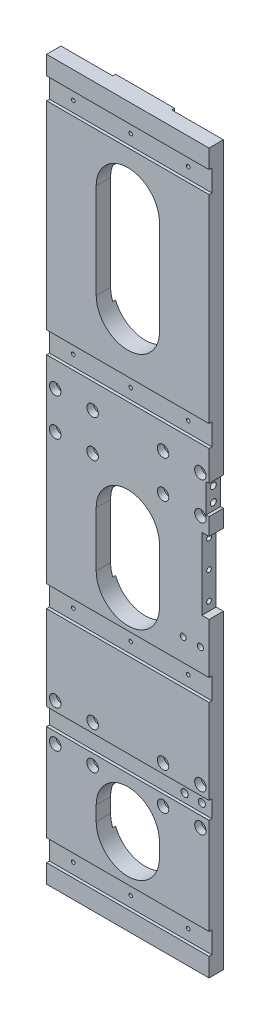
ISO-10303-21;
HEADER;
FILE_DESCRIPTION(('STEP AP214'),'2;1');
FILE_NAME('part.step','',(''),(''),'','','');
FILE_SCHEMA(('AUTOMOTIVE_DESIGN { 1 0 10303 214 1 1 1 1 }'));
ENDSEC;
DATA;
#1=APPLICATION_CONTEXT('core data for automotive mechanical design processes');
#2=APPLICATION_PROTOCOL_DEFINITION('international standard','automotive_design',2000,#1);
#3=PRODUCT_CONTEXT('',#1,'mechanical');
#4=PRODUCT('Part','Part','',(#3));
#5=PRODUCT_RELATED_PRODUCT_CATEGORY('part','',(#4));
#6=PRODUCT_DEFINITION_FORMATION('','',#4);
#7=PRODUCT_DEFINITION_CONTEXT('part definition',#1,'design');
#8=PRODUCT_DEFINITION('design','',#6,#7);
#9=PRODUCT_DEFINITION_SHAPE('','',#8);
#10=(LENGTH_UNIT() NAMED_UNIT(*) SI_UNIT(.MILLI.,.METRE.));
#11=(NAMED_UNIT(*) PLANE_ANGLE_UNIT() SI_UNIT($,.RADIAN.));
#12=(NAMED_UNIT(*) SI_UNIT($,.STERADIAN.) SOLID_ANGLE_UNIT());
#13=UNCERTAINTY_MEASURE_WITH_UNIT(LENGTH_MEASURE(1.E-05),#10,'distance_accuracy_value','');
#14=(GEOMETRIC_REPRESENTATION_CONTEXT(3) GLOBAL_UNCERTAINTY_ASSIGNED_CONTEXT((#13)) GLOBAL_UNIT_ASSIGNED_CONTEXT((#10,
#11,#12)) REPRESENTATION_CONTEXT('',''));
#15=CARTESIAN_POINT('',(0.,0.,0.));
#16=DIRECTION('',(0.,0.,1.));
#17=DIRECTION('',(1.,0.,0.));
#18=AXIS2_PLACEMENT_3D('',#15,#16,#17);
#19=CARTESIAN_POINT('',(0.,0.,0.));
#20=DIRECTION('',(0.,0.,-1.));
#21=DIRECTION('',(-1.,0.,0.));
#22=AXIS2_PLACEMENT_3D('',#19,#20,#21);
#23=PLANE('',#22);
#24=DIRECTION('',(-1.,0.,0.));
#25=VECTOR('',#24,1.);
#26=CARTESIAN_POINT('',(-19.0830612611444,50.,0.));
#27=LINE('',#26,#25);
#28=CARTESIAN_POINT('',(57.9169387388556,50.,0.));
#29=VERTEX_POINT('',#28);
#30=CARTESIAN_POINT('',(16.9169387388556,50.,0.));
#31=VERTEX_POINT('',#30);
#32=EDGE_CURVE('E423',#29,#31,#27,.T.);
#33=ORIENTED_EDGE('',*,*,#32,.T.);
#34=DIRECTION('',(0.,1.,0.));
#35=VECTOR('',#34,1.);
#36=CARTESIAN_POINT('',(16.9169387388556,0.,0.));
#37=LINE('',#36,#35);
#38=CARTESIAN_POINT('',(16.9169387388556,97.0156402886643,0.));
#39=VERTEX_POINT('',#38);
#40=EDGE_CURVE('E930',#31,#39,#37,.T.);
#41=ORIENTED_EDGE('',*,*,#40,.T.);
#42=CARTESIAN_POINT('',(37.4169387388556,105.,0.));
#43=DIRECTION('',(0.,0.,1.));
#44=DIRECTION('',(1.,0.,0.));
#45=AXIS2_PLACEMENT_3D('',#42,#43,#44);
#46=CIRCLE('',#45,22.);
#47=CARTESIAN_POINT('',(57.9169387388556,97.0156402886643,0.));
#48=VERTEX_POINT('',#47);
#49=EDGE_CURVE('E1540',#39,#48,#46,.T.);
#50=ORIENTED_EDGE('',*,*,#49,.T.);
#51=DIRECTION('',(0.,1.,0.));
#52=VECTOR('',#51,1.);
#53=CARTESIAN_POINT('',(57.9169387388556,0.,0.));
#54=LINE('',#53,#52);
#55=EDGE_CURVE('E926',#29,#48,#54,.T.);
#56=ORIENTED_EDGE('',*,*,#55,.F.);
#57=EDGE_LOOP('',(#33,#41,#50,#56));
#58=FACE_BOUND('',#57,.T.);
#59=CARTESIAN_POINT('',(37.4169387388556,70.5,0.));
#60=DIRECTION('',(0.,0.,1.));
#61=DIRECTION('',(1.,0.,0.));
#62=AXIS2_PLACEMENT_3D('',#59,#60,#61);
#63=CIRCLE('',#62,1.25);
#64=CARTESIAN_POINT('',(38.6669387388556,70.5,0.));
#65=VERTEX_POINT('',#64);
#66=EDGE_CURVE('E556',#65,#65,#63,.T.);
#67=ORIENTED_EDGE('',*,*,#66,.T.);
#68=EDGE_LOOP('',(#67));
#69=FACE_BOUND('',#68,.T.);
#70=ADVANCED_FACE('F16',(#58,#69),#23,.T.);
#71=CARTESIAN_POINT('',(16.9169387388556,0.,0.));
#72=DIRECTION('',(1.,0.,0.));
#73=DIRECTION('',(0.,0.,-1.));
#74=AXIS2_PLACEMENT_3D('',#71,#72,#73);
#75=PLANE('',#74);
#76=ORIENTED_EDGE('',*,*,#40,.F.);
#77=DIRECTION('',(0.,0.,1.));
#78=VECTOR('',#77,1.);
#79=CARTESIAN_POINT('',(16.9169387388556,50.,0.));
#80=LINE('',#79,#78);
#81=CARTESIAN_POINT('',(16.9169387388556,50.,2.));
#82=VERTEX_POINT('',#81);
#83=EDGE_CURVE('E1622',#31,#82,#80,.T.);
#84=ORIENTED_EDGE('',*,*,#83,.T.);
#85=DIRECTION('',(0.,1.,0.));
#86=VECTOR('',#85,1.);
#87=CARTESIAN_POINT('',(16.9169387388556,0.,2.));
#88=LINE('',#87,#86);
#89=CARTESIAN_POINT('',(16.9169387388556,97.0156402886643,2.));
#90=VERTEX_POINT('',#89);
#91=EDGE_CURVE('E934',#82,#90,#88,.T.);
#92=ORIENTED_EDGE('',*,*,#91,.T.);
#93=DIRECTION('',(0.,0.,1.));
#94=VECTOR('',#93,1.);
#95=CARTESIAN_POINT('',(16.9169387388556,97.0156402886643,0.));
#96=LINE('',#95,#94);
#97=EDGE_CURVE('E1577',#90,#39,#96,.F.);
#98=ORIENTED_EDGE('',*,*,#97,.T.);
#99=EDGE_LOOP('',(#76,#84,#92,#98));
#100=FACE_BOUND('',#99,.T.);
#101=ADVANCED_FACE('F1216',(#100),#75,.F.);
#102=CARTESIAN_POINT('',(57.9169387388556,0.,0.));
#103=DIRECTION('',(-1.,0.,0.));
#104=DIRECTION('',(0.,0.,1.));
#105=AXIS2_PLACEMENT_3D('',#102,#103,#104);
#106=PLANE('',#105);
#107=DIRECTION('',(0.,1.,0.));
#108=VECTOR('',#107,1.);
#109=CARTESIAN_POINT('',(57.9169387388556,0.,2.));
#110=LINE('',#109,#108);
#111=CARTESIAN_POINT('',(57.9169387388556,50.,2.));
#112=VERTEX_POINT('',#111);
#113=CARTESIAN_POINT('',(57.9169387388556,97.0156402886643,2.));
#114=VERTEX_POINT('',#113);
#115=EDGE_CURVE('E922',#112,#114,#110,.T.);
#116=ORIENTED_EDGE('',*,*,#115,.F.);
#117=DIRECTION('',(0.,0.,-1.));
#118=VECTOR('',#117,1.);
#119=CARTESIAN_POINT('',(57.9169387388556,50.,0.));
#120=LINE('',#119,#118);
#121=EDGE_CURVE('E31',#112,#29,#120,.T.);
#122=ORIENTED_EDGE('',*,*,#121,.T.);
#123=ORIENTED_EDGE('',*,*,#55,.T.);
#124=DIRECTION('',(0.,0.,1.));
#125=VECTOR('',#124,1.);
#126=CARTESIAN_POINT('',(57.9169387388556,97.0156402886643,0.));
#127=LINE('',#126,#125);
#128=EDGE_CURVE('E1571',#48,#114,#127,.T.);
#129=ORIENTED_EDGE('',*,*,#128,.T.);
#130=EDGE_LOOP('',(#116,#122,#123,#129));
#131=FACE_BOUND('',#130,.T.);
#132=ADVANCED_FACE('F1225',(#131),#106,.F.);
#133=CARTESIAN_POINT('',(37.4169387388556,115.,0.));
#134=DIRECTION('',(0.,0.,1.));
#135=DIRECTION('',(1.,0.,0.));
#136=AXIS2_PLACEMENT_3D('',#133,#134,#135);
#137=CIRCLE('',#136,22.);
#138=CARTESIAN_POINT('',(57.9169387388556,122.984359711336,0.));
#139=VERTEX_POINT('',#138);
#140=CARTESIAN_POINT('',(16.9169387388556,122.984359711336,0.));
#141=VERTEX_POINT('',#140);
#142=EDGE_CURVE('E1543',#139,#141,#137,.T.);
#143=ORIENTED_EDGE('',*,*,#142,.T.);
#144=CARTESIAN_POINT('',(16.9169387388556,248.015640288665,0.));
#145=VERTEX_POINT('',#144);
#146=EDGE_CURVE('E932',#141,#145,#37,.T.);
#147=ORIENTED_EDGE('',*,*,#146,.T.);
#148=CARTESIAN_POINT('',(37.4169387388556,256.,0.));
#149=DIRECTION('',(0.,0.,1.));
#150=DIRECTION('',(1.,0.,0.));
#151=AXIS2_PLACEMENT_3D('',#148,#149,#150);
#152=CIRCLE('',#151,22.);
#153=CARTESIAN_POINT('',(57.9169387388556,248.015640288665,0.));
#154=VERTEX_POINT('',#153);
#155=EDGE_CURVE('E972',#145,#154,#152,.T.);
#156=ORIENTED_EDGE('',*,*,#155,.T.);
#157=EDGE_CURVE('E928',#139,#154,#54,.T.);
#158=ORIENTED_EDGE('',*,*,#157,.F.);
#159=EDGE_LOOP('',(#143,#147,#156,#158));
#160=FACE_BOUND('',#159,.T.);
#161=CARTESIAN_POINT('',(37.4169387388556,223.5,0.));
#162=DIRECTION('',(0.,0.,1.));
#163=DIRECTION('',(1.,0.,0.));
#164=AXIS2_PLACEMENT_3D('',#161,#162,#163);
#165=CIRCLE('',#164,1.25);
#166=CARTESIAN_POINT('',(38.6669387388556,223.5,0.));
#167=VERTEX_POINT('',#166);
#168=EDGE_CURVE('E574',#167,#167,#165,.T.);
#169=ORIENTED_EDGE('',*,*,#168,.T.);
#170=EDGE_LOOP('',(#169));
#171=FACE_BOUND('',#170,.T.);
#172=ADVANCED_FACE('F1219',(#160,#171),#23,.T.);
#173=ORIENTED_EDGE('',*,*,#146,.F.);
#174=DIRECTION('',(0.,0.,1.));
#175=VECTOR('',#174,1.);
#176=CARTESIAN_POINT('',(16.9169387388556,122.984359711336,0.));
#177=LINE('',#176,#175);
#178=CARTESIAN_POINT('',(16.9169387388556,122.984359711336,2.));
#179=VERTEX_POINT('',#178);
#180=EDGE_CURVE('E962',#141,#179,#177,.T.);
#181=ORIENTED_EDGE('',*,*,#180,.T.);
#182=CARTESIAN_POINT('',(16.9169387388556,248.015640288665,2.));
#183=VERTEX_POINT('',#182);
#184=EDGE_CURVE('E936',#179,#183,#88,.T.);
#185=ORIENTED_EDGE('',*,*,#184,.T.);
#186=DIRECTION('',(0.,0.,1.));
#187=VECTOR('',#186,1.);
#188=CARTESIAN_POINT('',(16.9169387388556,248.015640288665,0.));
#189=LINE('',#188,#187);
#190=EDGE_CURVE('E961',#183,#145,#189,.F.);
#191=ORIENTED_EDGE('',*,*,#190,.T.);
#192=EDGE_LOOP('',(#173,#181,#185,#191));
#193=FACE_BOUND('',#192,.T.);
#194=ADVANCED_FACE('F960',(#193),#75,.F.);
#195=CARTESIAN_POINT('',(57.9169387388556,122.984359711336,2.));
#196=VERTEX_POINT('',#195);
#197=CARTESIAN_POINT('',(57.9169387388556,248.015640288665,2.));
#198=VERTEX_POINT('',#197);
#199=EDGE_CURVE('E924',#196,#198,#110,.T.);
#200=ORIENTED_EDGE('',*,*,#199,.F.);
#201=DIRECTION('',(0.,0.,1.));
#202=VECTOR('',#201,1.);
#203=CARTESIAN_POINT('',(57.9169387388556,122.984359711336,0.));
#204=LINE('',#203,#202);
#205=EDGE_CURVE('E1559',#196,#139,#204,.F.);
#206=ORIENTED_EDGE('',*,*,#205,.T.);
#207=ORIENTED_EDGE('',*,*,#157,.T.);
#208=DIRECTION('',(0.,0.,1.));
#209=VECTOR('',#208,1.);
#210=CARTESIAN_POINT('',(57.9169387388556,248.015640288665,0.));
#211=LINE('',#210,#209);
#212=EDGE_CURVE('E1092',#154,#198,#211,.T.);
#213=ORIENTED_EDGE('',*,*,#212,.T.);
#214=EDGE_LOOP('',(#200,#206,#207,#213));
#215=FACE_BOUND('',#214,.T.);
#216=ADVANCED_FACE('F1246',(#215),#106,.F.);
#217=DIRECTION('',(1.,0.,0.));
#218=VECTOR('',#217,1.);
#219=CARTESIAN_POINT('',(-19.0830612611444,550.,0.));
#220=LINE('',#219,#218);
#221=CARTESIAN_POINT('',(16.9169387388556,550.,0.));
#222=VERTEX_POINT('',#221);
#223=CARTESIAN_POINT('',(57.9169387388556,550.,0.));
#224=VERTEX_POINT('',#223);
#225=EDGE_CURVE('E1260',#222,#224,#220,.T.);
#226=ORIENTED_EDGE('',*,*,#225,.T.);
#227=CARTESIAN_POINT('',(57.9169387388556,495.984359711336,0.));
#228=VERTEX_POINT('',#227);
#229=EDGE_CURVE('E929',#228,#224,#54,.T.);
#230=ORIENTED_EDGE('',*,*,#229,.F.);
#231=CARTESIAN_POINT('',(37.4169387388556,488.,0.));
#232=DIRECTION('',(0.,0.,1.));
#233=DIRECTION('',(1.,0.,0.));
#234=AXIS2_PLACEMENT_3D('',#231,#232,#233);
#235=CIRCLE('',#234,22.);
#236=CARTESIAN_POINT('',(16.9169387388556,495.984359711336,0.));
#237=VERTEX_POINT('',#236);
#238=EDGE_CURVE('E988',#228,#237,#235,.T.);
#239=ORIENTED_EDGE('',*,*,#238,.T.);
#240=EDGE_CURVE('E933',#237,#222,#37,.T.);
#241=ORIENTED_EDGE('',*,*,#240,.T.);
#242=EDGE_LOOP('',(#226,#230,#239,#241));
#243=FACE_BOUND('',#242,.T.);
#244=CARTESIAN_POINT('',(37.4169387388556,529.5,0.));
#245=DIRECTION('',(0.,0.,1.));
#246=DIRECTION('',(1.,0.,0.));
#247=AXIS2_PLACEMENT_3D('',#244,#245,#246);
#248=CIRCLE('',#247,1.25);
#249=CARTESIAN_POINT('',(38.6669387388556,529.5,0.));
#250=VERTEX_POINT('',#249);
#251=EDGE_CURVE('E610',#250,#250,#248,.T.);
#252=ORIENTED_EDGE('',*,*,#251,.T.);
#253=EDGE_LOOP('',(#252));
#254=FACE_BOUND('',#253,.T.);
#255=ADVANCED_FACE('F1234',(#243,#254),#23,.T.);
#256=CARTESIAN_POINT('',(16.9169387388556,495.984359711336,2.));
#257=VERTEX_POINT('',#256);
#258=CARTESIAN_POINT('',(16.9169387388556,550.,2.));
#259=VERTEX_POINT('',#258);
#260=EDGE_CURVE('E937',#257,#259,#88,.T.);
#261=ORIENTED_EDGE('',*,*,#260,.T.);
#262=DIRECTION('',(0.,0.,-1.));
#263=VECTOR('',#262,1.);
#264=CARTESIAN_POINT('',(16.9169387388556,550.,0.));
#265=LINE('',#264,#263);
#266=EDGE_CURVE('E1532',#259,#222,#265,.T.);
#267=ORIENTED_EDGE('',*,*,#266,.T.);
#268=ORIENTED_EDGE('',*,*,#240,.F.);
#269=DIRECTION('',(0.,0.,1.));
#270=VECTOR('',#269,1.);
#271=CARTESIAN_POINT('',(16.9169387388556,495.984359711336,0.));
#272=LINE('',#271,#270);
#273=EDGE_CURVE('E1027',#237,#257,#272,.T.);
#274=ORIENTED_EDGE('',*,*,#273,.T.);
#275=EDGE_LOOP('',(#261,#267,#268,#274));
#276=FACE_BOUND('',#275,.T.);
#277=ADVANCED_FACE('F1242',(#276),#75,.F.);
#278=ORIENTED_EDGE('',*,*,#229,.T.);
#279=DIRECTION('',(0.,0.,1.));
#280=VECTOR('',#279,1.);
#281=CARTESIAN_POINT('',(57.9169387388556,550.,0.));
#282=LINE('',#281,#280);
#283=CARTESIAN_POINT('',(57.9169387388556,550.,2.));
#284=VERTEX_POINT('',#283);
#285=EDGE_CURVE('E1533',#224,#284,#282,.T.);
#286=ORIENTED_EDGE('',*,*,#285,.T.);
#287=CARTESIAN_POINT('',(57.9169387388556,495.984359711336,2.));
#288=VERTEX_POINT('',#287);
#289=EDGE_CURVE('E925',#288,#284,#110,.T.);
#290=ORIENTED_EDGE('',*,*,#289,.F.);
#291=DIRECTION('',(0.,0.,1.));
#292=VECTOR('',#291,1.);
#293=CARTESIAN_POINT('',(57.9169387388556,495.984359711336,0.));
#294=LINE('',#293,#292);
#295=EDGE_CURVE('E1080',#288,#228,#294,.F.);
#296=ORIENTED_EDGE('',*,*,#295,.T.);
#297=EDGE_LOOP('',(#278,#286,#290,#296));
#298=FACE_BOUND('',#297,.T.);
#299=ADVANCED_FACE('F1253',(#298),#106,.F.);
#300=CARTESIAN_POINT('',(93.9169387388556,0.,12.));
#301=DIRECTION('',(-1.,0.,0.));
#302=DIRECTION('',(0.,0.,1.));
#303=AXIS2_PLACEMENT_3D('',#300,#301,#302);
#304=PLANE('',#303);
#305=DIRECTION('',(0.,1.,0.));
#306=VECTOR('',#305,1.);
#307=CARTESIAN_POINT('',(93.9169387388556,0.,2.));
#308=LINE('',#307,#306);
#309=CARTESIAN_POINT('',(93.9169387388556,316.,2.));
#310=VERTEX_POINT('',#309);
#311=CARTESIAN_POINT('',(93.9169387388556,328.,2.));
#312=VERTEX_POINT('',#311);
#313=EDGE_CURVE('E492',#310,#312,#308,.T.);
#314=ORIENTED_EDGE('',*,*,#313,.T.);
#315=DIRECTION('',(0.,0.,1.));
#316=VECTOR('',#315,1.);
#317=CARTESIAN_POINT('',(93.9169387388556,328.,0.));
#318=LINE('',#317,#316);
#319=CARTESIAN_POINT('',(93.9169387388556,328.,12.));
#320=VERTEX_POINT('',#319);
#321=EDGE_CURVE('E491',#312,#320,#318,.T.);
#322=ORIENTED_EDGE('',*,*,#321,.T.);
#323=DIRECTION('',(0.,1.,0.));
#324=VECTOR('',#323,1.);
#325=CARTESIAN_POINT('',(93.9169387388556,0.,12.));
#326=LINE('',#325,#324);
#327=CARTESIAN_POINT('',(93.9169387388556,316.,12.));
#328=VERTEX_POINT('',#327);
#329=EDGE_CURVE('E452',#328,#320,#326,.T.);
#330=ORIENTED_EDGE('',*,*,#329,.F.);
#331=DIRECTION('',(0.,0.,1.));
#332=VECTOR('',#331,1.);
#333=CARTESIAN_POINT('',(93.9169387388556,316.,0.));
#334=LINE('',#333,#332);
#335=EDGE_CURVE('E489',#310,#328,#334,.T.);
#336=ORIENTED_EDGE('',*,*,#335,.F.);
#337=EDGE_LOOP('',(#314,#322,#330,#336));
#338=FACE_BOUND('',#337,.T.);
#339=ADVANCED_FACE('F488',(#338),#304,.F.);
#340=CARTESIAN_POINT('',(0.,0.,12.));
#341=DIRECTION('',(0.,0.,-1.));
#342=DIRECTION('',(-1.,0.,0.));
#343=AXIS2_PLACEMENT_3D('',#340,#341,#342);
#344=PLANE('',#343);
#345=DIRECTION('',(0.,1.,0.));
#346=VECTOR('',#345,1.);
#347=CARTESIAN_POINT('',(59.4169387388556,256.,12.));
#348=LINE('',#347,#346);
#349=CARTESIAN_POINT('',(59.4169387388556,256.,12.));
#350=VERTEX_POINT('',#349);
#351=CARTESIAN_POINT('',(59.4169387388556,294.,12.));
#352=VERTEX_POINT('',#351);
#353=EDGE_CURVE('E1587',#350,#352,#348,.T.);
#354=ORIENTED_EDGE('',*,*,#353,.F.);
#355=CARTESIAN_POINT('',(37.4169387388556,256.,12.));
#356=DIRECTION('',(0.,0.,1.));
#357=DIRECTION('',(1.,0.,0.));
#358=AXIS2_PLACEMENT_3D('',#355,#356,#357);
#359=CIRCLE('',#358,22.);
#360=CARTESIAN_POINT('',(15.4169387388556,256.,12.));
#361=VERTEX_POINT('',#360);
#362=EDGE_CURVE('E1580',#361,#350,#359,.T.);
#363=ORIENTED_EDGE('',*,*,#362,.F.);
#364=DIRECTION('',(0.,-1.,0.));
#365=VECTOR('',#364,1.);
#366=CARTESIAN_POINT('',(15.4169387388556,256.,12.));
#367=LINE('',#366,#365);
#368=CARTESIAN_POINT('',(15.4169387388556,294.,12.));
#369=VERTEX_POINT('',#368);
#370=EDGE_CURVE('E1583',#369,#361,#367,.T.);
#371=ORIENTED_EDGE('',*,*,#370,.F.);
#372=CARTESIAN_POINT('',(37.4169387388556,294.,12.));
#373=DIRECTION('',(0.,0.,1.));
#374=DIRECTION('',(1.,0.,0.));
#375=AXIS2_PLACEMENT_3D('',#372,#373,#374);
#376=CIRCLE('',#375,22.);
#377=EDGE_CURVE('E1590',#352,#369,#376,.T.);
#378=ORIENTED_EDGE('',*,*,#377,.F.);
#379=EDGE_LOOP('',(#354,#363,#371,#378));
#380=FACE_BOUND('',#379,.T.);
#381=CARTESIAN_POINT('',(87.9169387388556,246.5,12.));
#382=DIRECTION('',(0.,0.,1.));
#383=DIRECTION('',(1.,0.,0.));
#384=AXIS2_PLACEMENT_3D('',#381,#382,#383);
#385=CIRCLE('',#384,2.1);
#386=CARTESIAN_POINT('',(90.0169387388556,246.5,12.));
#387=VERTEX_POINT('',#386);
#388=EDGE_CURVE('E523',#387,#387,#385,.T.);
#389=ORIENTED_EDGE('',*,*,#388,.F.);
#390=EDGE_LOOP('',(#389));
#391=FACE_BOUND('',#390,.T.);
#392=CARTESIAN_POINT('',(12.9169387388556,351.5,12.));
#393=DIRECTION('',(0.,0.,1.));
#394=DIRECTION('',(1.,0.,0.));
#395=AXIS2_PLACEMENT_3D('',#392,#393,#394);
#396=CIRCLE('',#395,4.);
#397=CARTESIAN_POINT('',(16.9169387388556,351.5,12.));
#398=VERTEX_POINT('',#397);
#399=EDGE_CURVE('E752',#398,#398,#396,.T.);
#400=ORIENTED_EDGE('',*,*,#399,.F.);
#401=EDGE_LOOP('',(#400));
#402=FACE_BOUND('',#401,.T.);
#403=CARTESIAN_POINT('',(-13.0830612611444,351.5,12.));
#404=DIRECTION('',(0.,0.,1.));
#405=DIRECTION('',(1.,0.,0.));
#406=AXIS2_PLACEMENT_3D('',#403,#404,#405);
#407=CIRCLE('',#406,4.);
#408=CARTESIAN_POINT('',(-9.08306126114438,351.5,12.));
#409=VERTEX_POINT('',#408);
#410=EDGE_CURVE('E768',#409,#409,#407,.T.);
#411=ORIENTED_EDGE('',*,*,#410,.F.);
#412=EDGE_LOOP('',(#411));
#413=FACE_BOUND('',#412,.T.);
#414=CARTESIAN_POINT('',(-13.0830612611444,325.5,12.));
#415=DIRECTION('',(0.,0.,1.));
#416=DIRECTION('',(1.,0.,0.));
#417=AXIS2_PLACEMENT_3D('',#414,#415,#416);
#418=CIRCLE('',#417,4.);
#419=CARTESIAN_POINT('',(-9.08306126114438,325.5,12.));
#420=VERTEX_POINT('',#419);
#421=EDGE_CURVE('E778',#420,#420,#418,.T.);
#422=ORIENTED_EDGE('',*,*,#421,.F.);
#423=EDGE_LOOP('',(#422));
#424=FACE_BOUND('',#423,.T.);
#425=CARTESIAN_POINT('',(12.9169387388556,325.5,12.));
#426=DIRECTION('',(0.,0.,1.));
#427=DIRECTION('',(1.,0.,0.));
#428=AXIS2_PLACEMENT_3D('',#425,#426,#427);
#429=CIRCLE('',#428,4.);
#430=CARTESIAN_POINT('',(16.9169387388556,325.5,12.));
#431=VERTEX_POINT('',#430);
#432=EDGE_CURVE('E788',#431,#431,#429,.T.);
#433=ORIENTED_EDGE('',*,*,#432,.F.);
#434=EDGE_LOOP('',(#433));
#435=FACE_BOUND('',#434,.T.);
#436=CARTESIAN_POINT('',(87.9169387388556,351.5,12.));
#437=DIRECTION('',(0.,0.,1.));
#438=DIRECTION('',(1.,0.,0.));
#439=AXIS2_PLACEMENT_3D('',#436,#437,#438);
#440=CIRCLE('',#439,4.);
#441=CARTESIAN_POINT('',(91.9169387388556,351.5,12.));
#442=VERTEX_POINT('',#441);
#443=EDGE_CURVE('E838',#442,#442,#440,.T.);
#444=ORIENTED_EDGE('',*,*,#443,.F.);
#445=EDGE_LOOP('',(#444));
#446=FACE_BOUND('',#445,.T.);
#447=CARTESIAN_POINT('',(61.9169387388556,351.5,12.));
#448=DIRECTION('',(0.,0.,1.));
#449=DIRECTION('',(1.,0.,0.));
#450=AXIS2_PLACEMENT_3D('',#447,#448,#449);
#451=CIRCLE('',#450,4.);
#452=CARTESIAN_POINT('',(65.9169387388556,351.5,12.));
#453=VERTEX_POINT('',#452);
#454=EDGE_CURVE('E848',#453,#453,#451,.T.);
#455=ORIENTED_EDGE('',*,*,#454,.F.);
#456=EDGE_LOOP('',(#455));
#457=FACE_BOUND('',#456,.T.);
#458=CARTESIAN_POINT('',(61.9169387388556,325.5,12.));
#459=DIRECTION('',(0.,0.,1.));
#460=DIRECTION('',(1.,0.,0.));
#461=AXIS2_PLACEMENT_3D('',#458,#459,#460);
#462=CIRCLE('',#461,4.);
#463=CARTESIAN_POINT('',(65.9169387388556,325.5,12.));
#464=VERTEX_POINT('',#463);
#465=EDGE_CURVE('E858',#464,#464,#462,.T.);
#466=ORIENTED_EDGE('',*,*,#465,.F.);
#467=EDGE_LOOP('',(#466));
#468=FACE_BOUND('',#467,.T.);
#469=CARTESIAN_POINT('',(87.9169387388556,325.5,12.));
#470=DIRECTION('',(0.,0.,1.));
#471=DIRECTION('',(1.,0.,0.));
#472=AXIS2_PLACEMENT_3D('',#469,#470,#471);
#473=CIRCLE('',#472,4.);
#474=CARTESIAN_POINT('',(91.9169387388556,325.5,12.));
#475=VERTEX_POINT('',#474);
#476=EDGE_CURVE('E868',#475,#475,#473,.T.);
#477=ORIENTED_EDGE('',*,*,#476,.F.);
#478=EDGE_LOOP('',(#477));
#479=FACE_BOUND('',#478,.T.);
#480=ORIENTED_EDGE('',*,*,#329,.T.);
#481=DIRECTION('',(1.,0.,0.));
#482=VECTOR('',#481,1.);
#483=CARTESIAN_POINT('',(93.9169387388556,328.,12.));
#484=LINE('',#483,#482);
#485=CARTESIAN_POINT('',(91.9169387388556,328.,12.));
#486=VERTEX_POINT('',#485);
#487=EDGE_CURVE('E480',#486,#320,#484,.T.);
#488=ORIENTED_EDGE('',*,*,#487,.F.);
#489=DIRECTION('',(0.,-1.,0.));
#490=VECTOR('',#489,1.);
#491=CARTESIAN_POINT('',(91.9169387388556,328.,12.));
#492=LINE('',#491,#490);
#493=CARTESIAN_POINT('',(91.9169387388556,348.,12.));
#494=VERTEX_POINT('',#493);
#495=EDGE_CURVE('E1055',#494,#486,#492,.T.);
#496=ORIENTED_EDGE('',*,*,#495,.F.);
#497=DIRECTION('',(-1.,0.,0.));
#498=VECTOR('',#497,1.);
#499=CARTESIAN_POINT('',(93.9169387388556,348.,12.));
#500=LINE('',#499,#498);
#501=CARTESIAN_POINT('',(93.9169387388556,348.,12.));
#502=VERTEX_POINT('',#501);
#503=EDGE_CURVE('E1053',#502,#494,#500,.T.);
#504=ORIENTED_EDGE('',*,*,#503,.F.);
#505=CARTESIAN_POINT('',(93.9169387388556,369.,12.));
#506=VERTEX_POINT('',#505);
#507=EDGE_CURVE('E442',#502,#506,#326,.T.);
#508=ORIENTED_EDGE('',*,*,#507,.T.);
#509=DIRECTION('',(1.,0.,0.));
#510=VECTOR('',#509,1.);
#511=CARTESIAN_POINT('',(-19.0830612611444,369.,12.));
#512=LINE('',#511,#510);
#513=CARTESIAN_POINT('',(-19.0830612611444,369.,12.));
#514=VERTEX_POINT('',#513);
#515=EDGE_CURVE('E743',#514,#506,#512,.T.);
#516=ORIENTED_EDGE('',*,*,#515,.F.);
#517=DIRECTION('',(0.,-1.,0.));
#518=VECTOR('',#517,1.);
#519=CARTESIAN_POINT('',(-19.0830612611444,0.,12.));
#520=LINE('',#519,#518);
#521=CARTESIAN_POINT('',(-19.0830612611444,231.,12.));
#522=VERTEX_POINT('',#521);
#523=EDGE_CURVE('E467',#514,#522,#520,.T.);
#524=ORIENTED_EDGE('',*,*,#523,.T.);
#525=DIRECTION('',(1.,0.,0.));
#526=VECTOR('',#525,1.);
#527=CARTESIAN_POINT('',(-19.0830612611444,231.,12.));
#528=LINE('',#527,#526);
#529=CARTESIAN_POINT('',(93.9169387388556,231.,12.));
#530=VERTEX_POINT('',#529);
#531=EDGE_CURVE('E702',#522,#530,#528,.T.);
#532=ORIENTED_EDGE('',*,*,#531,.T.);
#533=CARTESIAN_POINT('',(93.9169387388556,266.,12.));
#534=VERTEX_POINT('',#533);
#535=EDGE_CURVE('E449',#530,#534,#326,.T.);
#536=ORIENTED_EDGE('',*,*,#535,.T.);
#537=DIRECTION('',(1.,0.,0.));
#538=VECTOR('',#537,1.);
#539=CARTESIAN_POINT('',(93.9169387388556,266.,12.));
#540=LINE('',#539,#538);
#541=CARTESIAN_POINT('',(88.9169387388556,266.,12.));
#542=VERTEX_POINT('',#541);
#543=EDGE_CURVE('E621',#542,#534,#540,.T.);
#544=ORIENTED_EDGE('',*,*,#543,.F.);
#545=DIRECTION('',(0.,-1.,0.));
#546=VECTOR('',#545,1.);
#547=CARTESIAN_POINT('',(88.9169387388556,266.,12.));
#548=LINE('',#547,#546);
#549=CARTESIAN_POINT('',(88.9169387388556,316.,12.));
#550=VERTEX_POINT('',#549);
#551=EDGE_CURVE('E618',#550,#542,#548,.T.);
#552=ORIENTED_EDGE('',*,*,#551,.F.);
#553=DIRECTION('',(-1.,0.,0.));
#554=VECTOR('',#553,1.);
#555=CARTESIAN_POINT('',(93.9169387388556,316.,12.));
#556=LINE('',#555,#554);
#557=EDGE_CURVE('E483',#328,#550,#556,.T.);
#558=ORIENTED_EDGE('',*,*,#557,.F.);
#559=EDGE_LOOP('',(#480,#488,#496,#504,#508,#516,#524,#532,#536,#544,#552,#558));
#560=FACE_BOUND('',#559,.T.);
#561=CARTESIAN_POINT('',(75.9169387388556,246.5,12.));
#562=DIRECTION('',(0.,0.,1.));
#563=DIRECTION('',(1.,0.,0.));
#564=AXIS2_PLACEMENT_3D('',#561,#562,#563);
#565=CIRCLE('',#564,2.1);
#566=CARTESIAN_POINT('',(78.0169387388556,246.5,12.));
#567=VERTEX_POINT('',#566);
#568=EDGE_CURVE('E527',#567,#567,#565,.T.);
#569=ORIENTED_EDGE('',*,*,#568,.F.);
#570=EDGE_LOOP('',(#569));
#571=FACE_BOUND('',#570,.T.);
#572=ADVANCED_FACE('F477',(#380,#391,#402,#413,#424,#435,#446,#457,#468,#479,#560,#571),#344,.F.);
#573=CARTESIAN_POINT('',(-19.0830612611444,78.,10.));
#574=DIRECTION('',(0.,0.,-1.));
#575=DIRECTION('',(-1.,0.,0.));
#576=AXIS2_PLACEMENT_3D('',#573,#574,#575);
#577=PLANE('',#576);
#578=CARTESIAN_POINT('',(-2.58306126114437,70.5,10.));
#579=DIRECTION('',(0.,0.,1.));
#580=DIRECTION('',(1.,0.,0.));
#581=AXIS2_PLACEMENT_3D('',#578,#579,#580);
#582=CIRCLE('',#581,1.25);
#583=CARTESIAN_POINT('',(-1.33306126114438,70.5,10.));
#584=VERTEX_POINT('',#583);
#585=EDGE_CURVE('E549',#584,#584,#582,.T.);
#586=ORIENTED_EDGE('',*,*,#585,.F.);
#587=EDGE_LOOP('',(#586));
#588=FACE_BOUND('',#587,.T.);
#589=CARTESIAN_POINT('',(37.4169387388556,70.5,10.));
#590=DIRECTION('',(0.,0.,1.));
#591=DIRECTION('',(1.,0.,0.));
#592=AXIS2_PLACEMENT_3D('',#589,#590,#591);
#593=CIRCLE('',#592,1.25);
#594=CARTESIAN_POINT('',(38.6669387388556,70.5,10.));
#595=VERTEX_POINT('',#594);
#596=EDGE_CURVE('E553',#595,#595,#593,.T.);
#597=ORIENTED_EDGE('',*,*,#596,.F.);
#598=EDGE_LOOP('',(#597));
#599=FACE_BOUND('',#598,.T.);
#600=DIRECTION('',(0.,1.,0.));
#601=VECTOR('',#600,1.);
#602=CARTESIAN_POINT('',(93.9169387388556,78.,10.));
#603=LINE('',#602,#601);
#604=CARTESIAN_POINT('',(93.9169387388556,63.,10.));
#605=VERTEX_POINT('',#604);
#606=CARTESIAN_POINT('',(93.9169387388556,78.,10.));
#607=VERTEX_POINT('',#606);
#608=EDGE_CURVE('E662',#605,#607,#603,.T.);
#609=ORIENTED_EDGE('',*,*,#608,.T.);
#610=DIRECTION('',(1.,0.,0.));
#611=VECTOR('',#610,1.);
#612=CARTESIAN_POINT('',(-19.0830612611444,78.,10.));
#613=LINE('',#612,#611);
#614=CARTESIAN_POINT('',(-19.0830612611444,78.,10.));
#615=VERTEX_POINT('',#614);
#616=EDGE_CURVE('E673',#615,#607,#613,.T.);
#617=ORIENTED_EDGE('',*,*,#616,.F.);
#618=DIRECTION('',(0.,1.,0.));
#619=VECTOR('',#618,1.);
#620=CARTESIAN_POINT('',(-19.0830612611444,78.,10.));
#621=LINE('',#620,#619);
#622=CARTESIAN_POINT('',(-19.0830612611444,63.,10.));
#623=VERTEX_POINT('',#622);
#624=EDGE_CURVE('E665',#623,#615,#621,.T.);
#625=ORIENTED_EDGE('',*,*,#624,.F.);
#626=DIRECTION('',(1.,0.,0.));
#627=VECTOR('',#626,1.);
#628=CARTESIAN_POINT('',(-19.0830612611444,63.,10.));
#629=LINE('',#628,#627);
#630=EDGE_CURVE('E676',#623,#605,#629,.T.);
#631=ORIENTED_EDGE('',*,*,#630,.T.);
#632=EDGE_LOOP('',(#609,#617,#625,#631));
#633=FACE_BOUND('',#632,.T.);
#634=CARTESIAN_POINT('',(77.4169387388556,70.5,10.));
#635=DIRECTION('',(0.,0.,1.));
#636=DIRECTION('',(1.,0.,0.));
#637=AXIS2_PLACEMENT_3D('',#634,#635,#636);
#638=CIRCLE('',#637,1.25);
#639=CARTESIAN_POINT('',(78.6669387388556,70.5,10.));
#640=VERTEX_POINT('',#639);
#641=EDGE_CURVE('E559',#640,#640,#638,.T.);
#642=ORIENTED_EDGE('',*,*,#641,.F.);
#643=EDGE_LOOP('',(#642));
#644=FACE_BOUND('',#643,.T.);
#645=ADVANCED_FACE('F1152',(#588,#599,#633,#644),#577,.F.);
#646=CARTESIAN_POINT('',(-19.0830612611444,522.,10.));
#647=DIRECTION('',(0.,0.,-1.));
#648=DIRECTION('',(-1.,0.,0.));
#649=AXIS2_PLACEMENT_3D('',#646,#647,#648);
#650=PLANE('',#649);
#651=CARTESIAN_POINT('',(-2.58306126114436,529.5,10.));
#652=DIRECTION('',(0.,0.,1.));
#653=DIRECTION('',(1.,0.,0.));
#654=AXIS2_PLACEMENT_3D('',#651,#652,#653);
#655=CIRCLE('',#654,1.25);
#656=CARTESIAN_POINT('',(-1.33306126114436,529.5,10.));
#657=VERTEX_POINT('',#656);
#658=EDGE_CURVE('E601',#657,#657,#655,.T.);
#659=ORIENTED_EDGE('',*,*,#658,.F.);
#660=EDGE_LOOP('',(#659));
#661=FACE_BOUND('',#660,.T.);
#662=CARTESIAN_POINT('',(77.4169387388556,529.5,10.));
#663=DIRECTION('',(0.,0.,1.));
#664=DIRECTION('',(1.,0.,0.));
#665=AXIS2_PLACEMENT_3D('',#662,#663,#664);
#666=CIRCLE('',#665,1.25);
#667=CARTESIAN_POINT('',(78.6669387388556,529.5,10.));
#668=VERTEX_POINT('',#667);
#669=EDGE_CURVE('E613',#668,#668,#666,.T.);
#670=ORIENTED_EDGE('',*,*,#669,.F.);
#671=EDGE_LOOP('',(#670));
#672=FACE_BOUND('',#671,.T.);
#673=DIRECTION('',(0.,1.,0.));
#674=VECTOR('',#673,1.);
#675=CARTESIAN_POINT('',(93.9169387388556,522.,10.));
#676=LINE('',#675,#674);
#677=CARTESIAN_POINT('',(93.9169387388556,522.,10.));
#678=VERTEX_POINT('',#677);
#679=CARTESIAN_POINT('',(93.9169387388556,537.,10.));
#680=VERTEX_POINT('',#679);
#681=EDGE_CURVE('E721',#678,#680,#676,.T.);
#682=ORIENTED_EDGE('',*,*,#681,.T.);
#683=DIRECTION('',(1.,0.,0.));
#684=VECTOR('',#683,1.);
#685=CARTESIAN_POINT('',(-19.0830612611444,537.,10.));
#686=LINE('',#685,#684);
#687=CARTESIAN_POINT('',(-19.0830612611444,537.,10.));
#688=VERTEX_POINT('',#687);
#689=EDGE_CURVE('E728',#688,#680,#686,.T.);
#690=ORIENTED_EDGE('',*,*,#689,.F.);
#691=DIRECTION('',(0.,1.,0.));
#692=VECTOR('',#691,1.);
#693=CARTESIAN_POINT('',(-19.0830612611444,522.,10.));
#694=LINE('',#693,#692);
#695=CARTESIAN_POINT('',(-19.0830612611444,522.,10.));
#696=VERTEX_POINT('',#695);
#697=EDGE_CURVE('E711',#696,#688,#694,.T.);
#698=ORIENTED_EDGE('',*,*,#697,.F.);
#699=DIRECTION('',(1.,0.,0.));
#700=VECTOR('',#699,1.);
#701=CARTESIAN_POINT('',(-19.0830612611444,522.,10.));
#702=LINE('',#701,#700);
#703=EDGE_CURVE('E730',#696,#678,#702,.T.);
#704=ORIENTED_EDGE('',*,*,#703,.T.);
#705=EDGE_LOOP('',(#682,#690,#698,#704));
#706=FACE_BOUND('',#705,.T.);
#707=CARTESIAN_POINT('',(37.4169387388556,529.5,10.));
#708=DIRECTION('',(0.,0.,1.));
#709=DIRECTION('',(1.,0.,0.));
#710=AXIS2_PLACEMENT_3D('',#707,#708,#709);
#711=CIRCLE('',#710,1.25);
#712=CARTESIAN_POINT('',(38.6669387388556,529.5,10.));
#713=VERTEX_POINT('',#712);
#714=EDGE_CURVE('E607',#713,#713,#711,.T.);
#715=ORIENTED_EDGE('',*,*,#714,.F.);
#716=EDGE_LOOP('',(#715));
#717=FACE_BOUND('',#716,.T.);
#718=ADVANCED_FACE('F1272',(#661,#672,#706,#717),#650,.F.);
#719=CARTESIAN_POINT('',(93.9169387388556,50.,12.));
#720=VERTEX_POINT('',#719);
#721=CARTESIAN_POINT('',(93.9169387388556,63.,12.));
#722=VERTEX_POINT('',#721);
#723=EDGE_CURVE('E429',#720,#722,#326,.T.);
#724=ORIENTED_EDGE('',*,*,#723,.F.);
#725=DIRECTION('',(0.,0.,1.));
#726=VECTOR('',#725,1.);
#727=CARTESIAN_POINT('',(93.9169387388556,50.,0.));
#728=LINE('',#727,#726);
#729=CARTESIAN_POINT('',(93.9169387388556,50.,2.));
#730=VERTEX_POINT('',#729);
#731=EDGE_CURVE('E414',#730,#720,#728,.T.);
#732=ORIENTED_EDGE('',*,*,#731,.F.);
#733=CARTESIAN_POINT('',(93.9169387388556,266.,2.));
#734=VERTEX_POINT('',#733);
#735=EDGE_CURVE('E918',#730,#734,#308,.T.);
#736=ORIENTED_EDGE('',*,*,#735,.T.);
#737=DIRECTION('',(0.,0.,1.));
#738=VECTOR('',#737,1.);
#739=CARTESIAN_POINT('',(93.9169387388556,266.,0.));
#740=LINE('',#739,#738);
#741=EDGE_CURVE('E623',#734,#534,#740,.T.);
#742=ORIENTED_EDGE('',*,*,#741,.T.);
#743=ORIENTED_EDGE('',*,*,#535,.F.);
#744=DIRECTION('',(0.,0.,1.));
#745=VECTOR('',#744,1.);
#746=CARTESIAN_POINT('',(93.9169387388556,231.,12.));
#747=LINE('',#746,#745);
#748=CARTESIAN_POINT('',(93.9169387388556,231.,10.));
#749=VERTEX_POINT('',#748);
#750=EDGE_CURVE('E686',#749,#530,#747,.T.);
#751=ORIENTED_EDGE('',*,*,#750,.F.);
#752=DIRECTION('',(0.,1.,0.));
#753=VECTOR('',#752,1.);
#754=CARTESIAN_POINT('',(93.9169387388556,216.,10.));
#755=LINE('',#754,#753);
#756=CARTESIAN_POINT('',(93.9169387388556,216.,10.));
#757=VERTEX_POINT('',#756);
#758=EDGE_CURVE('E694',#757,#749,#755,.T.);
#759=ORIENTED_EDGE('',*,*,#758,.F.);
#760=DIRECTION('',(0.,0.,-1.));
#761=VECTOR('',#760,1.);
#762=CARTESIAN_POINT('',(93.9169387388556,216.,12.));
#763=LINE('',#762,#761);
#764=CARTESIAN_POINT('',(93.9169387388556,216.,12.));
#765=VERTEX_POINT('',#764);
#766=EDGE_CURVE('E675',#765,#757,#763,.T.);
#767=ORIENTED_EDGE('',*,*,#766,.F.);
#768=CARTESIAN_POINT('',(93.9169387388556,157.,12.));
#769=VERTEX_POINT('',#768);
#770=EDGE_CURVE('E448',#769,#765,#326,.T.);
#771=ORIENTED_EDGE('',*,*,#770,.F.);
#772=DIRECTION('',(0.,0.,1.));
#773=VECTOR('',#772,1.);
#774=CARTESIAN_POINT('',(93.9169387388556,157.,12.));
#775=LINE('',#774,#773);
#776=CARTESIAN_POINT('',(93.9169387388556,157.,10.));
#777=VERTEX_POINT('',#776);
#778=EDGE_CURVE('E636',#777,#769,#775,.T.);
#779=ORIENTED_EDGE('',*,*,#778,.F.);
#780=DIRECTION('',(0.,1.,0.));
#781=VECTOR('',#780,1.);
#782=CARTESIAN_POINT('',(93.9169387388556,157.,10.));
#783=LINE('',#782,#781);
#784=CARTESIAN_POINT('',(93.9169387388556,145.,10.));
#785=VERTEX_POINT('',#784);
#786=EDGE_CURVE('E645',#785,#777,#783,.T.);
#787=ORIENTED_EDGE('',*,*,#786,.F.);
#788=DIRECTION('',(0.,0.,-1.));
#789=VECTOR('',#788,1.);
#790=CARTESIAN_POINT('',(93.9169387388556,145.,12.));
#791=LINE('',#790,#789);
#792=CARTESIAN_POINT('',(93.9169387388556,145.,12.));
#793=VERTEX_POINT('',#792);
#794=EDGE_CURVE('E626',#793,#785,#791,.T.);
#795=ORIENTED_EDGE('',*,*,#794,.F.);
#796=CARTESIAN_POINT('',(93.9169387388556,78.,12.));
#797=VERTEX_POINT('',#796);
#798=EDGE_CURVE('E440',#797,#793,#326,.T.);
#799=ORIENTED_EDGE('',*,*,#798,.F.);
#800=DIRECTION('',(0.,0.,1.));
#801=VECTOR('',#800,1.);
#802=CARTESIAN_POINT('',(93.9169387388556,78.,12.));
#803=LINE('',#802,#801);
#804=EDGE_CURVE('E652',#607,#797,#803,.T.);
#805=ORIENTED_EDGE('',*,*,#804,.F.);
#806=ORIENTED_EDGE('',*,*,#608,.F.);
#807=DIRECTION('',(0.,0.,-1.));
#808=VECTOR('',#807,1.);
#809=CARTESIAN_POINT('',(93.9169387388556,63.,12.));
#810=LINE('',#809,#808);
#811=EDGE_CURVE('E438',#722,#605,#810,.T.);
#812=ORIENTED_EDGE('',*,*,#811,.F.);
#813=EDGE_LOOP('',(#724,#732,#736,#742,#743,#751,#759,#767,#771,#779,#787,#795,#799,#805,#806,#812));
#814=FACE_BOUND('',#813,.T.);
#815=ADVANCED_FACE('F435',(#814),#304,.F.);
#816=CARTESIAN_POINT('',(61.9169387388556,163.5,12.));
#817=DIRECTION('',(0.,0.,1.));
#818=DIRECTION('',(1.,0.,0.));
#819=AXIS2_PLACEMENT_3D('',#816,#817,#818);
#820=CIRCLE('',#819,4.);
#821=CARTESIAN_POINT('',(65.9169387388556,163.5,12.));
#822=VERTEX_POINT('',#821);
#823=EDGE_CURVE('E908',#822,#822,#820,.T.);
#824=ORIENTED_EDGE('',*,*,#823,.F.);
#825=EDGE_LOOP('',(#824));
#826=FACE_BOUND('',#825,.T.);
#827=CARTESIAN_POINT('',(87.9169387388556,163.5,12.));
#828=DIRECTION('',(0.,0.,1.));
#829=DIRECTION('',(1.,0.,0.));
#830=AXIS2_PLACEMENT_3D('',#827,#828,#829);
#831=CIRCLE('',#830,4.);
#832=CARTESIAN_POINT('',(91.9169387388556,163.5,12.));
#833=VERTEX_POINT('',#832);
#834=EDGE_CURVE('E878',#833,#833,#831,.T.);
#835=ORIENTED_EDGE('',*,*,#834,.F.);
#836=EDGE_LOOP('',(#835));
#837=FACE_BOUND('',#836,.T.);
#838=CARTESIAN_POINT('',(-13.0830612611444,163.5,12.));
#839=DIRECTION('',(0.,0.,1.));
#840=DIRECTION('',(1.,0.,0.));
#841=AXIS2_PLACEMENT_3D('',#838,#839,#840);
#842=CIRCLE('',#841,4.);
#843=CARTESIAN_POINT('',(-9.08306126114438,163.5,12.));
#844=VERTEX_POINT('',#843);
#845=EDGE_CURVE('E828',#844,#844,#842,.T.);
#846=ORIENTED_EDGE('',*,*,#845,.F.);
#847=EDGE_LOOP('',(#846));
#848=FACE_BOUND('',#847,.T.);
#849=CARTESIAN_POINT('',(12.9169387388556,163.5,12.));
#850=DIRECTION('',(0.,0.,1.));
#851=DIRECTION('',(1.,0.,0.));
#852=AXIS2_PLACEMENT_3D('',#849,#850,#851);
#853=CIRCLE('',#852,4.);
#854=CARTESIAN_POINT('',(16.9169387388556,163.5,12.));
#855=VERTEX_POINT('',#854);
#856=EDGE_CURVE('E798',#855,#855,#853,.T.);
#857=ORIENTED_EDGE('',*,*,#856,.F.);
#858=EDGE_LOOP('',(#857));
#859=FACE_BOUND('',#858,.T.);
#860=CARTESIAN_POINT('',(-19.0830612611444,216.,12.));
#861=VERTEX_POINT('',#860);
#862=CARTESIAN_POINT('',(-19.0830612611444,157.,12.));
#863=VERTEX_POINT('',#862);
#864=EDGE_CURVE('E1135',#861,#863,#520,.T.);
#865=ORIENTED_EDGE('',*,*,#864,.T.);
#866=DIRECTION('',(1.,0.,0.));
#867=VECTOR('',#866,1.);
#868=CARTESIAN_POINT('',(-19.0830612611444,157.,12.));
#869=LINE('',#868,#867);
#870=EDGE_CURVE('E649',#863,#769,#869,.T.);
#871=ORIENTED_EDGE('',*,*,#870,.T.);
#872=ORIENTED_EDGE('',*,*,#770,.T.);
#873=DIRECTION('',(1.,0.,0.));
#874=VECTOR('',#873,1.);
#875=CARTESIAN_POINT('',(-19.0830612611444,216.,12.));
#876=LINE('',#875,#874);
#877=EDGE_CURVE('E698',#861,#765,#876,.T.);
#878=ORIENTED_EDGE('',*,*,#877,.F.);
#879=EDGE_LOOP('',(#865,#871,#872,#878));
#880=FACE_BOUND('',#879,.T.);
#881=ADVANCED_FACE('F1166',(#826,#837,#848,#859,#880),#344,.F.);
#882=DIRECTION('',(0.,1.,0.));
#883=VECTOR('',#882,1.);
#884=CARTESIAN_POINT('',(59.4169387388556,105.,12.));
#885=LINE('',#884,#883);
#886=CARTESIAN_POINT('',(59.4169387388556,105.,12.));
#887=VERTEX_POINT('',#886);
#888=CARTESIAN_POINT('',(59.4169387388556,115.,12.));
#889=VERTEX_POINT('',#888);
#890=EDGE_CURVE('E1549',#887,#889,#885,.T.);
#891=ORIENTED_EDGE('',*,*,#890,.F.);
#892=CARTESIAN_POINT('',(37.4169387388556,105.,12.));
#893=DIRECTION('',(0.,0.,1.));
#894=DIRECTION('',(1.,0.,0.));
#895=AXIS2_PLACEMENT_3D('',#892,#893,#894);
#896=CIRCLE('',#895,22.);
#897=CARTESIAN_POINT('',(15.4169387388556,105.,12.));
#898=VERTEX_POINT('',#897);
#899=EDGE_CURVE('E1535',#898,#887,#896,.T.);
#900=ORIENTED_EDGE('',*,*,#899,.F.);
#901=DIRECTION('',(0.,-1.,0.));
#902=VECTOR('',#901,1.);
#903=CARTESIAN_POINT('',(15.4169387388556,105.,12.));
#904=LINE('',#903,#902);
#905=CARTESIAN_POINT('',(15.4169387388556,115.,12.));
#906=VERTEX_POINT('',#905);
#907=EDGE_CURVE('E1544',#906,#898,#904,.T.);
#908=ORIENTED_EDGE('',*,*,#907,.F.);
#909=CARTESIAN_POINT('',(37.4169387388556,115.,12.));
#910=DIRECTION('',(0.,0.,1.));
#911=DIRECTION('',(1.,0.,0.));
#912=AXIS2_PLACEMENT_3D('',#909,#910,#911);
#913=CIRCLE('',#912,22.);
#914=EDGE_CURVE('E1552',#889,#906,#913,.T.);
#915=ORIENTED_EDGE('',*,*,#914,.F.);
#916=EDGE_LOOP('',(#891,#900,#908,#915));
#917=FACE_BOUND('',#916,.T.);
#918=CARTESIAN_POINT('',(12.9169387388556,137.5,12.));
#919=DIRECTION('',(0.,0.,1.));
#920=DIRECTION('',(1.,0.,0.));
#921=AXIS2_PLACEMENT_3D('',#918,#919,#920);
#922=CIRCLE('',#921,4.);
#923=CARTESIAN_POINT('',(16.9169387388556,137.5,12.));
#924=VERTEX_POINT('',#923);
#925=EDGE_CURVE('E808',#924,#924,#922,.T.);
#926=ORIENTED_EDGE('',*,*,#925,.F.);
#927=EDGE_LOOP('',(#926));
#928=FACE_BOUND('',#927,.T.);
#929=CARTESIAN_POINT('',(87.9169387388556,137.5,12.));
#930=DIRECTION('',(0.,0.,1.));
#931=DIRECTION('',(1.,0.,0.));
#932=AXIS2_PLACEMENT_3D('',#929,#930,#931);
#933=CIRCLE('',#932,4.);
#934=CARTESIAN_POINT('',(91.9169387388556,137.5,12.));
#935=VERTEX_POINT('',#934);
#936=EDGE_CURVE('E888',#935,#935,#933,.T.);
#937=ORIENTED_EDGE('',*,*,#936,.F.);
#938=EDGE_LOOP('',(#937));
#939=FACE_BOUND('',#938,.T.);
#940=CARTESIAN_POINT('',(61.9169387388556,137.5,12.));
#941=DIRECTION('',(0.,0.,1.));
#942=DIRECTION('',(1.,0.,0.));
#943=AXIS2_PLACEMENT_3D('',#940,#941,#942);
#944=CIRCLE('',#943,4.);
#945=CARTESIAN_POINT('',(65.9169387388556,137.5,12.));
#946=VERTEX_POINT('',#945);
#947=EDGE_CURVE('E898',#946,#946,#944,.T.);
#948=ORIENTED_EDGE('',*,*,#947,.F.);
#949=EDGE_LOOP('',(#948));
#950=FACE_BOUND('',#949,.T.);
#951=CARTESIAN_POINT('',(-13.0830612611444,137.5,12.));
#952=DIRECTION('',(0.,0.,1.));
#953=DIRECTION('',(1.,0.,0.));
#954=AXIS2_PLACEMENT_3D('',#951,#952,#953);
#955=CIRCLE('',#954,4.);
#956=CARTESIAN_POINT('',(-9.08306126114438,137.5,12.));
#957=VERTEX_POINT('',#956);
#958=EDGE_CURVE('E818',#957,#957,#955,.T.);
#959=ORIENTED_EDGE('',*,*,#958,.F.);
#960=EDGE_LOOP('',(#959));
#961=FACE_BOUND('',#960,.T.);
#962=ORIENTED_EDGE('',*,*,#798,.T.);
#963=DIRECTION('',(1.,0.,0.));
#964=VECTOR('',#963,1.);
#965=CARTESIAN_POINT('',(-19.0830612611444,145.,12.));
#966=LINE('',#965,#964);
#967=CARTESIAN_POINT('',(-19.0830612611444,145.,12.));
#968=VERTEX_POINT('',#967);
#969=EDGE_CURVE('E642',#968,#793,#966,.T.);
#970=ORIENTED_EDGE('',*,*,#969,.F.);
#971=CARTESIAN_POINT('',(-19.0830612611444,78.,12.));
#972=VERTEX_POINT('',#971);
#973=EDGE_CURVE('E466',#968,#972,#520,.T.);
#974=ORIENTED_EDGE('',*,*,#973,.T.);
#975=DIRECTION('',(1.,0.,0.));
#976=VECTOR('',#975,1.);
#977=CARTESIAN_POINT('',(-19.0830612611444,78.,12.));
#978=LINE('',#977,#976);
#979=EDGE_CURVE('E668',#972,#797,#978,.T.);
#980=ORIENTED_EDGE('',*,*,#979,.T.);
#981=EDGE_LOOP('',(#962,#970,#974,#980));
#982=FACE_BOUND('',#981,.T.);
#983=ADVANCED_FACE('F1144',(#917,#928,#939,#950,#961,#982),#344,.F.);
#984=CARTESIAN_POINT('',(-19.0830612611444,63.,12.));
#985=VERTEX_POINT('',#984);
#986=CARTESIAN_POINT('',(-19.0830612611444,50.,12.));
#987=VERTEX_POINT('',#986);
#988=EDGE_CURVE('E432',#985,#987,#520,.T.);
#989=ORIENTED_EDGE('',*,*,#988,.T.);
#990=DIRECTION('',(-1.,0.,0.));
#991=VECTOR('',#990,1.);
#992=CARTESIAN_POINT('',(-19.0830612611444,50.,12.));
#993=LINE('',#992,#991);
#994=EDGE_CURVE('E417',#720,#987,#993,.T.);
#995=ORIENTED_EDGE('',*,*,#994,.F.);
#996=ORIENTED_EDGE('',*,*,#723,.T.);
#997=DIRECTION('',(1.,0.,0.));
#998=VECTOR('',#997,1.);
#999=CARTESIAN_POINT('',(-19.0830612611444,63.,12.));
#1000=LINE('',#999,#998);
#1001=EDGE_CURVE('E678',#985,#722,#1000,.T.);
#1002=ORIENTED_EDGE('',*,*,#1001,.F.);
#1003=EDGE_LOOP('',(#989,#995,#996,#1002));
#1004=FACE_BOUND('',#1003,.T.);
#1005=ADVANCED_FACE('F427',(#1004),#344,.F.);
#1006=CARTESIAN_POINT('',(93.9169387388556,537.,12.));
#1007=VERTEX_POINT('',#1006);
#1008=CARTESIAN_POINT('',(93.9169387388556,550.,12.));
#1009=VERTEX_POINT('',#1008);
#1010=EDGE_CURVE('E454',#1007,#1009,#326,.T.);
#1011=ORIENTED_EDGE('',*,*,#1010,.T.);
#1012=DIRECTION('',(1.,0.,0.));
#1013=VECTOR('',#1012,1.);
#1014=CARTESIAN_POINT('',(-19.0830612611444,550.,12.));
#1015=LINE('',#1014,#1013);
#1016=CARTESIAN_POINT('',(-19.0830612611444,550.,12.));
#1017=VERTEX_POINT('',#1016);
#1018=EDGE_CURVE('E1620',#1017,#1009,#1015,.T.);
#1019=ORIENTED_EDGE('',*,*,#1018,.F.);
#1020=CARTESIAN_POINT('',(-19.0830612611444,537.,12.));
#1021=VERTEX_POINT('',#1020);
#1022=EDGE_CURVE('E460',#1017,#1021,#520,.T.);
#1023=ORIENTED_EDGE('',*,*,#1022,.T.);
#1024=DIRECTION('',(1.,0.,0.));
#1025=VECTOR('',#1024,1.);
#1026=CARTESIAN_POINT('',(-19.0830612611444,537.,12.));
#1027=LINE('',#1026,#1025);
#1028=EDGE_CURVE('E725',#1021,#1007,#1027,.T.);
#1029=ORIENTED_EDGE('',*,*,#1028,.T.);
#1030=EDGE_LOOP('',(#1011,#1019,#1023,#1029));
#1031=FACE_BOUND('',#1030,.T.);
#1032=ADVANCED_FACE('F1512',(#1031),#344,.F.);
#1033=DIRECTION('',(0.,-1.,0.));
#1034=VECTOR('',#1033,1.);
#1035=CARTESIAN_POINT('',(15.4169387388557,488.,12.));
#1036=LINE('',#1035,#1034);
#1037=CARTESIAN_POINT('',(15.4169387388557,488.,12.));
#1038=VERTEX_POINT('',#1037);
#1039=CARTESIAN_POINT('',(15.4169387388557,422.,12.));
#1040=VERTEX_POINT('',#1039);
#1041=EDGE_CURVE('E997',#1038,#1040,#1036,.T.);
#1042=ORIENTED_EDGE('',*,*,#1041,.F.);
#1043=CARTESIAN_POINT('',(37.4169387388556,488.,12.));
#1044=DIRECTION('',(0.,0.,1.));
#1045=DIRECTION('',(1.,0.,0.));
#1046=AXIS2_PLACEMENT_3D('',#1043,#1044,#1045);
#1047=CIRCLE('',#1046,22.);
#1048=CARTESIAN_POINT('',(59.4169387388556,488.,12.));
#1049=VERTEX_POINT('',#1048);
#1050=EDGE_CURVE('E973',#1049,#1038,#1047,.T.);
#1051=ORIENTED_EDGE('',*,*,#1050,.F.);
#1052=DIRECTION('',(0.,1.,0.));
#1053=VECTOR('',#1052,1.);
#1054=CARTESIAN_POINT('',(59.4169387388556,488.,12.));
#1055=LINE('',#1054,#1053);
#1056=CARTESIAN_POINT('',(59.4169387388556,422.,12.));
#1057=VERTEX_POINT('',#1056);
#1058=EDGE_CURVE('E992',#1057,#1049,#1055,.T.);
#1059=ORIENTED_EDGE('',*,*,#1058,.F.);
#1060=CARTESIAN_POINT('',(37.4169387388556,422.,12.));
#1061=DIRECTION('',(0.,0.,1.));
#1062=DIRECTION('',(1.,0.,0.));
#1063=AXIS2_PLACEMENT_3D('',#1060,#1061,#1062);
#1064=CIRCLE('',#1063,22.);
#1065=EDGE_CURVE('E1000',#1040,#1057,#1064,.T.);
#1066=ORIENTED_EDGE('',*,*,#1065,.F.);
#1067=EDGE_LOOP('',(#1042,#1051,#1059,#1066));
#1068=FACE_BOUND('',#1067,.T.);
#1069=CARTESIAN_POINT('',(93.9169387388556,384.,12.));
#1070=VERTEX_POINT('',#1069);
#1071=CARTESIAN_POINT('',(93.9169387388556,522.,12.));
#1072=VERTEX_POINT('',#1071);
#1073=EDGE_CURVE('E443',#1070,#1072,#326,.T.);
#1074=ORIENTED_EDGE('',*,*,#1073,.T.);
#1075=DIRECTION('',(1.,0.,0.));
#1076=VECTOR('',#1075,1.);
#1077=CARTESIAN_POINT('',(-19.0830612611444,522.,12.));
#1078=LINE('',#1077,#1076);
#1079=CARTESIAN_POINT('',(-19.0830612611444,522.,12.));
#1080=VERTEX_POINT('',#1079);
#1081=EDGE_CURVE('E718',#1080,#1072,#1078,.T.);
#1082=ORIENTED_EDGE('',*,*,#1081,.F.);
#1083=CARTESIAN_POINT('',(-19.0830612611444,384.,12.));
#1084=VERTEX_POINT('',#1083);
#1085=EDGE_CURVE('E465',#1080,#1084,#520,.T.);
#1086=ORIENTED_EDGE('',*,*,#1085,.T.);
#1087=DIRECTION('',(1.,0.,0.));
#1088=VECTOR('',#1087,1.);
#1089=CARTESIAN_POINT('',(-19.0830612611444,384.,12.));
#1090=LINE('',#1089,#1088);
#1091=EDGE_CURVE('E750',#1084,#1070,#1090,.T.);
#1092=ORIENTED_EDGE('',*,*,#1091,.T.);
#1093=EDGE_LOOP('',(#1074,#1082,#1086,#1092));
#1094=FACE_BOUND('',#1093,.T.);
#1095=ADVANCED_FACE('F1502',(#1068,#1094),#344,.F.);
#1096=CARTESIAN_POINT('',(-19.0830612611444,0.,12.));
#1097=DIRECTION('',(1.,0.,0.));
#1098=DIRECTION('',(0.,0.,-1.));
#1099=AXIS2_PLACEMENT_3D('',#1096,#1097,#1098);
#1100=PLANE('',#1099);
#1101=CARTESIAN_POINT('',(-19.0830612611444,275.,7.5));
#1102=DIRECTION('',(-1.,0.,0.));
#1103=DIRECTION('',(0.,0.,1.));
#1104=AXIS2_PLACEMENT_3D('',#1101,#1102,#1103);
#1105=CIRCLE('',#1104,2.1);
#1106=CARTESIAN_POINT('',(-19.0830612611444,275.,9.6));
#1107=VERTEX_POINT('',#1106);
#1108=EDGE_CURVE('E495',#1107,#1107,#1105,.T.);
#1109=ORIENTED_EDGE('',*,*,#1108,.F.);
#1110=EDGE_LOOP('',(#1109));
#1111=FACE_BOUND('',#1110,.T.);
#1112=CARTESIAN_POINT('',(-19.0830612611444,297.,7.5));
#1113=DIRECTION('',(-1.,0.,0.));
#1114=DIRECTION('',(0.,0.,1.));
#1115=AXIS2_PLACEMENT_3D('',#1112,#1113,#1114);
#1116=CIRCLE('',#1115,2.1);
#1117=CARTESIAN_POINT('',(-19.0830612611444,297.,9.6));
#1118=VERTEX_POINT('',#1117);
#1119=EDGE_CURVE('E511',#1118,#1118,#1116,.T.);
#1120=ORIENTED_EDGE('',*,*,#1119,.F.);
#1121=EDGE_LOOP('',(#1120));
#1122=FACE_BOUND('',#1121,.T.);
#1123=CARTESIAN_POINT('',(-19.0830612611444,319.,7.5));
#1124=DIRECTION('',(-1.,0.,0.));
#1125=DIRECTION('',(0.,0.,1.));
#1126=AXIS2_PLACEMENT_3D('',#1123,#1124,#1125);
#1127=CIRCLE('',#1126,2.1);
#1128=CARTESIAN_POINT('',(-19.0830612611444,319.,9.6));
#1129=VERTEX_POINT('',#1128);
#1130=EDGE_CURVE('E517',#1129,#1129,#1127,.T.);
#1131=ORIENTED_EDGE('',*,*,#1130,.F.);
#1132=EDGE_LOOP('',(#1131));
#1133=FACE_BOUND('',#1132,.T.);
#1134=DIRECTION('',(0.,1.,0.));
#1135=VECTOR('',#1134,1.);
#1136=CARTESIAN_POINT('',(-19.0830612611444,0.,2.));
#1137=LINE('',#1136,#1135);
#1138=CARTESIAN_POINT('',(-19.0830612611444,50.,2.));
#1139=VERTEX_POINT('',#1138);
#1140=CARTESIAN_POINT('',(-19.0830612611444,550.,2.));
#1141=VERTEX_POINT('',#1140);
#1142=EDGE_CURVE('E920',#1139,#1141,#1137,.T.);
#1143=ORIENTED_EDGE('',*,*,#1142,.F.);
#1144=DIRECTION('',(0.,0.,1.));
#1145=VECTOR('',#1144,1.);
#1146=CARTESIAN_POINT('',(-19.0830612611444,50.,0.));
#1147=LINE('',#1146,#1145);
#1148=EDGE_CURVE('E422',#1139,#987,#1147,.T.);
#1149=ORIENTED_EDGE('',*,*,#1148,.T.);
#1150=ORIENTED_EDGE('',*,*,#988,.F.);
#1151=DIRECTION('',(0.,0.,-1.));
#1152=VECTOR('',#1151,1.);
#1153=CARTESIAN_POINT('',(-19.0830612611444,63.,12.));
#1154=LINE('',#1153,#1152);
#1155=EDGE_CURVE('E661',#985,#623,#1154,.T.);
#1156=ORIENTED_EDGE('',*,*,#1155,.T.);
#1157=ORIENTED_EDGE('',*,*,#624,.T.);
#1158=DIRECTION('',(0.,0.,1.));
#1159=VECTOR('',#1158,1.);
#1160=CARTESIAN_POINT('',(-19.0830612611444,78.,12.));
#1161=LINE('',#1160,#1159);
#1162=EDGE_CURVE('E658',#615,#972,#1161,.T.);
#1163=ORIENTED_EDGE('',*,*,#1162,.T.);
#1164=ORIENTED_EDGE('',*,*,#973,.F.);
#1165=DIRECTION('',(0.,0.,-1.));
#1166=VECTOR('',#1165,1.);
#1167=CARTESIAN_POINT('',(-19.0830612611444,145.,12.));
#1168=LINE('',#1167,#1166);
#1169=CARTESIAN_POINT('',(-19.0830612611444,145.,10.));
#1170=VERTEX_POINT('',#1169);
#1171=EDGE_CURVE('E632',#968,#1170,#1168,.T.);
#1172=ORIENTED_EDGE('',*,*,#1171,.T.);
#1173=DIRECTION('',(0.,1.,0.));
#1174=VECTOR('',#1173,1.);
#1175=CARTESIAN_POINT('',(-19.0830612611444,157.,10.));
#1176=LINE('',#1175,#1174);
#1177=CARTESIAN_POINT('',(-19.0830612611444,157.,10.));
#1178=VERTEX_POINT('',#1177);
#1179=EDGE_CURVE('E635',#1170,#1178,#1176,.T.);
#1180=ORIENTED_EDGE('',*,*,#1179,.T.);
#1181=DIRECTION('',(0.,0.,1.));
#1182=VECTOR('',#1181,1.);
#1183=CARTESIAN_POINT('',(-19.0830612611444,157.,12.));
#1184=LINE('',#1183,#1182);
#1185=EDGE_CURVE('E639',#1178,#863,#1184,.T.);
#1186=ORIENTED_EDGE('',*,*,#1185,.T.);
#1187=ORIENTED_EDGE('',*,*,#864,.F.);
#1188=DIRECTION('',(0.,0.,-1.));
#1189=VECTOR('',#1188,1.);
#1190=CARTESIAN_POINT('',(-19.0830612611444,216.,12.));
#1191=LINE('',#1190,#1189);
#1192=CARTESIAN_POINT('',(-19.0830612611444,216.,10.));
#1193=VERTEX_POINT('',#1192);
#1194=EDGE_CURVE('E682',#861,#1193,#1191,.T.);
#1195=ORIENTED_EDGE('',*,*,#1194,.T.);
#1196=DIRECTION('',(0.,1.,0.));
#1197=VECTOR('',#1196,1.);
#1198=CARTESIAN_POINT('',(-19.0830612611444,216.,10.));
#1199=LINE('',#1198,#1197);
#1200=CARTESIAN_POINT('',(-19.0830612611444,231.,10.));
#1201=VERTEX_POINT('',#1200);
#1202=EDGE_CURVE('E685',#1193,#1201,#1199,.T.);
#1203=ORIENTED_EDGE('',*,*,#1202,.T.);
#1204=DIRECTION('',(0.,0.,1.));
#1205=VECTOR('',#1204,1.);
#1206=CARTESIAN_POINT('',(-19.0830612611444,231.,12.));
#1207=LINE('',#1206,#1205);
#1208=EDGE_CURVE('E689',#1201,#522,#1207,.T.);
#1209=ORIENTED_EDGE('',*,*,#1208,.T.);
#1210=ORIENTED_EDGE('',*,*,#523,.F.);
#1211=DIRECTION('',(0.,0.,-1.));
#1212=VECTOR('',#1211,1.);
#1213=CARTESIAN_POINT('',(-19.0830612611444,369.,12.));
#1214=LINE('',#1213,#1212);
#1215=CARTESIAN_POINT('',(-19.0830612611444,369.,10.));
#1216=VERTEX_POINT('',#1215);
#1217=EDGE_CURVE('E733',#514,#1216,#1214,.T.);
#1218=ORIENTED_EDGE('',*,*,#1217,.T.);
#1219=DIRECTION('',(0.,1.,0.));
#1220=VECTOR('',#1219,1.);
#1221=CARTESIAN_POINT('',(-19.0830612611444,384.,10.));
#1222=LINE('',#1221,#1220);
#1223=CARTESIAN_POINT('',(-19.0830612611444,384.,10.));
#1224=VERTEX_POINT('',#1223);
#1225=EDGE_CURVE('E736',#1216,#1224,#1222,.T.);
#1226=ORIENTED_EDGE('',*,*,#1225,.T.);
#1227=DIRECTION('',(0.,0.,1.));
#1228=VECTOR('',#1227,1.);
#1229=CARTESIAN_POINT('',(-19.0830612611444,384.,12.));
#1230=LINE('',#1229,#1228);
#1231=EDGE_CURVE('E740',#1224,#1084,#1230,.T.);
#1232=ORIENTED_EDGE('',*,*,#1231,.T.);
#1233=ORIENTED_EDGE('',*,*,#1085,.F.);
#1234=DIRECTION('',(0.,0.,-1.));
#1235=VECTOR('',#1234,1.);
#1236=CARTESIAN_POINT('',(-19.0830612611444,522.,12.));
#1237=LINE('',#1236,#1235);
#1238=EDGE_CURVE('E708',#1080,#696,#1237,.T.);
#1239=ORIENTED_EDGE('',*,*,#1238,.T.);
#1240=ORIENTED_EDGE('',*,*,#697,.T.);
#1241=DIRECTION('',(0.,0.,1.));
#1242=VECTOR('',#1241,1.);
#1243=CARTESIAN_POINT('',(-19.0830612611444,537.,12.));
#1244=LINE('',#1243,#1242);
#1245=EDGE_CURVE('E715',#688,#1021,#1244,.T.);
#1246=ORIENTED_EDGE('',*,*,#1245,.T.);
#1247=ORIENTED_EDGE('',*,*,#1022,.F.);
#1248=DIRECTION('',(0.,0.,1.));
#1249=VECTOR('',#1248,1.);
#1250=CARTESIAN_POINT('',(-19.0830612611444,550.,0.));
#1251=LINE('',#1250,#1249);
#1252=EDGE_CURVE('E1619',#1141,#1017,#1251,.T.);
#1253=ORIENTED_EDGE('',*,*,#1252,.F.);
#1254=EDGE_LOOP('',(#1143,#1149,#1150,#1156,#1157,#1163,#1164,#1172,#1180,#1186,#1187,#1195,
#1203,#1209,#1210,#1218,#1226,#1232,#1233,#1239,#1240,#1246,#1247,#1253));
#1255=FACE_BOUND('',#1254,.T.);
#1256=ADVANCED_FACE('F18',(#1111,#1122,#1133,#1255),#1100,.F.);
#1257=CARTESIAN_POINT('',(93.9169387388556,348.,2.));
#1258=VERTEX_POINT('',#1257);
#1259=CARTESIAN_POINT('',(93.9169387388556,550.,2.));
#1260=VERTEX_POINT('',#1259);
#1261=EDGE_CURVE('E921',#1258,#1260,#308,.T.);
#1262=ORIENTED_EDGE('',*,*,#1261,.T.);
#1263=DIRECTION('',(0.,0.,1.));
#1264=VECTOR('',#1263,1.);
#1265=CARTESIAN_POINT('',(93.9169387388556,550.,0.));
#1266=LINE('',#1265,#1264);
#1267=EDGE_CURVE('E38',#1260,#1009,#1266,.T.);
#1268=ORIENTED_EDGE('',*,*,#1267,.T.);
#1269=ORIENTED_EDGE('',*,*,#1010,.F.);
#1270=DIRECTION('',(0.,0.,1.));
#1271=VECTOR('',#1270,1.);
#1272=CARTESIAN_POINT('',(93.9169387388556,537.,12.));
#1273=LINE('',#1272,#1271);
#1274=EDGE_CURVE('E712',#680,#1007,#1273,.T.);
#1275=ORIENTED_EDGE('',*,*,#1274,.F.);
#1276=ORIENTED_EDGE('',*,*,#681,.F.);
#1277=DIRECTION('',(0.,0.,-1.));
#1278=VECTOR('',#1277,1.);
#1279=CARTESIAN_POINT('',(93.9169387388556,522.,12.));
#1280=LINE('',#1279,#1278);
#1281=EDGE_CURVE('E701',#1072,#678,#1280,.T.);
#1282=ORIENTED_EDGE('',*,*,#1281,.F.);
#1283=ORIENTED_EDGE('',*,*,#1073,.F.);
#1284=DIRECTION('',(0.,0.,1.));
#1285=VECTOR('',#1284,1.);
#1286=CARTESIAN_POINT('',(93.9169387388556,384.,12.));
#1287=LINE('',#1286,#1285);
#1288=CARTESIAN_POINT('',(93.9169387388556,384.,10.));
#1289=VERTEX_POINT('',#1288);
#1290=EDGE_CURVE('E737',#1289,#1070,#1287,.T.);
#1291=ORIENTED_EDGE('',*,*,#1290,.F.);
#1292=DIRECTION('',(0.,1.,0.));
#1293=VECTOR('',#1292,1.);
#1294=CARTESIAN_POINT('',(93.9169387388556,384.,10.));
#1295=LINE('',#1294,#1293);
#1296=CARTESIAN_POINT('',(93.9169387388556,369.,10.));
#1297=VERTEX_POINT('',#1296);
#1298=EDGE_CURVE('E746',#1297,#1289,#1295,.T.);
#1299=ORIENTED_EDGE('',*,*,#1298,.F.);
#1300=DIRECTION('',(0.,0.,-1.));
#1301=VECTOR('',#1300,1.);
#1302=CARTESIAN_POINT('',(93.9169387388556,369.,12.));
#1303=LINE('',#1302,#1301);
#1304=EDGE_CURVE('E727',#506,#1297,#1303,.T.);
#1305=ORIENTED_EDGE('',*,*,#1304,.F.);
#1306=ORIENTED_EDGE('',*,*,#507,.F.);
#1307=DIRECTION('',(0.,0.,1.));
#1308=VECTOR('',#1307,1.);
#1309=CARTESIAN_POINT('',(93.9169387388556,348.,0.));
#1310=LINE('',#1309,#1308);
#1311=EDGE_CURVE('E507',#1258,#502,#1310,.T.);
#1312=ORIENTED_EDGE('',*,*,#1311,.F.);
#1313=EDGE_LOOP('',(#1262,#1268,#1269,#1275,#1276,#1282,#1283,#1291,#1299,#1305,#1306,#1312));
#1314=FACE_BOUND('',#1313,.T.);
#1315=ADVANCED_FACE('F1116',(#1314),#304,.F.);
#1316=CARTESIAN_POINT('',(37.4169387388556,294.,0.));
#1317=DIRECTION('',(0.,0.,1.));
#1318=DIRECTION('',(1.,0.,0.));
#1319=AXIS2_PLACEMENT_3D('',#1316,#1317,#1318);
#1320=CIRCLE('',#1319,22.);
#1321=CARTESIAN_POINT('',(57.9169387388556,301.984359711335,0.));
#1322=VERTEX_POINT('',#1321);
#1323=CARTESIAN_POINT('',(16.9169387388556,301.984359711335,0.));
#1324=VERTEX_POINT('',#1323);
#1325=EDGE_CURVE('E1582',#1322,#1324,#1320,.T.);
#1326=ORIENTED_EDGE('',*,*,#1325,.T.);
#1327=CARTESIAN_POINT('',(16.9169387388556,414.015640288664,0.));
#1328=VERTEX_POINT('',#1327);
#1329=EDGE_CURVE('E1608',#1324,#1328,#37,.T.);
#1330=ORIENTED_EDGE('',*,*,#1329,.T.);
#1331=CARTESIAN_POINT('',(37.4169387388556,422.,0.));
#1332=DIRECTION('',(0.,0.,1.));
#1333=DIRECTION('',(1.,0.,0.));
#1334=AXIS2_PLACEMENT_3D('',#1331,#1332,#1333);
#1335=CIRCLE('',#1334,22.);
#1336=CARTESIAN_POINT('',(57.9169387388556,414.015640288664,0.));
#1337=VERTEX_POINT('',#1336);
#1338=EDGE_CURVE('E991',#1328,#1337,#1335,.T.);
#1339=ORIENTED_EDGE('',*,*,#1338,.T.);
#1340=EDGE_CURVE('E1616',#1322,#1337,#54,.T.);
#1341=ORIENTED_EDGE('',*,*,#1340,.F.);
#1342=EDGE_LOOP('',(#1326,#1330,#1339,#1341));
#1343=FACE_BOUND('',#1342,.T.);
#1344=CARTESIAN_POINT('',(37.4169387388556,376.5,0.));
#1345=DIRECTION('',(0.,0.,1.));
#1346=DIRECTION('',(1.,0.,0.));
#1347=AXIS2_PLACEMENT_3D('',#1344,#1345,#1346);
#1348=CIRCLE('',#1347,1.25);
#1349=CARTESIAN_POINT('',(38.6669387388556,376.5,0.));
#1350=VERTEX_POINT('',#1349);
#1351=EDGE_CURVE('E592',#1350,#1350,#1348,.T.);
#1352=ORIENTED_EDGE('',*,*,#1351,.T.);
#1353=EDGE_LOOP('',(#1352));
#1354=FACE_BOUND('',#1353,.T.);
#1355=ADVANCED_FACE('F1220',(#1343,#1354),#23,.T.);
#1356=ORIENTED_EDGE('',*,*,#1329,.F.);
#1357=DIRECTION('',(0.,0.,1.));
#1358=VECTOR('',#1357,1.);
#1359=CARTESIAN_POINT('',(16.9169387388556,301.984359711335,0.));
#1360=LINE('',#1359,#1358);
#1361=CARTESIAN_POINT('',(16.9169387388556,301.984359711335,2.));
#1362=VERTEX_POINT('',#1361);
#1363=EDGE_CURVE('E984',#1324,#1362,#1360,.T.);
#1364=ORIENTED_EDGE('',*,*,#1363,.T.);
#1365=CARTESIAN_POINT('',(16.9169387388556,414.015640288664,2.));
#1366=VERTEX_POINT('',#1365);
#1367=EDGE_CURVE('E944',#1362,#1366,#88,.T.);
#1368=ORIENTED_EDGE('',*,*,#1367,.T.);
#1369=DIRECTION('',(0.,0.,1.));
#1370=VECTOR('',#1369,1.);
#1371=CARTESIAN_POINT('',(16.9169387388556,414.015640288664,0.));
#1372=LINE('',#1371,#1370);
#1373=EDGE_CURVE('E1019',#1366,#1328,#1372,.F.);
#1374=ORIENTED_EDGE('',*,*,#1373,.T.);
#1375=EDGE_LOOP('',(#1356,#1364,#1368,#1374));
#1376=FACE_BOUND('',#1375,.T.);
#1377=ADVANCED_FACE('F1228',(#1376),#75,.F.);
#1378=CARTESIAN_POINT('',(-19.0830612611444,0.,2.));
#1379=DIRECTION('',(0.,0.,1.));
#1380=DIRECTION('',(1.,0.,0.));
#1381=AXIS2_PLACEMENT_3D('',#1378,#1379,#1380);
#1382=PLANE('',#1381);
#1383=ORIENTED_EDGE('',*,*,#91,.F.);
#1384=DIRECTION('',(-1.,0.,0.));
#1385=VECTOR('',#1384,1.);
#1386=CARTESIAN_POINT('',(-19.0830612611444,50.,2.));
#1387=LINE('',#1386,#1385);
#1388=EDGE_CURVE('E1628',#82,#1139,#1387,.T.);
#1389=ORIENTED_EDGE('',*,*,#1388,.T.);
#1390=ORIENTED_EDGE('',*,*,#1142,.T.);
#1391=DIRECTION('',(1.,0.,0.));
#1392=VECTOR('',#1391,1.);
#1393=CARTESIAN_POINT('',(-19.0830612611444,550.,2.));
#1394=LINE('',#1393,#1392);
#1395=EDGE_CURVE('E1530',#1141,#259,#1394,.T.);
#1396=ORIENTED_EDGE('',*,*,#1395,.T.);
#1397=ORIENTED_EDGE('',*,*,#260,.F.);
#1398=CARTESIAN_POINT('',(37.4169387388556,488.,2.));
#1399=DIRECTION('',(0.,0.,1.));
#1400=DIRECTION('',(1.,0.,0.));
#1401=AXIS2_PLACEMENT_3D('',#1398,#1399,#1400);
#1402=CIRCLE('',#1401,22.);
#1403=CARTESIAN_POINT('',(15.4169387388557,488.,2.));
#1404=VERTEX_POINT('',#1403);
#1405=EDGE_CURVE('E1024',#257,#1404,#1402,.T.);
#1406=ORIENTED_EDGE('',*,*,#1405,.T.);
#1407=DIRECTION('',(0.,-1.,0.));
#1408=VECTOR('',#1407,1.);
#1409=CARTESIAN_POINT('',(15.4169387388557,0.,2.));
#1410=LINE('',#1409,#1408);
#1411=CARTESIAN_POINT('',(15.4169387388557,422.,2.));
#1412=VERTEX_POINT('',#1411);
#1413=EDGE_CURVE('E1086',#1404,#1412,#1410,.T.);
#1414=ORIENTED_EDGE('',*,*,#1413,.T.);
#1415=CARTESIAN_POINT('',(37.4169387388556,422.,2.));
#1416=DIRECTION('',(0.,0.,1.));
#1417=DIRECTION('',(1.,0.,0.));
#1418=AXIS2_PLACEMENT_3D('',#1415,#1416,#1417);
#1419=CIRCLE('',#1418,22.);
#1420=EDGE_CURVE('E1016',#1412,#1366,#1419,.T.);
#1421=ORIENTED_EDGE('',*,*,#1420,.T.);
#1422=ORIENTED_EDGE('',*,*,#1367,.F.);
#1423=CARTESIAN_POINT('',(37.4169387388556,294.,2.));
#1424=DIRECTION('',(0.,0.,1.));
#1425=DIRECTION('',(1.,0.,0.));
#1426=AXIS2_PLACEMENT_3D('',#1423,#1424,#1425);
#1427=CIRCLE('',#1426,22.);
#1428=CARTESIAN_POINT('',(15.4169387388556,294.,2.));
#1429=VERTEX_POINT('',#1428);
#1430=EDGE_CURVE('E1606',#1362,#1429,#1427,.T.);
#1431=ORIENTED_EDGE('',*,*,#1430,.T.);
#1432=DIRECTION('',(0.,-1.,0.));
#1433=VECTOR('',#1432,1.);
#1434=CARTESIAN_POINT('',(15.4169387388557,0.,2.));
#1435=LINE('',#1434,#1433);
#1436=CARTESIAN_POINT('',(15.4169387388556,256.,2.));
#1437=VERTEX_POINT('',#1436);
#1438=EDGE_CURVE('E980',#1429,#1437,#1435,.T.);
#1439=ORIENTED_EDGE('',*,*,#1438,.T.);
#1440=CARTESIAN_POINT('',(37.4169387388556,256.,2.));
#1441=DIRECTION('',(0.,0.,1.));
#1442=DIRECTION('',(1.,0.,0.));
#1443=AXIS2_PLACEMENT_3D('',#1440,#1441,#1442);
#1444=CIRCLE('',#1443,22.);
#1445=EDGE_CURVE('E968',#1437,#183,#1444,.T.);
#1446=ORIENTED_EDGE('',*,*,#1445,.T.);
#1447=ORIENTED_EDGE('',*,*,#184,.F.);
#1448=CARTESIAN_POINT('',(37.4169387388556,115.,2.));
#1449=DIRECTION('',(0.,0.,1.));
#1450=DIRECTION('',(1.,0.,0.));
#1451=AXIS2_PLACEMENT_3D('',#1448,#1449,#1450);
#1452=CIRCLE('',#1451,22.);
#1453=CARTESIAN_POINT('',(15.4169387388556,115.,2.));
#1454=VERTEX_POINT('',#1453);
#1455=EDGE_CURVE('E1568',#179,#1454,#1452,.T.);
#1456=ORIENTED_EDGE('',*,*,#1455,.T.);
#1457=DIRECTION('',(0.,-1.,0.));
#1458=VECTOR('',#1457,1.);
#1459=CARTESIAN_POINT('',(15.4169387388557,0.,2.));
#1460=LINE('',#1459,#1458);
#1461=CARTESIAN_POINT('',(15.4169387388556,105.,2.));
#1462=VERTEX_POINT('',#1461);
#1463=EDGE_CURVE('E1108',#1454,#1462,#1460,.T.);
#1464=ORIENTED_EDGE('',*,*,#1463,.T.);
#1465=CARTESIAN_POINT('',(37.4169387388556,105.,2.));
#1466=DIRECTION('',(0.,0.,1.));
#1467=DIRECTION('',(1.,0.,0.));
#1468=AXIS2_PLACEMENT_3D('',#1465,#1466,#1467);
#1469=CIRCLE('',#1468,22.);
#1470=EDGE_CURVE('E1574',#1462,#90,#1469,.T.);
#1471=ORIENTED_EDGE('',*,*,#1470,.T.);
#1472=EDGE_LOOP('',(#1383,#1389,#1390,#1396,#1397,#1406,#1414,#1421,#1422,#1431,#1439,#1446,
#1447,#1456,#1464,#1471));
#1473=FACE_BOUND('',#1472,.T.);
#1474=CARTESIAN_POINT('',(-2.58306126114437,70.5,2.));
#1475=DIRECTION('',(0.,0.,1.));
#1476=DIRECTION('',(1.,0.,0.));
#1477=AXIS2_PLACEMENT_3D('',#1474,#1475,#1476);
#1478=CIRCLE('',#1477,1.25);
#1479=CARTESIAN_POINT('',(-1.33306126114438,70.5,2.));
#1480=VERTEX_POINT('',#1479);
#1481=EDGE_CURVE('E552',#1480,#1480,#1478,.T.);
#1482=ORIENTED_EDGE('',*,*,#1481,.T.);
#1483=EDGE_LOOP('',(#1482));
#1484=FACE_BOUND('',#1483,.T.);
#1485=CARTESIAN_POINT('',(-2.58306126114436,223.5,2.));
#1486=DIRECTION('',(0.,0.,1.));
#1487=DIRECTION('',(1.,0.,0.));
#1488=AXIS2_PLACEMENT_3D('',#1485,#1486,#1487);
#1489=CIRCLE('',#1488,1.25);
#1490=CARTESIAN_POINT('',(-1.33306126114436,223.5,2.));
#1491=VERTEX_POINT('',#1490);
#1492=EDGE_CURVE('E568',#1491,#1491,#1489,.T.);
#1493=ORIENTED_EDGE('',*,*,#1492,.T.);
#1494=EDGE_LOOP('',(#1493));
#1495=FACE_BOUND('',#1494,.T.);
#1496=CARTESIAN_POINT('',(-2.58306126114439,376.5,2.));
#1497=DIRECTION('',(0.,0.,1.));
#1498=DIRECTION('',(1.,0.,0.));
#1499=AXIS2_PLACEMENT_3D('',#1496,#1497,#1498);
#1500=CIRCLE('',#1499,1.25);
#1501=CARTESIAN_POINT('',(-1.33306126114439,376.5,2.));
#1502=VERTEX_POINT('',#1501);
#1503=EDGE_CURVE('E586',#1502,#1502,#1500,.T.);
#1504=ORIENTED_EDGE('',*,*,#1503,.T.);
#1505=EDGE_LOOP('',(#1504));
#1506=FACE_BOUND('',#1505,.T.);
#1507=CARTESIAN_POINT('',(-2.58306126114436,529.5,2.));
#1508=DIRECTION('',(0.,0.,1.));
#1509=DIRECTION('',(1.,0.,0.));
#1510=AXIS2_PLACEMENT_3D('',#1507,#1508,#1509);
#1511=CIRCLE('',#1510,1.25);
#1512=CARTESIAN_POINT('',(-1.33306126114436,529.5,2.));
#1513=VERTEX_POINT('',#1512);
#1514=EDGE_CURVE('E604',#1513,#1513,#1511,.T.);
#1515=ORIENTED_EDGE('',*,*,#1514,.T.);
#1516=EDGE_LOOP('',(#1515));
#1517=FACE_BOUND('',#1516,.T.);
#1518=CARTESIAN_POINT('',(12.9169387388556,351.5,2.));
#1519=DIRECTION('',(0.,0.,1.));
#1520=DIRECTION('',(1.,0.,0.));
#1521=AXIS2_PLACEMENT_3D('',#1518,#1519,#1520);
#1522=CIRCLE('',#1521,2.25);
#1523=CARTESIAN_POINT('',(15.1669387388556,351.5,2.));
#1524=VERTEX_POINT('',#1523);
#1525=EDGE_CURVE('E767',#1524,#1524,#1522,.T.);
#1526=ORIENTED_EDGE('',*,*,#1525,.T.);
#1527=EDGE_LOOP('',(#1526));
#1528=FACE_BOUND('',#1527,.T.);
#1529=CARTESIAN_POINT('',(-13.0830612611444,351.5,2.));
#1530=DIRECTION('',(0.,0.,1.));
#1531=DIRECTION('',(1.,0.,0.));
#1532=AXIS2_PLACEMENT_3D('',#1529,#1530,#1531);
#1533=CIRCLE('',#1532,2.25);
#1534=CARTESIAN_POINT('',(-10.8330612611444,351.5,2.));
#1535=VERTEX_POINT('',#1534);
#1536=EDGE_CURVE('E777',#1535,#1535,#1533,.T.);
#1537=ORIENTED_EDGE('',*,*,#1536,.T.);
#1538=EDGE_LOOP('',(#1537));
#1539=FACE_BOUND('',#1538,.T.);
#1540=CARTESIAN_POINT('',(-13.0830612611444,325.5,2.));
#1541=DIRECTION('',(0.,0.,1.));
#1542=DIRECTION('',(1.,0.,0.));
#1543=AXIS2_PLACEMENT_3D('',#1540,#1541,#1542);
#1544=CIRCLE('',#1543,2.25);
#1545=CARTESIAN_POINT('',(-10.8330612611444,325.5,2.));
#1546=VERTEX_POINT('',#1545);
#1547=EDGE_CURVE('E787',#1546,#1546,#1544,.T.);
#1548=ORIENTED_EDGE('',*,*,#1547,.T.);
#1549=EDGE_LOOP('',(#1548));
#1550=FACE_BOUND('',#1549,.T.);
#1551=CARTESIAN_POINT('',(12.9169387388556,325.5,2.));
#1552=DIRECTION('',(0.,0.,1.));
#1553=DIRECTION('',(1.,0.,0.));
#1554=AXIS2_PLACEMENT_3D('',#1551,#1552,#1553);
#1555=CIRCLE('',#1554,2.25);
#1556=CARTESIAN_POINT('',(15.1669387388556,325.5,2.));
#1557=VERTEX_POINT('',#1556);
#1558=EDGE_CURVE('E797',#1557,#1557,#1555,.T.);
#1559=ORIENTED_EDGE('',*,*,#1558,.T.);
#1560=EDGE_LOOP('',(#1559));
#1561=FACE_BOUND('',#1560,.T.);
#1562=CARTESIAN_POINT('',(12.9169387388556,163.5,2.));
#1563=DIRECTION('',(0.,0.,1.));
#1564=DIRECTION('',(1.,0.,0.));
#1565=AXIS2_PLACEMENT_3D('',#1562,#1563,#1564);
#1566=CIRCLE('',#1565,2.25);
#1567=CARTESIAN_POINT('',(15.1669387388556,163.5,2.));
#1568=VERTEX_POINT('',#1567);
#1569=EDGE_CURVE('E807',#1568,#1568,#1566,.T.);
#1570=ORIENTED_EDGE('',*,*,#1569,.T.);
#1571=EDGE_LOOP('',(#1570));
#1572=FACE_BOUND('',#1571,.T.);
#1573=CARTESIAN_POINT('',(12.9169387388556,137.5,2.));
#1574=DIRECTION('',(0.,0.,1.));
#1575=DIRECTION('',(1.,0.,0.));
#1576=AXIS2_PLACEMENT_3D('',#1573,#1574,#1575);
#1577=CIRCLE('',#1576,2.25);
#1578=CARTESIAN_POINT('',(15.1669387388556,137.5,2.));
#1579=VERTEX_POINT('',#1578);
#1580=EDGE_CURVE('E817',#1579,#1579,#1577,.T.);
#1581=ORIENTED_EDGE('',*,*,#1580,.T.);
#1582=EDGE_LOOP('',(#1581));
#1583=FACE_BOUND('',#1582,.T.);
#1584=CARTESIAN_POINT('',(-13.0830612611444,137.5,2.));
#1585=DIRECTION('',(0.,0.,1.));
#1586=DIRECTION('',(1.,0.,0.));
#1587=AXIS2_PLACEMENT_3D('',#1584,#1585,#1586);
#1588=CIRCLE('',#1587,2.25);
#1589=CARTESIAN_POINT('',(-10.8330612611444,137.5,2.));
#1590=VERTEX_POINT('',#1589);
#1591=EDGE_CURVE('E827',#1590,#1590,#1588,.T.);
#1592=ORIENTED_EDGE('',*,*,#1591,.T.);
#1593=EDGE_LOOP('',(#1592));
#1594=FACE_BOUND('',#1593,.T.);
#1595=CARTESIAN_POINT('',(-13.0830612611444,163.5,2.));
#1596=DIRECTION('',(0.,0.,1.));
#1597=DIRECTION('',(1.,0.,0.));
#1598=AXIS2_PLACEMENT_3D('',#1595,#1596,#1597);
#1599=CIRCLE('',#1598,2.25);
#1600=CARTESIAN_POINT('',(-10.8330612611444,163.5,2.));
#1601=VERTEX_POINT('',#1600);
#1602=EDGE_CURVE('E837',#1601,#1601,#1599,.T.);
#1603=ORIENTED_EDGE('',*,*,#1602,.T.);
#1604=EDGE_LOOP('',(#1603));
#1605=FACE_BOUND('',#1604,.T.);
#1606=ADVANCED_FACE('F977',(#1473,#1484,#1495,#1506,#1517,#1528,#1539,#1550,#1561,#1572,#1583,
#1594,#1605),#1382,.F.);
#1607=CARTESIAN_POINT('',(93.9169387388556,0.,2.));
#1608=DIRECTION('',(0.,0.,1.));
#1609=DIRECTION('',(1.,0.,0.));
#1610=AXIS2_PLACEMENT_3D('',#1607,#1608,#1609);
#1611=PLANE('',#1610);
#1612=ORIENTED_EDGE('',*,*,#735,.F.);
#1613=DIRECTION('',(-1.,0.,0.));
#1614=VECTOR('',#1613,1.);
#1615=CARTESIAN_POINT('',(93.9169387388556,50.,2.));
#1616=LINE('',#1615,#1614);
#1617=EDGE_CURVE('E11',#730,#112,#1616,.T.);
#1618=ORIENTED_EDGE('',*,*,#1617,.T.);
#1619=ORIENTED_EDGE('',*,*,#115,.T.);
#1620=CARTESIAN_POINT('',(37.4169387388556,105.,2.));
#1621=DIRECTION('',(0.,0.,1.));
#1622=DIRECTION('',(1.,0.,0.));
#1623=AXIS2_PLACEMENT_3D('',#1620,#1621,#1622);
#1624=CIRCLE('',#1623,22.);
#1625=CARTESIAN_POINT('',(59.4169387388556,105.,2.));
#1626=VERTEX_POINT('',#1625);
#1627=EDGE_CURVE('E1105',#114,#1626,#1624,.T.);
#1628=ORIENTED_EDGE('',*,*,#1627,.T.);
#1629=DIRECTION('',(0.,1.,0.));
#1630=VECTOR('',#1629,1.);
#1631=CARTESIAN_POINT('',(59.4169387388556,0.,2.));
#1632=LINE('',#1631,#1630);
#1633=CARTESIAN_POINT('',(59.4169387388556,115.,2.));
#1634=VERTEX_POINT('',#1633);
#1635=EDGE_CURVE('E1099',#1626,#1634,#1632,.T.);
#1636=ORIENTED_EDGE('',*,*,#1635,.T.);
#1637=CARTESIAN_POINT('',(37.4169387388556,115.,2.));
#1638=DIRECTION('',(0.,0.,1.));
#1639=DIRECTION('',(1.,0.,0.));
#1640=AXIS2_PLACEMENT_3D('',#1637,#1638,#1639);
#1641=CIRCLE('',#1640,22.);
#1642=EDGE_CURVE('E1102',#1634,#196,#1641,.T.);
#1643=ORIENTED_EDGE('',*,*,#1642,.T.);
#1644=ORIENTED_EDGE('',*,*,#199,.T.);
#1645=CARTESIAN_POINT('',(37.4169387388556,256.,2.));
#1646=DIRECTION('',(0.,0.,1.));
#1647=DIRECTION('',(1.,0.,0.));
#1648=AXIS2_PLACEMENT_3D('',#1645,#1646,#1647);
#1649=CIRCLE('',#1648,22.);
#1650=CARTESIAN_POINT('',(59.4169387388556,256.,2.));
#1651=VERTEX_POINT('',#1650);
#1652=EDGE_CURVE('E981',#198,#1651,#1649,.T.);
#1653=ORIENTED_EDGE('',*,*,#1652,.T.);
#1654=DIRECTION('',(0.,1.,0.));
#1655=VECTOR('',#1654,1.);
#1656=CARTESIAN_POINT('',(59.4169387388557,0.,2.));
#1657=LINE('',#1656,#1655);
#1658=CARTESIAN_POINT('',(59.4169387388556,294.,2.));
#1659=VERTEX_POINT('',#1658);
#1660=EDGE_CURVE('E1095',#1651,#1659,#1657,.T.);
#1661=ORIENTED_EDGE('',*,*,#1660,.T.);
#1662=CARTESIAN_POINT('',(37.4169387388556,294.,2.));
#1663=DIRECTION('',(0.,0.,1.));
#1664=DIRECTION('',(1.,0.,0.));
#1665=AXIS2_PLACEMENT_3D('',#1662,#1663,#1664);
#1666=CIRCLE('',#1665,22.);
#1667=CARTESIAN_POINT('',(57.9169387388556,301.984359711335,2.));
#1668=VERTEX_POINT('',#1667);
#1669=EDGE_CURVE('E1597',#1659,#1668,#1666,.T.);
#1670=ORIENTED_EDGE('',*,*,#1669,.T.);
#1671=CARTESIAN_POINT('',(57.9169387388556,414.015640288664,2.));
#1672=VERTEX_POINT('',#1671);
#1673=EDGE_CURVE('E2665',#1668,#1672,#110,.T.);
#1674=ORIENTED_EDGE('',*,*,#1673,.T.);
#1675=CARTESIAN_POINT('',(37.4169387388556,422.,2.));
#1676=DIRECTION('',(0.,0.,1.));
#1677=DIRECTION('',(1.,0.,0.));
#1678=AXIS2_PLACEMENT_3D('',#1675,#1676,#1677);
#1679=CIRCLE('',#1678,22.);
#1680=CARTESIAN_POINT('',(59.4169387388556,422.,2.));
#1681=VERTEX_POINT('',#1680);
#1682=EDGE_CURVE('E1007',#1672,#1681,#1679,.T.);
#1683=ORIENTED_EDGE('',*,*,#1682,.T.);
#1684=DIRECTION('',(0.,1.,0.));
#1685=VECTOR('',#1684,1.);
#1686=CARTESIAN_POINT('',(59.4169387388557,0.,2.));
#1687=LINE('',#1686,#1685);
#1688=CARTESIAN_POINT('',(59.4169387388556,488.,2.));
#1689=VERTEX_POINT('',#1688);
#1690=EDGE_CURVE('E1083',#1681,#1689,#1687,.T.);
#1691=ORIENTED_EDGE('',*,*,#1690,.T.);
#1692=CARTESIAN_POINT('',(37.4169387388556,488.,2.));
#1693=DIRECTION('',(0.,0.,1.));
#1694=DIRECTION('',(1.,0.,0.));
#1695=AXIS2_PLACEMENT_3D('',#1692,#1693,#1694);
#1696=CIRCLE('',#1695,22.);
#1697=EDGE_CURVE('E1021',#1689,#288,#1696,.T.);
#1698=ORIENTED_EDGE('',*,*,#1697,.T.);
#1699=ORIENTED_EDGE('',*,*,#289,.T.);
#1700=DIRECTION('',(1.,0.,0.));
#1701=VECTOR('',#1700,1.);
#1702=CARTESIAN_POINT('',(93.9169387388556,550.,2.));
#1703=LINE('',#1702,#1701);
#1704=EDGE_CURVE('E24',#284,#1260,#1703,.T.);
#1705=ORIENTED_EDGE('',*,*,#1704,.T.);
#1706=ORIENTED_EDGE('',*,*,#1261,.F.);
#1707=DIRECTION('',(-1.,0.,0.));
#1708=VECTOR('',#1707,1.);
#1709=CARTESIAN_POINT('',(93.9169387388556,348.,2.));
#1710=LINE('',#1709,#1708);
#1711=CARTESIAN_POINT('',(91.9169387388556,348.,2.));
#1712=VERTEX_POINT('',#1711);
#1713=EDGE_CURVE('E1070',#1258,#1712,#1710,.T.);
#1714=ORIENTED_EDGE('',*,*,#1713,.T.);
#1715=DIRECTION('',(0.,-1.,0.));
#1716=VECTOR('',#1715,1.);
#1717=CARTESIAN_POINT('',(91.9169387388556,0.,2.));
#1718=LINE('',#1717,#1716);
#1719=CARTESIAN_POINT('',(91.9169387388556,328.,2.));
#1720=VERTEX_POINT('',#1719);
#1721=EDGE_CURVE('E1064',#1712,#1720,#1718,.T.);
#1722=ORIENTED_EDGE('',*,*,#1721,.T.);
#1723=DIRECTION('',(1.,0.,0.));
#1724=VECTOR('',#1723,1.);
#1725=CARTESIAN_POINT('',(93.9169387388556,328.,2.));
#1726=LINE('',#1725,#1724);
#1727=EDGE_CURVE('E1060',#1720,#312,#1726,.T.);
#1728=ORIENTED_EDGE('',*,*,#1727,.T.);
#1729=ORIENTED_EDGE('',*,*,#313,.F.);
#1730=DIRECTION('',(-1.,0.,0.));
#1731=VECTOR('',#1730,1.);
#1732=CARTESIAN_POINT('',(93.9169387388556,316.,2.));
#1733=LINE('',#1732,#1731);
#1734=CARTESIAN_POINT('',(88.9169387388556,316.,2.));
#1735=VERTEX_POINT('',#1734);
#1736=EDGE_CURVE('E439',#310,#1735,#1733,.T.);
#1737=ORIENTED_EDGE('',*,*,#1736,.T.);
#1738=DIRECTION('',(0.,-1.,0.));
#1739=VECTOR('',#1738,1.);
#1740=CARTESIAN_POINT('',(88.9169387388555,0.,2.));
#1741=LINE('',#1740,#1739);
#1742=CARTESIAN_POINT('',(88.9169387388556,266.,2.));
#1743=VERTEX_POINT('',#1742);
#1744=EDGE_CURVE('E445',#1735,#1743,#1741,.T.);
#1745=ORIENTED_EDGE('',*,*,#1744,.T.);
#1746=DIRECTION('',(1.,0.,0.));
#1747=VECTOR('',#1746,1.);
#1748=CARTESIAN_POINT('',(93.9169387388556,266.,2.));
#1749=LINE('',#1748,#1747);
#1750=EDGE_CURVE('E1074',#1743,#734,#1749,.T.);
#1751=ORIENTED_EDGE('',*,*,#1750,.T.);
#1752=EDGE_LOOP('',(#1612,#1618,#1619,#1628,#1636,#1643,#1644,#1653,#1661,#1670,#1674,#1683,
#1691,#1698,#1699,#1705,#1706,#1714,#1722,#1728,#1729,#1737,#1745,#1751));
#1753=FACE_BOUND('',#1752,.T.);
#1754=CARTESIAN_POINT('',(74.9169387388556,151.,2.));
#1755=DIRECTION('',(0.,0.,1.));
#1756=DIRECTION('',(1.,0.,0.));
#1757=AXIS2_PLACEMENT_3D('',#1754,#1755,#1756);
#1758=CIRCLE('',#1757,2.5);
#1759=CARTESIAN_POINT('',(77.4169387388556,151.,2.));
#1760=VERTEX_POINT('',#1759);
#1761=EDGE_CURVE('E1032',#1760,#1760,#1758,.T.);
#1762=ORIENTED_EDGE('',*,*,#1761,.T.);
#1763=EDGE_LOOP('',(#1762));
#1764=FACE_BOUND('',#1763,.T.);
#1765=CARTESIAN_POINT('',(86.9169387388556,151.,2.));
#1766=DIRECTION('',(0.,0.,1.));
#1767=DIRECTION('',(1.,0.,0.));
#1768=AXIS2_PLACEMENT_3D('',#1765,#1766,#1767);
#1769=CIRCLE('',#1768,2.5);
#1770=CARTESIAN_POINT('',(89.4169387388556,151.,2.));
#1771=VERTEX_POINT('',#1770);
#1772=EDGE_CURVE('E1038',#1771,#1771,#1769,.T.);
#1773=ORIENTED_EDGE('',*,*,#1772,.T.);
#1774=EDGE_LOOP('',(#1773));
#1775=FACE_BOUND('',#1774,.T.);
#1776=CARTESIAN_POINT('',(87.9169387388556,246.5,2.));
#1777=DIRECTION('',(0.,0.,1.));
#1778=DIRECTION('',(1.,0.,0.));
#1779=AXIS2_PLACEMENT_3D('',#1776,#1777,#1778);
#1780=CIRCLE('',#1779,2.1);
#1781=CARTESIAN_POINT('',(90.0169387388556,246.5,2.));
#1782=VERTEX_POINT('',#1781);
#1783=EDGE_CURVE('E526',#1782,#1782,#1780,.T.);
#1784=ORIENTED_EDGE('',*,*,#1783,.T.);
#1785=EDGE_LOOP('',(#1784));
#1786=FACE_BOUND('',#1785,.T.);
#1787=CARTESIAN_POINT('',(75.9169387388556,246.5,2.));
#1788=DIRECTION('',(0.,0.,1.));
#1789=DIRECTION('',(1.,0.,0.));
#1790=AXIS2_PLACEMENT_3D('',#1787,#1788,#1789);
#1791=CIRCLE('',#1790,2.1);
#1792=CARTESIAN_POINT('',(78.0169387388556,246.5,2.));
#1793=VERTEX_POINT('',#1792);
#1794=EDGE_CURVE('E530',#1793,#1793,#1791,.T.);
#1795=ORIENTED_EDGE('',*,*,#1794,.T.);
#1796=EDGE_LOOP('',(#1795));
#1797=FACE_BOUND('',#1796,.T.);
#1798=CARTESIAN_POINT('',(77.4169387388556,70.5,2.));
#1799=DIRECTION('',(0.,0.,1.));
#1800=DIRECTION('',(1.,0.,0.));
#1801=AXIS2_PLACEMENT_3D('',#1798,#1799,#1800);
#1802=CIRCLE('',#1801,1.25);
#1803=CARTESIAN_POINT('',(78.6669387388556,70.5,2.));
#1804=VERTEX_POINT('',#1803);
#1805=EDGE_CURVE('E562',#1804,#1804,#1802,.T.);
#1806=ORIENTED_EDGE('',*,*,#1805,.T.);
#1807=EDGE_LOOP('',(#1806));
#1808=FACE_BOUND('',#1807,.T.);
#1809=CARTESIAN_POINT('',(77.4169387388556,223.5,2.));
#1810=DIRECTION('',(0.,0.,1.));
#1811=DIRECTION('',(1.,0.,0.));
#1812=AXIS2_PLACEMENT_3D('',#1809,#1810,#1811);
#1813=CIRCLE('',#1812,1.25);
#1814=CARTESIAN_POINT('',(78.6669387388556,223.5,2.));
#1815=VERTEX_POINT('',#1814);
#1816=EDGE_CURVE('E580',#1815,#1815,#1813,.T.);
#1817=ORIENTED_EDGE('',*,*,#1816,.T.);
#1818=EDGE_LOOP('',(#1817));
#1819=FACE_BOUND('',#1818,.T.);
#1820=CARTESIAN_POINT('',(77.4169387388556,376.5,2.));
#1821=DIRECTION('',(0.,0.,1.));
#1822=DIRECTION('',(1.,0.,0.));
#1823=AXIS2_PLACEMENT_3D('',#1820,#1821,#1822);
#1824=CIRCLE('',#1823,1.25);
#1825=CARTESIAN_POINT('',(78.6669387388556,376.5,2.));
#1826=VERTEX_POINT('',#1825);
#1827=EDGE_CURVE('E598',#1826,#1826,#1824,.T.);
#1828=ORIENTED_EDGE('',*,*,#1827,.T.);
#1829=EDGE_LOOP('',(#1828));
#1830=FACE_BOUND('',#1829,.T.);
#1831=CARTESIAN_POINT('',(77.4169387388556,529.5,2.));
#1832=DIRECTION('',(0.,0.,1.));
#1833=DIRECTION('',(1.,0.,0.));
#1834=AXIS2_PLACEMENT_3D('',#1831,#1832,#1833);
#1835=CIRCLE('',#1834,1.25);
#1836=CARTESIAN_POINT('',(78.6669387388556,529.5,2.));
#1837=VERTEX_POINT('',#1836);
#1838=EDGE_CURVE('E616',#1837,#1837,#1835,.T.);
#1839=ORIENTED_EDGE('',*,*,#1838,.T.);
#1840=EDGE_LOOP('',(#1839));
#1841=FACE_BOUND('',#1840,.T.);
#1842=CARTESIAN_POINT('',(87.9169387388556,351.5,2.));
#1843=DIRECTION('',(0.,0.,1.));
#1844=DIRECTION('',(1.,0.,0.));
#1845=AXIS2_PLACEMENT_3D('',#1842,#1843,#1844);
#1846=CIRCLE('',#1845,2.25);
#1847=CARTESIAN_POINT('',(90.1669387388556,351.5,2.));
#1848=VERTEX_POINT('',#1847);
#1849=EDGE_CURVE('E847',#1848,#1848,#1846,.T.);
#1850=ORIENTED_EDGE('',*,*,#1849,.T.);
#1851=EDGE_LOOP('',(#1850));
#1852=FACE_BOUND('',#1851,.T.);
#1853=CARTESIAN_POINT('',(61.9169387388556,351.5,2.));
#1854=DIRECTION('',(0.,0.,1.));
#1855=DIRECTION('',(1.,0.,0.));
#1856=AXIS2_PLACEMENT_3D('',#1853,#1854,#1855);
#1857=CIRCLE('',#1856,2.25);
#1858=CARTESIAN_POINT('',(64.1669387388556,351.5,2.));
#1859=VERTEX_POINT('',#1858);
#1860=EDGE_CURVE('E857',#1859,#1859,#1857,.T.);
#1861=ORIENTED_EDGE('',*,*,#1860,.T.);
#1862=EDGE_LOOP('',(#1861));
#1863=FACE_BOUND('',#1862,.T.);
#1864=CARTESIAN_POINT('',(61.9169387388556,325.5,2.));
#1865=DIRECTION('',(0.,0.,1.));
#1866=DIRECTION('',(1.,0.,0.));
#1867=AXIS2_PLACEMENT_3D('',#1864,#1865,#1866);
#1868=CIRCLE('',#1867,2.25);
#1869=CARTESIAN_POINT('',(64.1669387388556,325.5,2.));
#1870=VERTEX_POINT('',#1869);
#1871=EDGE_CURVE('E867',#1870,#1870,#1868,.T.);
#1872=ORIENTED_EDGE('',*,*,#1871,.T.);
#1873=EDGE_LOOP('',(#1872));
#1874=FACE_BOUND('',#1873,.T.);
#1875=CARTESIAN_POINT('',(87.9169387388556,325.5,2.));
#1876=DIRECTION('',(0.,0.,1.));
#1877=DIRECTION('',(1.,0.,0.));
#1878=AXIS2_PLACEMENT_3D('',#1875,#1876,#1877);
#1879=CIRCLE('',#1878,2.25);
#1880=CARTESIAN_POINT('',(90.1669387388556,325.5,2.));
#1881=VERTEX_POINT('',#1880);
#1882=EDGE_CURVE('E877',#1881,#1881,#1879,.T.);
#1883=ORIENTED_EDGE('',*,*,#1882,.T.);
#1884=EDGE_LOOP('',(#1883));
#1885=FACE_BOUND('',#1884,.T.);
#1886=CARTESIAN_POINT('',(87.9169387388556,163.5,2.));
#1887=DIRECTION('',(0.,0.,1.));
#1888=DIRECTION('',(1.,0.,0.));
#1889=AXIS2_PLACEMENT_3D('',#1886,#1887,#1888);
#1890=CIRCLE('',#1889,2.25);
#1891=CARTESIAN_POINT('',(90.1669387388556,163.5,2.));
#1892=VERTEX_POINT('',#1891);
#1893=EDGE_CURVE('E887',#1892,#1892,#1890,.T.);
#1894=ORIENTED_EDGE('',*,*,#1893,.T.);
#1895=EDGE_LOOP('',(#1894));
#1896=FACE_BOUND('',#1895,.T.);
#1897=CARTESIAN_POINT('',(87.9169387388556,137.5,2.));
#1898=DIRECTION('',(0.,0.,1.));
#1899=DIRECTION('',(1.,0.,0.));
#1900=AXIS2_PLACEMENT_3D('',#1897,#1898,#1899);
#1901=CIRCLE('',#1900,2.25);
#1902=CARTESIAN_POINT('',(90.1669387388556,137.5,2.));
#1903=VERTEX_POINT('',#1902);
#1904=EDGE_CURVE('E897',#1903,#1903,#1901,.T.);
#1905=ORIENTED_EDGE('',*,*,#1904,.T.);
#1906=EDGE_LOOP('',(#1905));
#1907=FACE_BOUND('',#1906,.T.);
#1908=CARTESIAN_POINT('',(61.9169387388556,137.5,2.));
#1909=DIRECTION('',(0.,0.,1.));
#1910=DIRECTION('',(1.,0.,0.));
#1911=AXIS2_PLACEMENT_3D('',#1908,#1909,#1910);
#1912=CIRCLE('',#1911,2.25);
#1913=CARTESIAN_POINT('',(64.1669387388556,137.5,2.));
#1914=VERTEX_POINT('',#1913);
#1915=EDGE_CURVE('E907',#1914,#1914,#1912,.T.);
#1916=ORIENTED_EDGE('',*,*,#1915,.T.);
#1917=EDGE_LOOP('',(#1916));
#1918=FACE_BOUND('',#1917,.T.);
#1919=CARTESIAN_POINT('',(61.9169387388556,163.5,2.));
#1920=DIRECTION('',(0.,0.,1.));
#1921=DIRECTION('',(1.,0.,0.));
#1922=AXIS2_PLACEMENT_3D('',#1919,#1920,#1921);
#1923=CIRCLE('',#1922,2.25);
#1924=CARTESIAN_POINT('',(64.1669387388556,163.5,2.));
#1925=VERTEX_POINT('',#1924);
#1926=EDGE_CURVE('E917',#1925,#1925,#1923,.T.);
#1927=ORIENTED_EDGE('',*,*,#1926,.T.);
#1928=EDGE_LOOP('',(#1927));
#1929=FACE_BOUND('',#1928,.T.);
#1930=ADVANCED_FACE('F1067',(#1753,#1764,#1775,#1786,#1797,#1808,#1819,#1830,#1841,#1852,#1863,
#1874,#1885,#1896,#1907,#1918,#1929),#1611,.F.);
#1931=ORIENTED_EDGE('',*,*,#1673,.F.);
#1932=DIRECTION('',(0.,0.,1.));
#1933=VECTOR('',#1932,1.);
#1934=CARTESIAN_POINT('',(57.9169387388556,301.984359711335,0.));
#1935=LINE('',#1934,#1933);
#1936=EDGE_CURVE('E1089',#1668,#1322,#1935,.F.);
#1937=ORIENTED_EDGE('',*,*,#1936,.T.);
#1938=ORIENTED_EDGE('',*,*,#1340,.T.);
#1939=DIRECTION('',(0.,0.,1.));
#1940=VECTOR('',#1939,1.);
#1941=CARTESIAN_POINT('',(57.9169387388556,414.015640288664,0.));
#1942=LINE('',#1941,#1940);
#1943=EDGE_CURVE('E1072',#1337,#1672,#1942,.T.);
#1944=ORIENTED_EDGE('',*,*,#1943,.T.);
#1945=EDGE_LOOP('',(#1931,#1937,#1938,#1944));
#1946=FACE_BOUND('',#1945,.T.);
#1947=ADVANCED_FACE('F1493',(#1946),#106,.F.);
#1948=CARTESIAN_POINT('',(61.9169387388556,163.5,12.));
#1949=DIRECTION('',(0.,0.,1.));
#1950=DIRECTION('',(1.,0.,0.));
#1951=AXIS2_PLACEMENT_3D('',#1948,#1949,#1950);
#1952=CYLINDRICAL_SURFACE('',#1951,2.25);
#1953=CARTESIAN_POINT('',(61.9169387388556,163.5,7.4));
#1954=DIRECTION('',(0.,0.,1.));
#1955=DIRECTION('',(1.,0.,0.));
#1956=AXIS2_PLACEMENT_3D('',#1953,#1954,#1955);
#1957=CIRCLE('',#1956,2.25);
#1958=CARTESIAN_POINT('',(64.1669387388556,163.5,7.4));
#1959=VERTEX_POINT('',#1958);
#1960=EDGE_CURVE('E914',#1959,#1959,#1957,.T.);
#1961=ORIENTED_EDGE('',*,*,#1960,.T.);
#1962=EDGE_LOOP('',(#1961));
#1963=FACE_BOUND('',#1962,.T.);
#1964=ORIENTED_EDGE('',*,*,#1926,.F.);
#1965=EDGE_LOOP('',(#1964));
#1966=FACE_BOUND('',#1965,.T.);
#1967=ADVANCED_FACE('F1489',(#1963,#1966),#1952,.F.);
#1968=CARTESIAN_POINT('',(64.1669387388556,163.5,7.4));
#1969=DIRECTION('',(0.,0.,-1.));
#1970=DIRECTION('',(-1.,0.,0.));
#1971=AXIS2_PLACEMENT_3D('',#1968,#1969,#1970);
#1972=PLANE('',#1971);
#1973=ORIENTED_EDGE('',*,*,#1960,.F.);
#1974=EDGE_LOOP('',(#1973));
#1975=FACE_BOUND('',#1974,.T.);
#1976=CARTESIAN_POINT('',(61.9169387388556,163.5,7.4));
#1977=DIRECTION('',(0.,0.,1.));
#1978=DIRECTION('',(1.,0.,0.));
#1979=AXIS2_PLACEMENT_3D('',#1976,#1977,#1978);
#1980=CIRCLE('',#1979,4.);
#1981=CARTESIAN_POINT('',(65.9169387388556,163.5,7.4));
#1982=VERTEX_POINT('',#1981);
#1983=EDGE_CURVE('E911',#1982,#1982,#1980,.T.);
#1984=ORIENTED_EDGE('',*,*,#1983,.T.);
#1985=EDGE_LOOP('',(#1984));
#1986=FACE_BOUND('',#1985,.T.);
#1987=ADVANCED_FACE('F1485',(#1975,#1986),#1972,.F.);
#1988=CARTESIAN_POINT('',(61.9169387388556,163.5,12.));
#1989=DIRECTION('',(0.,0.,1.));
#1990=DIRECTION('',(1.,0.,0.));
#1991=AXIS2_PLACEMENT_3D('',#1988,#1989,#1990);
#1992=CYLINDRICAL_SURFACE('',#1991,4.);
#1993=ORIENTED_EDGE('',*,*,#1983,.F.);
#1994=EDGE_LOOP('',(#1993));
#1995=FACE_BOUND('',#1994,.T.);
#1996=ORIENTED_EDGE('',*,*,#823,.T.);
#1997=EDGE_LOOP('',(#1996));
#1998=FACE_BOUND('',#1997,.T.);
#1999=ADVANCED_FACE('F1481',(#1995,#1998),#1992,.F.);
#2000=CARTESIAN_POINT('',(61.9169387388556,137.5,12.));
#2001=DIRECTION('',(0.,0.,1.));
#2002=DIRECTION('',(1.,0.,0.));
#2003=AXIS2_PLACEMENT_3D('',#2000,#2001,#2002);
#2004=CYLINDRICAL_SURFACE('',#2003,2.25);
#2005=CARTESIAN_POINT('',(61.9169387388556,137.5,7.4));
#2006=DIRECTION('',(0.,0.,1.));
#2007=DIRECTION('',(1.,0.,0.));
#2008=AXIS2_PLACEMENT_3D('',#2005,#2006,#2007);
#2009=CIRCLE('',#2008,2.25);
#2010=CARTESIAN_POINT('',(64.1669387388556,137.5,7.4));
#2011=VERTEX_POINT('',#2010);
#2012=EDGE_CURVE('E904',#2011,#2011,#2009,.T.);
#2013=ORIENTED_EDGE('',*,*,#2012,.T.);
#2014=EDGE_LOOP('',(#2013));
#2015=FACE_BOUND('',#2014,.T.);
#2016=ORIENTED_EDGE('',*,*,#1915,.F.);
#2017=EDGE_LOOP('',(#2016));
#2018=FACE_BOUND('',#2017,.T.);
#2019=ADVANCED_FACE('F1477',(#2015,#2018),#2004,.F.);
#2020=CARTESIAN_POINT('',(64.1669387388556,137.5,7.4));
#2021=DIRECTION('',(0.,0.,-1.));
#2022=DIRECTION('',(-1.,0.,0.));
#2023=AXIS2_PLACEMENT_3D('',#2020,#2021,#2022);
#2024=PLANE('',#2023);
#2025=ORIENTED_EDGE('',*,*,#2012,.F.);
#2026=EDGE_LOOP('',(#2025));
#2027=FACE_BOUND('',#2026,.T.);
#2028=CARTESIAN_POINT('',(61.9169387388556,137.5,7.4));
#2029=DIRECTION('',(0.,0.,1.));
#2030=DIRECTION('',(1.,0.,0.));
#2031=AXIS2_PLACEMENT_3D('',#2028,#2029,#2030);
#2032=CIRCLE('',#2031,4.);
#2033=CARTESIAN_POINT('',(65.9169387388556,137.5,7.4));
#2034=VERTEX_POINT('',#2033);
#2035=EDGE_CURVE('E901',#2034,#2034,#2032,.T.);
#2036=ORIENTED_EDGE('',*,*,#2035,.T.);
#2037=EDGE_LOOP('',(#2036));
#2038=FACE_BOUND('',#2037,.T.);
#2039=ADVANCED_FACE('F1473',(#2027,#2038),#2024,.F.);
#2040=CARTESIAN_POINT('',(61.9169387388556,137.5,12.));
#2041=DIRECTION('',(0.,0.,1.));
#2042=DIRECTION('',(1.,0.,0.));
#2043=AXIS2_PLACEMENT_3D('',#2040,#2041,#2042);
#2044=CYLINDRICAL_SURFACE('',#2043,4.);
#2045=ORIENTED_EDGE('',*,*,#2035,.F.);
#2046=EDGE_LOOP('',(#2045));
#2047=FACE_BOUND('',#2046,.T.);
#2048=ORIENTED_EDGE('',*,*,#947,.T.);
#2049=EDGE_LOOP('',(#2048));
#2050=FACE_BOUND('',#2049,.T.);
#2051=ADVANCED_FACE('F1469',(#2047,#2050),#2044,.F.);
#2052=CARTESIAN_POINT('',(87.9169387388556,137.5,12.));
#2053=DIRECTION('',(0.,0.,1.));
#2054=DIRECTION('',(1.,0.,0.));
#2055=AXIS2_PLACEMENT_3D('',#2052,#2053,#2054);
#2056=CYLINDRICAL_SURFACE('',#2055,2.25);
#2057=CARTESIAN_POINT('',(87.9169387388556,137.5,7.4));
#2058=DIRECTION('',(0.,0.,1.));
#2059=DIRECTION('',(1.,0.,0.));
#2060=AXIS2_PLACEMENT_3D('',#2057,#2058,#2059);
#2061=CIRCLE('',#2060,2.25);
#2062=CARTESIAN_POINT('',(90.1669387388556,137.5,7.4));
#2063=VERTEX_POINT('',#2062);
#2064=EDGE_CURVE('E894',#2063,#2063,#2061,.T.);
#2065=ORIENTED_EDGE('',*,*,#2064,.T.);
#2066=EDGE_LOOP('',(#2065));
#2067=FACE_BOUND('',#2066,.T.);
#2068=ORIENTED_EDGE('',*,*,#1904,.F.);
#2069=EDGE_LOOP('',(#2068));
#2070=FACE_BOUND('',#2069,.T.);
#2071=ADVANCED_FACE('F1465',(#2067,#2070),#2056,.F.);
#2072=CARTESIAN_POINT('',(90.1669387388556,137.5,7.4));
#2073=DIRECTION('',(0.,0.,-1.));
#2074=DIRECTION('',(-1.,0.,0.));
#2075=AXIS2_PLACEMENT_3D('',#2072,#2073,#2074);
#2076=PLANE('',#2075);
#2077=ORIENTED_EDGE('',*,*,#2064,.F.);
#2078=EDGE_LOOP('',(#2077));
#2079=FACE_BOUND('',#2078,.T.);
#2080=CARTESIAN_POINT('',(87.9169387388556,137.5,7.4));
#2081=DIRECTION('',(0.,0.,1.));
#2082=DIRECTION('',(1.,0.,0.));
#2083=AXIS2_PLACEMENT_3D('',#2080,#2081,#2082);
#2084=CIRCLE('',#2083,4.);
#2085=CARTESIAN_POINT('',(91.9169387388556,137.5,7.4));
#2086=VERTEX_POINT('',#2085);
#2087=EDGE_CURVE('E891',#2086,#2086,#2084,.T.);
#2088=ORIENTED_EDGE('',*,*,#2087,.T.);
#2089=EDGE_LOOP('',(#2088));
#2090=FACE_BOUND('',#2089,.T.);
#2091=ADVANCED_FACE('F1461',(#2079,#2090),#2076,.F.);
#2092=CARTESIAN_POINT('',(87.9169387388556,137.5,12.));
#2093=DIRECTION('',(0.,0.,1.));
#2094=DIRECTION('',(1.,0.,0.));
#2095=AXIS2_PLACEMENT_3D('',#2092,#2093,#2094);
#2096=CYLINDRICAL_SURFACE('',#2095,4.);
#2097=ORIENTED_EDGE('',*,*,#2087,.F.);
#2098=EDGE_LOOP('',(#2097));
#2099=FACE_BOUND('',#2098,.T.);
#2100=ORIENTED_EDGE('',*,*,#936,.T.);
#2101=EDGE_LOOP('',(#2100));
#2102=FACE_BOUND('',#2101,.T.);
#2103=ADVANCED_FACE('F1457',(#2099,#2102),#2096,.F.);
#2104=CARTESIAN_POINT('',(87.9169387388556,163.5,12.));
#2105=DIRECTION('',(0.,0.,1.));
#2106=DIRECTION('',(1.,0.,0.));
#2107=AXIS2_PLACEMENT_3D('',#2104,#2105,#2106);
#2108=CYLINDRICAL_SURFACE('',#2107,2.25);
#2109=CARTESIAN_POINT('',(87.9169387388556,163.5,7.4));
#2110=DIRECTION('',(0.,0.,1.));
#2111=DIRECTION('',(1.,0.,0.));
#2112=AXIS2_PLACEMENT_3D('',#2109,#2110,#2111);
#2113=CIRCLE('',#2112,2.25);
#2114=CARTESIAN_POINT('',(90.1669387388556,163.5,7.4));
#2115=VERTEX_POINT('',#2114);
#2116=EDGE_CURVE('E884',#2115,#2115,#2113,.T.);
#2117=ORIENTED_EDGE('',*,*,#2116,.T.);
#2118=EDGE_LOOP('',(#2117));
#2119=FACE_BOUND('',#2118,.T.);
#2120=ORIENTED_EDGE('',*,*,#1893,.F.);
#2121=EDGE_LOOP('',(#2120));
#2122=FACE_BOUND('',#2121,.T.);
#2123=ADVANCED_FACE('F1453',(#2119,#2122),#2108,.F.);
#2124=CARTESIAN_POINT('',(90.1669387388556,163.5,7.4));
#2125=DIRECTION('',(0.,0.,-1.));
#2126=DIRECTION('',(-1.,0.,0.));
#2127=AXIS2_PLACEMENT_3D('',#2124,#2125,#2126);
#2128=PLANE('',#2127);
#2129=ORIENTED_EDGE('',*,*,#2116,.F.);
#2130=EDGE_LOOP('',(#2129));
#2131=FACE_BOUND('',#2130,.T.);
#2132=CARTESIAN_POINT('',(87.9169387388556,163.5,7.4));
#2133=DIRECTION('',(0.,0.,1.));
#2134=DIRECTION('',(1.,0.,0.));
#2135=AXIS2_PLACEMENT_3D('',#2132,#2133,#2134);
#2136=CIRCLE('',#2135,4.);
#2137=CARTESIAN_POINT('',(91.9169387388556,163.5,7.4));
#2138=VERTEX_POINT('',#2137);
#2139=EDGE_CURVE('E881',#2138,#2138,#2136,.T.);
#2140=ORIENTED_EDGE('',*,*,#2139,.T.);
#2141=EDGE_LOOP('',(#2140));
#2142=FACE_BOUND('',#2141,.T.);
#2143=ADVANCED_FACE('F1449',(#2131,#2142),#2128,.F.);
#2144=CARTESIAN_POINT('',(87.9169387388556,163.5,12.));
#2145=DIRECTION('',(0.,0.,1.));
#2146=DIRECTION('',(1.,0.,0.));
#2147=AXIS2_PLACEMENT_3D('',#2144,#2145,#2146);
#2148=CYLINDRICAL_SURFACE('',#2147,4.);
#2149=ORIENTED_EDGE('',*,*,#2139,.F.);
#2150=EDGE_LOOP('',(#2149));
#2151=FACE_BOUND('',#2150,.T.);
#2152=ORIENTED_EDGE('',*,*,#834,.T.);
#2153=EDGE_LOOP('',(#2152));
#2154=FACE_BOUND('',#2153,.T.);
#2155=ADVANCED_FACE('F1445',(#2151,#2154),#2148,.F.);
#2156=CARTESIAN_POINT('',(87.9169387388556,325.5,12.));
#2157=DIRECTION('',(0.,0.,1.));
#2158=DIRECTION('',(1.,0.,0.));
#2159=AXIS2_PLACEMENT_3D('',#2156,#2157,#2158);
#2160=CYLINDRICAL_SURFACE('',#2159,2.25);
#2161=CARTESIAN_POINT('',(87.9169387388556,325.5,7.4));
#2162=DIRECTION('',(0.,0.,1.));
#2163=DIRECTION('',(1.,0.,0.));
#2164=AXIS2_PLACEMENT_3D('',#2161,#2162,#2163);
#2165=CIRCLE('',#2164,2.25);
#2166=CARTESIAN_POINT('',(90.1669387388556,325.5,7.4));
#2167=VERTEX_POINT('',#2166);
#2168=EDGE_CURVE('E874',#2167,#2167,#2165,.T.);
#2169=ORIENTED_EDGE('',*,*,#2168,.T.);
#2170=EDGE_LOOP('',(#2169));
#2171=FACE_BOUND('',#2170,.T.);
#2172=ORIENTED_EDGE('',*,*,#1882,.F.);
#2173=EDGE_LOOP('',(#2172));
#2174=FACE_BOUND('',#2173,.T.);
#2175=ADVANCED_FACE('F1441',(#2171,#2174),#2160,.F.);
#2176=CARTESIAN_POINT('',(90.1669387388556,325.5,7.4));
#2177=DIRECTION('',(0.,0.,-1.));
#2178=DIRECTION('',(-1.,0.,0.));
#2179=AXIS2_PLACEMENT_3D('',#2176,#2177,#2178);
#2180=PLANE('',#2179);
#2181=ORIENTED_EDGE('',*,*,#2168,.F.);
#2182=EDGE_LOOP('',(#2181));
#2183=FACE_BOUND('',#2182,.T.);
#2184=CARTESIAN_POINT('',(87.9169387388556,325.5,7.4));
#2185=DIRECTION('',(0.,0.,1.));
#2186=DIRECTION('',(1.,0.,0.));
#2187=AXIS2_PLACEMENT_3D('',#2184,#2185,#2186);
#2188=CIRCLE('',#2187,4.);
#2189=CARTESIAN_POINT('',(91.9169387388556,325.5,7.4));
#2190=VERTEX_POINT('',#2189);
#2191=EDGE_CURVE('E871',#2190,#2190,#2188,.T.);
#2192=ORIENTED_EDGE('',*,*,#2191,.T.);
#2193=EDGE_LOOP('',(#2192));
#2194=FACE_BOUND('',#2193,.T.);
#2195=ADVANCED_FACE('F1437',(#2183,#2194),#2180,.F.);
#2196=CARTESIAN_POINT('',(87.9169387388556,325.5,12.));
#2197=DIRECTION('',(0.,0.,1.));
#2198=DIRECTION('',(1.,0.,0.));
#2199=AXIS2_PLACEMENT_3D('',#2196,#2197,#2198);
#2200=CYLINDRICAL_SURFACE('',#2199,4.);
#2201=ORIENTED_EDGE('',*,*,#2191,.F.);
#2202=EDGE_LOOP('',(#2201));
#2203=FACE_BOUND('',#2202,.T.);
#2204=ORIENTED_EDGE('',*,*,#476,.T.);
#2205=EDGE_LOOP('',(#2204));
#2206=FACE_BOUND('',#2205,.T.);
#2207=ADVANCED_FACE('F1433',(#2203,#2206),#2200,.F.);
#2208=CARTESIAN_POINT('',(61.9169387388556,325.5,12.));
#2209=DIRECTION('',(0.,0.,1.));
#2210=DIRECTION('',(1.,0.,0.));
#2211=AXIS2_PLACEMENT_3D('',#2208,#2209,#2210);
#2212=CYLINDRICAL_SURFACE('',#2211,2.25);
#2213=CARTESIAN_POINT('',(61.9169387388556,325.5,7.4));
#2214=DIRECTION('',(0.,0.,1.));
#2215=DIRECTION('',(1.,0.,0.));
#2216=AXIS2_PLACEMENT_3D('',#2213,#2214,#2215);
#2217=CIRCLE('',#2216,2.25);
#2218=CARTESIAN_POINT('',(64.1669387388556,325.5,7.4));
#2219=VERTEX_POINT('',#2218);
#2220=EDGE_CURVE('E864',#2219,#2219,#2217,.T.);
#2221=ORIENTED_EDGE('',*,*,#2220,.T.);
#2222=EDGE_LOOP('',(#2221));
#2223=FACE_BOUND('',#2222,.T.);
#2224=ORIENTED_EDGE('',*,*,#1871,.F.);
#2225=EDGE_LOOP('',(#2224));
#2226=FACE_BOUND('',#2225,.T.);
#2227=ADVANCED_FACE('F1429',(#2223,#2226),#2212,.F.);
#2228=CARTESIAN_POINT('',(64.1669387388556,325.5,7.4));
#2229=DIRECTION('',(0.,0.,-1.));
#2230=DIRECTION('',(-1.,0.,0.));
#2231=AXIS2_PLACEMENT_3D('',#2228,#2229,#2230);
#2232=PLANE('',#2231);
#2233=ORIENTED_EDGE('',*,*,#2220,.F.);
#2234=EDGE_LOOP('',(#2233));
#2235=FACE_BOUND('',#2234,.T.);
#2236=CARTESIAN_POINT('',(61.9169387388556,325.5,7.4));
#2237=DIRECTION('',(0.,0.,1.));
#2238=DIRECTION('',(1.,0.,0.));
#2239=AXIS2_PLACEMENT_3D('',#2236,#2237,#2238);
#2240=CIRCLE('',#2239,4.);
#2241=CARTESIAN_POINT('',(65.9169387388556,325.5,7.4));
#2242=VERTEX_POINT('',#2241);
#2243=EDGE_CURVE('E861',#2242,#2242,#2240,.T.);
#2244=ORIENTED_EDGE('',*,*,#2243,.T.);
#2245=EDGE_LOOP('',(#2244));
#2246=FACE_BOUND('',#2245,.T.);
#2247=ADVANCED_FACE('F1425',(#2235,#2246),#2232,.F.);
#2248=CARTESIAN_POINT('',(61.9169387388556,325.5,12.));
#2249=DIRECTION('',(0.,0.,1.));
#2250=DIRECTION('',(1.,0.,0.));
#2251=AXIS2_PLACEMENT_3D('',#2248,#2249,#2250);
#2252=CYLINDRICAL_SURFACE('',#2251,4.);
#2253=ORIENTED_EDGE('',*,*,#2243,.F.);
#2254=EDGE_LOOP('',(#2253));
#2255=FACE_BOUND('',#2254,.T.);
#2256=ORIENTED_EDGE('',*,*,#465,.T.);
#2257=EDGE_LOOP('',(#2256));
#2258=FACE_BOUND('',#2257,.T.);
#2259=ADVANCED_FACE('F1421',(#2255,#2258),#2252,.F.);
#2260=CARTESIAN_POINT('',(61.9169387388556,351.5,12.));
#2261=DIRECTION('',(0.,0.,1.));
#2262=DIRECTION('',(1.,0.,0.));
#2263=AXIS2_PLACEMENT_3D('',#2260,#2261,#2262);
#2264=CYLINDRICAL_SURFACE('',#2263,2.25);
#2265=CARTESIAN_POINT('',(61.9169387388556,351.5,7.4));
#2266=DIRECTION('',(0.,0.,1.));
#2267=DIRECTION('',(1.,0.,0.));
#2268=AXIS2_PLACEMENT_3D('',#2265,#2266,#2267);
#2269=CIRCLE('',#2268,2.25);
#2270=CARTESIAN_POINT('',(64.1669387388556,351.5,7.4));
#2271=VERTEX_POINT('',#2270);
#2272=EDGE_CURVE('E854',#2271,#2271,#2269,.T.);
#2273=ORIENTED_EDGE('',*,*,#2272,.T.);
#2274=EDGE_LOOP('',(#2273));
#2275=FACE_BOUND('',#2274,.T.);
#2276=ORIENTED_EDGE('',*,*,#1860,.F.);
#2277=EDGE_LOOP('',(#2276));
#2278=FACE_BOUND('',#2277,.T.);
#2279=ADVANCED_FACE('F1417',(#2275,#2278),#2264,.F.);
#2280=CARTESIAN_POINT('',(64.1669387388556,351.5,7.4));
#2281=DIRECTION('',(0.,0.,-1.));
#2282=DIRECTION('',(-1.,0.,0.));
#2283=AXIS2_PLACEMENT_3D('',#2280,#2281,#2282);
#2284=PLANE('',#2283);
#2285=ORIENTED_EDGE('',*,*,#2272,.F.);
#2286=EDGE_LOOP('',(#2285));
#2287=FACE_BOUND('',#2286,.T.);
#2288=CARTESIAN_POINT('',(61.9169387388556,351.5,7.4));
#2289=DIRECTION('',(0.,0.,1.));
#2290=DIRECTION('',(1.,0.,0.));
#2291=AXIS2_PLACEMENT_3D('',#2288,#2289,#2290);
#2292=CIRCLE('',#2291,4.);
#2293=CARTESIAN_POINT('',(65.9169387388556,351.5,7.4));
#2294=VERTEX_POINT('',#2293);
#2295=EDGE_CURVE('E851',#2294,#2294,#2292,.T.);
#2296=ORIENTED_EDGE('',*,*,#2295,.T.);
#2297=EDGE_LOOP('',(#2296));
#2298=FACE_BOUND('',#2297,.T.);
#2299=ADVANCED_FACE('F1413',(#2287,#2298),#2284,.F.);
#2300=CARTESIAN_POINT('',(61.9169387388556,351.5,12.));
#2301=DIRECTION('',(0.,0.,1.));
#2302=DIRECTION('',(1.,0.,0.));
#2303=AXIS2_PLACEMENT_3D('',#2300,#2301,#2302);
#2304=CYLINDRICAL_SURFACE('',#2303,4.);
#2305=ORIENTED_EDGE('',*,*,#2295,.F.);
#2306=EDGE_LOOP('',(#2305));
#2307=FACE_BOUND('',#2306,.T.);
#2308=ORIENTED_EDGE('',*,*,#454,.T.);
#2309=EDGE_LOOP('',(#2308));
#2310=FACE_BOUND('',#2309,.T.);
#2311=ADVANCED_FACE('F1409',(#2307,#2310),#2304,.F.);
#2312=CARTESIAN_POINT('',(87.9169387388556,351.5,12.));
#2313=DIRECTION('',(0.,0.,1.));
#2314=DIRECTION('',(1.,0.,0.));
#2315=AXIS2_PLACEMENT_3D('',#2312,#2313,#2314);
#2316=CYLINDRICAL_SURFACE('',#2315,2.25);
#2317=CARTESIAN_POINT('',(87.9169387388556,351.5,7.4));
#2318=DIRECTION('',(0.,0.,1.));
#2319=DIRECTION('',(1.,0.,0.));
#2320=AXIS2_PLACEMENT_3D('',#2317,#2318,#2319);
#2321=CIRCLE('',#2320,2.25);
#2322=CARTESIAN_POINT('',(90.1669387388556,351.5,7.4));
#2323=VERTEX_POINT('',#2322);
#2324=EDGE_CURVE('E844',#2323,#2323,#2321,.T.);
#2325=ORIENTED_EDGE('',*,*,#2324,.T.);
#2326=EDGE_LOOP('',(#2325));
#2327=FACE_BOUND('',#2326,.T.);
#2328=ORIENTED_EDGE('',*,*,#1849,.F.);
#2329=EDGE_LOOP('',(#2328));
#2330=FACE_BOUND('',#2329,.T.);
#2331=ADVANCED_FACE('F1405',(#2327,#2330),#2316,.F.);
#2332=CARTESIAN_POINT('',(90.1669387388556,351.5,7.4));
#2333=DIRECTION('',(0.,0.,-1.));
#2334=DIRECTION('',(-1.,0.,0.));
#2335=AXIS2_PLACEMENT_3D('',#2332,#2333,#2334);
#2336=PLANE('',#2335);
#2337=ORIENTED_EDGE('',*,*,#2324,.F.);
#2338=EDGE_LOOP('',(#2337));
#2339=FACE_BOUND('',#2338,.T.);
#2340=CARTESIAN_POINT('',(87.9169387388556,351.5,7.4));
#2341=DIRECTION('',(0.,0.,1.));
#2342=DIRECTION('',(1.,0.,0.));
#2343=AXIS2_PLACEMENT_3D('',#2340,#2341,#2342);
#2344=CIRCLE('',#2343,4.);
#2345=CARTESIAN_POINT('',(91.9169387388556,351.5,7.4));
#2346=VERTEX_POINT('',#2345);
#2347=EDGE_CURVE('E841',#2346,#2346,#2344,.T.);
#2348=ORIENTED_EDGE('',*,*,#2347,.T.);
#2349=EDGE_LOOP('',(#2348));
#2350=FACE_BOUND('',#2349,.T.);
#2351=ADVANCED_FACE('F1401',(#2339,#2350),#2336,.F.);
#2352=CARTESIAN_POINT('',(87.9169387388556,351.5,12.));
#2353=DIRECTION('',(0.,0.,1.));
#2354=DIRECTION('',(1.,0.,0.));
#2355=AXIS2_PLACEMENT_3D('',#2352,#2353,#2354);
#2356=CYLINDRICAL_SURFACE('',#2355,4.);
#2357=ORIENTED_EDGE('',*,*,#2347,.F.);
#2358=EDGE_LOOP('',(#2357));
#2359=FACE_BOUND('',#2358,.T.);
#2360=ORIENTED_EDGE('',*,*,#443,.T.);
#2361=EDGE_LOOP('',(#2360));
#2362=FACE_BOUND('',#2361,.T.);
#2363=ADVANCED_FACE('F1397',(#2359,#2362),#2356,.F.);
#2364=CARTESIAN_POINT('',(-13.0830612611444,163.5,12.));
#2365=DIRECTION('',(0.,0.,1.));
#2366=DIRECTION('',(1.,0.,0.));
#2367=AXIS2_PLACEMENT_3D('',#2364,#2365,#2366);
#2368=CYLINDRICAL_SURFACE('',#2367,2.25);
#2369=CARTESIAN_POINT('',(-13.0830612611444,163.5,7.4));
#2370=DIRECTION('',(0.,0.,1.));
#2371=DIRECTION('',(1.,0.,0.));
#2372=AXIS2_PLACEMENT_3D('',#2369,#2370,#2371);
#2373=CIRCLE('',#2372,2.25);
#2374=CARTESIAN_POINT('',(-10.8330612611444,163.5,7.4));
#2375=VERTEX_POINT('',#2374);
#2376=EDGE_CURVE('E834',#2375,#2375,#2373,.T.);
#2377=ORIENTED_EDGE('',*,*,#2376,.T.);
#2378=EDGE_LOOP('',(#2377));
#2379=FACE_BOUND('',#2378,.T.);
#2380=ORIENTED_EDGE('',*,*,#1602,.F.);
#2381=EDGE_LOOP('',(#2380));
#2382=FACE_BOUND('',#2381,.T.);
#2383=ADVANCED_FACE('F1393',(#2379,#2382),#2368,.F.);
#2384=CARTESIAN_POINT('',(-10.8330612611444,163.5,7.4));
#2385=DIRECTION('',(0.,0.,-1.));
#2386=DIRECTION('',(-1.,0.,0.));
#2387=AXIS2_PLACEMENT_3D('',#2384,#2385,#2386);
#2388=PLANE('',#2387);
#2389=ORIENTED_EDGE('',*,*,#2376,.F.);
#2390=EDGE_LOOP('',(#2389));
#2391=FACE_BOUND('',#2390,.T.);
#2392=CARTESIAN_POINT('',(-13.0830612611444,163.5,7.4));
#2393=DIRECTION('',(0.,0.,1.));
#2394=DIRECTION('',(1.,0.,0.));
#2395=AXIS2_PLACEMENT_3D('',#2392,#2393,#2394);
#2396=CIRCLE('',#2395,4.);
#2397=CARTESIAN_POINT('',(-9.08306126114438,163.5,7.4));
#2398=VERTEX_POINT('',#2397);
#2399=EDGE_CURVE('E831',#2398,#2398,#2396,.T.);
#2400=ORIENTED_EDGE('',*,*,#2399,.T.);
#2401=EDGE_LOOP('',(#2400));
#2402=FACE_BOUND('',#2401,.T.);
#2403=ADVANCED_FACE('F1389',(#2391,#2402),#2388,.F.);
#2404=CARTESIAN_POINT('',(-13.0830612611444,163.5,12.));
#2405=DIRECTION('',(0.,0.,1.));
#2406=DIRECTION('',(1.,0.,0.));
#2407=AXIS2_PLACEMENT_3D('',#2404,#2405,#2406);
#2408=CYLINDRICAL_SURFACE('',#2407,4.);
#2409=ORIENTED_EDGE('',*,*,#2399,.F.);
#2410=EDGE_LOOP('',(#2409));
#2411=FACE_BOUND('',#2410,.T.);
#2412=ORIENTED_EDGE('',*,*,#845,.T.);
#2413=EDGE_LOOP('',(#2412));
#2414=FACE_BOUND('',#2413,.T.);
#2415=ADVANCED_FACE('F1385',(#2411,#2414),#2408,.F.);
#2416=CARTESIAN_POINT('',(-13.0830612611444,137.5,12.));
#2417=DIRECTION('',(0.,0.,1.));
#2418=DIRECTION('',(1.,0.,0.));
#2419=AXIS2_PLACEMENT_3D('',#2416,#2417,#2418);
#2420=CYLINDRICAL_SURFACE('',#2419,2.25);
#2421=CARTESIAN_POINT('',(-13.0830612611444,137.5,7.4));
#2422=DIRECTION('',(0.,0.,1.));
#2423=DIRECTION('',(1.,0.,0.));
#2424=AXIS2_PLACEMENT_3D('',#2421,#2422,#2423);
#2425=CIRCLE('',#2424,2.25);
#2426=CARTESIAN_POINT('',(-10.8330612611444,137.5,7.4));
#2427=VERTEX_POINT('',#2426);
#2428=EDGE_CURVE('E824',#2427,#2427,#2425,.T.);
#2429=ORIENTED_EDGE('',*,*,#2428,.T.);
#2430=EDGE_LOOP('',(#2429));
#2431=FACE_BOUND('',#2430,.T.);
#2432=ORIENTED_EDGE('',*,*,#1591,.F.);
#2433=EDGE_LOOP('',(#2432));
#2434=FACE_BOUND('',#2433,.T.);
#2435=ADVANCED_FACE('F1381',(#2431,#2434),#2420,.F.);
#2436=CARTESIAN_POINT('',(-10.8330612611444,137.5,7.4));
#2437=DIRECTION('',(0.,0.,-1.));
#2438=DIRECTION('',(-1.,0.,0.));
#2439=AXIS2_PLACEMENT_3D('',#2436,#2437,#2438);
#2440=PLANE('',#2439);
#2441=ORIENTED_EDGE('',*,*,#2428,.F.);
#2442=EDGE_LOOP('',(#2441));
#2443=FACE_BOUND('',#2442,.T.);
#2444=CARTESIAN_POINT('',(-13.0830612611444,137.5,7.4));
#2445=DIRECTION('',(0.,0.,1.));
#2446=DIRECTION('',(1.,0.,0.));
#2447=AXIS2_PLACEMENT_3D('',#2444,#2445,#2446);
#2448=CIRCLE('',#2447,4.);
#2449=CARTESIAN_POINT('',(-9.08306126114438,137.5,7.4));
#2450=VERTEX_POINT('',#2449);
#2451=EDGE_CURVE('E821',#2450,#2450,#2448,.T.);
#2452=ORIENTED_EDGE('',*,*,#2451,.T.);
#2453=EDGE_LOOP('',(#2452));
#2454=FACE_BOUND('',#2453,.T.);
#2455=ADVANCED_FACE('F1377',(#2443,#2454),#2440,.F.);
#2456=CARTESIAN_POINT('',(-13.0830612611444,137.5,12.));
#2457=DIRECTION('',(0.,0.,1.));
#2458=DIRECTION('',(1.,0.,0.));
#2459=AXIS2_PLACEMENT_3D('',#2456,#2457,#2458);
#2460=CYLINDRICAL_SURFACE('',#2459,4.);
#2461=ORIENTED_EDGE('',*,*,#2451,.F.);
#2462=EDGE_LOOP('',(#2461));
#2463=FACE_BOUND('',#2462,.T.);
#2464=ORIENTED_EDGE('',*,*,#958,.T.);
#2465=EDGE_LOOP('',(#2464));
#2466=FACE_BOUND('',#2465,.T.);
#2467=ADVANCED_FACE('F1373',(#2463,#2466),#2460,.F.);
#2468=CARTESIAN_POINT('',(12.9169387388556,137.5,12.));
#2469=DIRECTION('',(0.,0.,1.));
#2470=DIRECTION('',(1.,0.,0.));
#2471=AXIS2_PLACEMENT_3D('',#2468,#2469,#2470);
#2472=CYLINDRICAL_SURFACE('',#2471,2.25);
#2473=CARTESIAN_POINT('',(12.9169387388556,137.5,7.4));
#2474=DIRECTION('',(0.,0.,1.));
#2475=DIRECTION('',(1.,0.,0.));
#2476=AXIS2_PLACEMENT_3D('',#2473,#2474,#2475);
#2477=CIRCLE('',#2476,2.25);
#2478=CARTESIAN_POINT('',(15.1669387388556,137.5,7.4));
#2479=VERTEX_POINT('',#2478);
#2480=EDGE_CURVE('E814',#2479,#2479,#2477,.T.);
#2481=ORIENTED_EDGE('',*,*,#2480,.T.);
#2482=EDGE_LOOP('',(#2481));
#2483=FACE_BOUND('',#2482,.T.);
#2484=ORIENTED_EDGE('',*,*,#1580,.F.);
#2485=EDGE_LOOP('',(#2484));
#2486=FACE_BOUND('',#2485,.T.);
#2487=ADVANCED_FACE('F1369',(#2483,#2486),#2472,.F.);
#2488=CARTESIAN_POINT('',(15.1669387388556,137.5,7.4));
#2489=DIRECTION('',(0.,0.,-1.));
#2490=DIRECTION('',(-1.,0.,0.));
#2491=AXIS2_PLACEMENT_3D('',#2488,#2489,#2490);
#2492=PLANE('',#2491);
#2493=ORIENTED_EDGE('',*,*,#2480,.F.);
#2494=EDGE_LOOP('',(#2493));
#2495=FACE_BOUND('',#2494,.T.);
#2496=CARTESIAN_POINT('',(12.9169387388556,137.5,7.4));
#2497=DIRECTION('',(0.,0.,1.));
#2498=DIRECTION('',(1.,0.,0.));
#2499=AXIS2_PLACEMENT_3D('',#2496,#2497,#2498);
#2500=CIRCLE('',#2499,4.);
#2501=CARTESIAN_POINT('',(16.9169387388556,137.5,7.4));
#2502=VERTEX_POINT('',#2501);
#2503=EDGE_CURVE('E811',#2502,#2502,#2500,.T.);
#2504=ORIENTED_EDGE('',*,*,#2503,.T.);
#2505=EDGE_LOOP('',(#2504));
#2506=FACE_BOUND('',#2505,.T.);
#2507=ADVANCED_FACE('F1365',(#2495,#2506),#2492,.F.);
#2508=CARTESIAN_POINT('',(12.9169387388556,137.5,12.));
#2509=DIRECTION('',(0.,0.,1.));
#2510=DIRECTION('',(1.,0.,0.));
#2511=AXIS2_PLACEMENT_3D('',#2508,#2509,#2510);
#2512=CYLINDRICAL_SURFACE('',#2511,4.);
#2513=ORIENTED_EDGE('',*,*,#2503,.F.);
#2514=EDGE_LOOP('',(#2513));
#2515=FACE_BOUND('',#2514,.T.);
#2516=ORIENTED_EDGE('',*,*,#925,.T.);
#2517=EDGE_LOOP('',(#2516));
#2518=FACE_BOUND('',#2517,.T.);
#2519=ADVANCED_FACE('F1361',(#2515,#2518),#2512,.F.);
#2520=CARTESIAN_POINT('',(12.9169387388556,163.5,12.));
#2521=DIRECTION('',(0.,0.,1.));
#2522=DIRECTION('',(1.,0.,0.));
#2523=AXIS2_PLACEMENT_3D('',#2520,#2521,#2522);
#2524=CYLINDRICAL_SURFACE('',#2523,2.25);
#2525=CARTESIAN_POINT('',(12.9169387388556,163.5,7.4));
#2526=DIRECTION('',(0.,0.,1.));
#2527=DIRECTION('',(1.,0.,0.));
#2528=AXIS2_PLACEMENT_3D('',#2525,#2526,#2527);
#2529=CIRCLE('',#2528,2.25);
#2530=CARTESIAN_POINT('',(15.1669387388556,163.5,7.4));
#2531=VERTEX_POINT('',#2530);
#2532=EDGE_CURVE('E804',#2531,#2531,#2529,.T.);
#2533=ORIENTED_EDGE('',*,*,#2532,.T.);
#2534=EDGE_LOOP('',(#2533));
#2535=FACE_BOUND('',#2534,.T.);
#2536=ORIENTED_EDGE('',*,*,#1569,.F.);
#2537=EDGE_LOOP('',(#2536));
#2538=FACE_BOUND('',#2537,.T.);
#2539=ADVANCED_FACE('F1357',(#2535,#2538),#2524,.F.);
#2540=CARTESIAN_POINT('',(15.1669387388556,163.5,7.4));
#2541=DIRECTION('',(0.,0.,-1.));
#2542=DIRECTION('',(-1.,0.,0.));
#2543=AXIS2_PLACEMENT_3D('',#2540,#2541,#2542);
#2544=PLANE('',#2543);
#2545=ORIENTED_EDGE('',*,*,#2532,.F.);
#2546=EDGE_LOOP('',(#2545));
#2547=FACE_BOUND('',#2546,.T.);
#2548=CARTESIAN_POINT('',(12.9169387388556,163.5,7.4));
#2549=DIRECTION('',(0.,0.,1.));
#2550=DIRECTION('',(1.,0.,0.));
#2551=AXIS2_PLACEMENT_3D('',#2548,#2549,#2550);
#2552=CIRCLE('',#2551,4.);
#2553=CARTESIAN_POINT('',(16.9169387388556,163.5,7.4));
#2554=VERTEX_POINT('',#2553);
#2555=EDGE_CURVE('E801',#2554,#2554,#2552,.T.);
#2556=ORIENTED_EDGE('',*,*,#2555,.T.);
#2557=EDGE_LOOP('',(#2556));
#2558=FACE_BOUND('',#2557,.T.);
#2559=ADVANCED_FACE('F1353',(#2547,#2558),#2544,.F.);
#2560=CARTESIAN_POINT('',(12.9169387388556,163.5,12.));
#2561=DIRECTION('',(0.,0.,1.));
#2562=DIRECTION('',(1.,0.,0.));
#2563=AXIS2_PLACEMENT_3D('',#2560,#2561,#2562);
#2564=CYLINDRICAL_SURFACE('',#2563,4.);
#2565=ORIENTED_EDGE('',*,*,#2555,.F.);
#2566=EDGE_LOOP('',(#2565));
#2567=FACE_BOUND('',#2566,.T.);
#2568=ORIENTED_EDGE('',*,*,#856,.T.);
#2569=EDGE_LOOP('',(#2568));
#2570=FACE_BOUND('',#2569,.T.);
#2571=ADVANCED_FACE('F1349',(#2567,#2570),#2564,.F.);
#2572=CARTESIAN_POINT('',(12.9169387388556,325.5,12.));
#2573=DIRECTION('',(0.,0.,1.));
#2574=DIRECTION('',(1.,0.,0.));
#2575=AXIS2_PLACEMENT_3D('',#2572,#2573,#2574);
#2576=CYLINDRICAL_SURFACE('',#2575,2.25);
#2577=CARTESIAN_POINT('',(12.9169387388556,325.5,7.4));
#2578=DIRECTION('',(0.,0.,1.));
#2579=DIRECTION('',(1.,0.,0.));
#2580=AXIS2_PLACEMENT_3D('',#2577,#2578,#2579);
#2581=CIRCLE('',#2580,2.25);
#2582=CARTESIAN_POINT('',(15.1669387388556,325.5,7.4));
#2583=VERTEX_POINT('',#2582);
#2584=EDGE_CURVE('E794',#2583,#2583,#2581,.T.);
#2585=ORIENTED_EDGE('',*,*,#2584,.T.);
#2586=EDGE_LOOP('',(#2585));
#2587=FACE_BOUND('',#2586,.T.);
#2588=ORIENTED_EDGE('',*,*,#1558,.F.);
#2589=EDGE_LOOP('',(#2588));
#2590=FACE_BOUND('',#2589,.T.);
#2591=ADVANCED_FACE('F1345',(#2587,#2590),#2576,.F.);
#2592=CARTESIAN_POINT('',(15.1669387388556,325.5,7.4));
#2593=DIRECTION('',(0.,0.,-1.));
#2594=DIRECTION('',(-1.,0.,0.));
#2595=AXIS2_PLACEMENT_3D('',#2592,#2593,#2594);
#2596=PLANE('',#2595);
#2597=ORIENTED_EDGE('',*,*,#2584,.F.);
#2598=EDGE_LOOP('',(#2597));
#2599=FACE_BOUND('',#2598,.T.);
#2600=CARTESIAN_POINT('',(12.9169387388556,325.5,7.4));
#2601=DIRECTION('',(0.,0.,1.));
#2602=DIRECTION('',(1.,0.,0.));
#2603=AXIS2_PLACEMENT_3D('',#2600,#2601,#2602);
#2604=CIRCLE('',#2603,4.);
#2605=CARTESIAN_POINT('',(16.9169387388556,325.5,7.4));
#2606=VERTEX_POINT('',#2605);
#2607=EDGE_CURVE('E791',#2606,#2606,#2604,.T.);
#2608=ORIENTED_EDGE('',*,*,#2607,.T.);
#2609=EDGE_LOOP('',(#2608));
#2610=FACE_BOUND('',#2609,.T.);
#2611=ADVANCED_FACE('F1341',(#2599,#2610),#2596,.F.);
#2612=CARTESIAN_POINT('',(12.9169387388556,325.5,12.));
#2613=DIRECTION('',(0.,0.,1.));
#2614=DIRECTION('',(1.,0.,0.));
#2615=AXIS2_PLACEMENT_3D('',#2612,#2613,#2614);
#2616=CYLINDRICAL_SURFACE('',#2615,4.);
#2617=ORIENTED_EDGE('',*,*,#2607,.F.);
#2618=EDGE_LOOP('',(#2617));
#2619=FACE_BOUND('',#2618,.T.);
#2620=ORIENTED_EDGE('',*,*,#432,.T.);
#2621=EDGE_LOOP('',(#2620));
#2622=FACE_BOUND('',#2621,.T.);
#2623=ADVANCED_FACE('F1337',(#2619,#2622),#2616,.F.);
#2624=CARTESIAN_POINT('',(-13.0830612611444,325.5,12.));
#2625=DIRECTION('',(0.,0.,1.));
#2626=DIRECTION('',(1.,0.,0.));
#2627=AXIS2_PLACEMENT_3D('',#2624,#2625,#2626);
#2628=CYLINDRICAL_SURFACE('',#2627,2.25);
#2629=CARTESIAN_POINT('',(-13.0830612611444,325.5,7.4));
#2630=DIRECTION('',(0.,0.,1.));
#2631=DIRECTION('',(1.,0.,0.));
#2632=AXIS2_PLACEMENT_3D('',#2629,#2630,#2631);
#2633=CIRCLE('',#2632,2.25);
#2634=CARTESIAN_POINT('',(-10.8330612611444,325.5,7.4));
#2635=VERTEX_POINT('',#2634);
#2636=EDGE_CURVE('E784',#2635,#2635,#2633,.T.);
#2637=ORIENTED_EDGE('',*,*,#2636,.T.);
#2638=EDGE_LOOP('',(#2637));
#2639=FACE_BOUND('',#2638,.T.);
#2640=ORIENTED_EDGE('',*,*,#1547,.F.);
#2641=EDGE_LOOP('',(#2640));
#2642=FACE_BOUND('',#2641,.T.);
#2643=ADVANCED_FACE('F1333',(#2639,#2642),#2628,.F.);
#2644=CARTESIAN_POINT('',(-10.8330612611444,325.5,7.4));
#2645=DIRECTION('',(0.,0.,-1.));
#2646=DIRECTION('',(-1.,0.,0.));
#2647=AXIS2_PLACEMENT_3D('',#2644,#2645,#2646);
#2648=PLANE('',#2647);
#2649=ORIENTED_EDGE('',*,*,#2636,.F.);
#2650=EDGE_LOOP('',(#2649));
#2651=FACE_BOUND('',#2650,.T.);
#2652=CARTESIAN_POINT('',(-13.0830612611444,325.5,7.4));
#2653=DIRECTION('',(0.,0.,1.));
#2654=DIRECTION('',(1.,0.,0.));
#2655=AXIS2_PLACEMENT_3D('',#2652,#2653,#2654);
#2656=CIRCLE('',#2655,4.);
#2657=CARTESIAN_POINT('',(-9.08306126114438,325.5,7.4));
#2658=VERTEX_POINT('',#2657);
#2659=EDGE_CURVE('E781',#2658,#2658,#2656,.T.);
#2660=ORIENTED_EDGE('',*,*,#2659,.T.);
#2661=EDGE_LOOP('',(#2660));
#2662=FACE_BOUND('',#2661,.T.);
#2663=ADVANCED_FACE('F1329',(#2651,#2662),#2648,.F.);
#2664=CARTESIAN_POINT('',(-13.0830612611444,325.5,12.));
#2665=DIRECTION('',(0.,0.,1.));
#2666=DIRECTION('',(1.,0.,0.));
#2667=AXIS2_PLACEMENT_3D('',#2664,#2665,#2666);
#2668=CYLINDRICAL_SURFACE('',#2667,4.);
#2669=ORIENTED_EDGE('',*,*,#2659,.F.);
#2670=EDGE_LOOP('',(#2669));
#2671=FACE_BOUND('',#2670,.T.);
#2672=ORIENTED_EDGE('',*,*,#421,.T.);
#2673=EDGE_LOOP('',(#2672));
#2674=FACE_BOUND('',#2673,.T.);
#2675=ADVANCED_FACE('F1325',(#2671,#2674),#2668,.F.);
#2676=CARTESIAN_POINT('',(-13.0830612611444,351.5,12.));
#2677=DIRECTION('',(0.,0.,1.));
#2678=DIRECTION('',(1.,0.,0.));
#2679=AXIS2_PLACEMENT_3D('',#2676,#2677,#2678);
#2680=CYLINDRICAL_SURFACE('',#2679,2.25);
#2681=CARTESIAN_POINT('',(-13.0830612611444,351.5,7.4));
#2682=DIRECTION('',(0.,0.,1.));
#2683=DIRECTION('',(1.,0.,0.));
#2684=AXIS2_PLACEMENT_3D('',#2681,#2682,#2683);
#2685=CIRCLE('',#2684,2.25);
#2686=CARTESIAN_POINT('',(-10.8330612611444,351.5,7.4));
#2687=VERTEX_POINT('',#2686);
#2688=EDGE_CURVE('E774',#2687,#2687,#2685,.T.);
#2689=ORIENTED_EDGE('',*,*,#2688,.T.);
#2690=EDGE_LOOP('',(#2689));
#2691=FACE_BOUND('',#2690,.T.);
#2692=ORIENTED_EDGE('',*,*,#1536,.F.);
#2693=EDGE_LOOP('',(#2692));
#2694=FACE_BOUND('',#2693,.T.);
#2695=ADVANCED_FACE('F1321',(#2691,#2694),#2680,.F.);
#2696=CARTESIAN_POINT('',(-10.8330612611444,351.5,7.4));
#2697=DIRECTION('',(0.,0.,-1.));
#2698=DIRECTION('',(-1.,0.,0.));
#2699=AXIS2_PLACEMENT_3D('',#2696,#2697,#2698);
#2700=PLANE('',#2699);
#2701=ORIENTED_EDGE('',*,*,#2688,.F.);
#2702=EDGE_LOOP('',(#2701));
#2703=FACE_BOUND('',#2702,.T.);
#2704=CARTESIAN_POINT('',(-13.0830612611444,351.5,7.4));
#2705=DIRECTION('',(0.,0.,1.));
#2706=DIRECTION('',(1.,0.,0.));
#2707=AXIS2_PLACEMENT_3D('',#2704,#2705,#2706);
#2708=CIRCLE('',#2707,4.);
#2709=CARTESIAN_POINT('',(-9.08306126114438,351.5,7.4));
#2710=VERTEX_POINT('',#2709);
#2711=EDGE_CURVE('E771',#2710,#2710,#2708,.T.);
#2712=ORIENTED_EDGE('',*,*,#2711,.T.);
#2713=EDGE_LOOP('',(#2712));
#2714=FACE_BOUND('',#2713,.T.);
#2715=ADVANCED_FACE('F1317',(#2703,#2714),#2700,.F.);
#2716=CARTESIAN_POINT('',(-13.0830612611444,351.5,12.));
#2717=DIRECTION('',(0.,0.,1.));
#2718=DIRECTION('',(1.,0.,0.));
#2719=AXIS2_PLACEMENT_3D('',#2716,#2717,#2718);
#2720=CYLINDRICAL_SURFACE('',#2719,4.);
#2721=ORIENTED_EDGE('',*,*,#2711,.F.);
#2722=EDGE_LOOP('',(#2721));
#2723=FACE_BOUND('',#2722,.T.);
#2724=ORIENTED_EDGE('',*,*,#410,.T.);
#2725=EDGE_LOOP('',(#2724));
#2726=FACE_BOUND('',#2725,.T.);
#2727=ADVANCED_FACE('F1313',(#2723,#2726),#2720,.F.);
#2728=CARTESIAN_POINT('',(12.9169387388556,351.5,12.));
#2729=DIRECTION('',(0.,0.,1.));
#2730=DIRECTION('',(1.,0.,0.));
#2731=AXIS2_PLACEMENT_3D('',#2728,#2729,#2730);
#2732=CYLINDRICAL_SURFACE('',#2731,2.25);
#2733=CARTESIAN_POINT('',(12.9169387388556,351.5,7.4));
#2734=DIRECTION('',(0.,0.,1.));
#2735=DIRECTION('',(1.,0.,0.));
#2736=AXIS2_PLACEMENT_3D('',#2733,#2734,#2735);
#2737=CIRCLE('',#2736,2.25);
#2738=CARTESIAN_POINT('',(15.1669387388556,351.5,7.4));
#2739=VERTEX_POINT('',#2738);
#2740=EDGE_CURVE('E764',#2739,#2739,#2737,.T.);
#2741=ORIENTED_EDGE('',*,*,#2740,.T.);
#2742=EDGE_LOOP('',(#2741));
#2743=FACE_BOUND('',#2742,.T.);
#2744=ORIENTED_EDGE('',*,*,#1525,.F.);
#2745=EDGE_LOOP('',(#2744));
#2746=FACE_BOUND('',#2745,.T.);
#2747=ADVANCED_FACE('F1309',(#2743,#2746),#2732,.F.);
#2748=CARTESIAN_POINT('',(15.1669387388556,351.5,7.4));
#2749=DIRECTION('',(0.,0.,-1.));
#2750=DIRECTION('',(-1.,0.,0.));
#2751=AXIS2_PLACEMENT_3D('',#2748,#2749,#2750);
#2752=PLANE('',#2751);
#2753=ORIENTED_EDGE('',*,*,#2740,.F.);
#2754=EDGE_LOOP('',(#2753));
#2755=FACE_BOUND('',#2754,.T.);
#2756=CARTESIAN_POINT('',(12.9169387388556,351.5,7.4));
#2757=DIRECTION('',(0.,0.,1.));
#2758=DIRECTION('',(1.,0.,0.));
#2759=AXIS2_PLACEMENT_3D('',#2756,#2757,#2758);
#2760=CIRCLE('',#2759,4.);
#2761=CARTESIAN_POINT('',(16.9169387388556,351.5,7.4));
#2762=VERTEX_POINT('',#2761);
#2763=EDGE_CURVE('E761',#2762,#2762,#2760,.T.);
#2764=ORIENTED_EDGE('',*,*,#2763,.T.);
#2765=EDGE_LOOP('',(#2764));
#2766=FACE_BOUND('',#2765,.T.);
#2767=ADVANCED_FACE('F1305',(#2755,#2766),#2752,.F.);
#2768=CARTESIAN_POINT('',(12.9169387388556,351.5,12.));
#2769=DIRECTION('',(0.,0.,1.));
#2770=DIRECTION('',(1.,0.,0.));
#2771=AXIS2_PLACEMENT_3D('',#2768,#2769,#2770);
#2772=CYLINDRICAL_SURFACE('',#2771,4.);
#2773=ORIENTED_EDGE('',*,*,#2763,.F.);
#2774=EDGE_LOOP('',(#2773));
#2775=FACE_BOUND('',#2774,.T.);
#2776=ORIENTED_EDGE('',*,*,#399,.T.);
#2777=EDGE_LOOP('',(#2776));
#2778=FACE_BOUND('',#2777,.T.);
#2779=ADVANCED_FACE('F1296',(#2775,#2778),#2772,.F.);
#2780=CARTESIAN_POINT('',(-19.0830612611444,384.,12.));
#2781=DIRECTION('',(0.,1.,0.));
#2782=DIRECTION('',(0.,0.,1.));
#2783=AXIS2_PLACEMENT_3D('',#2780,#2781,#2782);
#2784=PLANE('',#2783);
#2785=ORIENTED_EDGE('',*,*,#1290,.T.);
#2786=ORIENTED_EDGE('',*,*,#1091,.F.);
#2787=ORIENTED_EDGE('',*,*,#1231,.F.);
#2788=DIRECTION('',(1.,0.,0.));
#2789=VECTOR('',#2788,1.);
#2790=CARTESIAN_POINT('',(-19.0830612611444,384.,10.));
#2791=LINE('',#2790,#2789);
#2792=EDGE_CURVE('E753',#1224,#1289,#2791,.T.);
#2793=ORIENTED_EDGE('',*,*,#2792,.T.);
#2794=EDGE_LOOP('',(#2785,#2786,#2787,#2793));
#2795=FACE_BOUND('',#2794,.T.);
#2796=ADVANCED_FACE('F1293',(#2795),#2784,.F.);
#2797=CARTESIAN_POINT('',(-19.0830612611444,384.,10.));
#2798=DIRECTION('',(0.,0.,-1.));
#2799=DIRECTION('',(0.,1.,0.));
#2800=AXIS2_PLACEMENT_3D('',#2797,#2798,#2799);
#2801=PLANE('',#2800);
#2802=CARTESIAN_POINT('',(-2.58306126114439,376.5,10.));
#2803=DIRECTION('',(0.,0.,1.));
#2804=DIRECTION('',(1.,0.,0.));
#2805=AXIS2_PLACEMENT_3D('',#2802,#2803,#2804);
#2806=CIRCLE('',#2805,1.25);
#2807=CARTESIAN_POINT('',(-1.33306126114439,376.5,10.));
#2808=VERTEX_POINT('',#2807);
#2809=EDGE_CURVE('E583',#2808,#2808,#2806,.T.);
#2810=ORIENTED_EDGE('',*,*,#2809,.F.);
#2811=EDGE_LOOP('',(#2810));
#2812=FACE_BOUND('',#2811,.T.);
#2813=CARTESIAN_POINT('',(37.4169387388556,376.5,10.));
#2814=DIRECTION('',(0.,0.,1.));
#2815=DIRECTION('',(1.,0.,0.));
#2816=AXIS2_PLACEMENT_3D('',#2813,#2814,#2815);
#2817=CIRCLE('',#2816,1.25);
#2818=CARTESIAN_POINT('',(38.6669387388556,376.5,10.));
#2819=VERTEX_POINT('',#2818);
#2820=EDGE_CURVE('E589',#2819,#2819,#2817,.T.);
#2821=ORIENTED_EDGE('',*,*,#2820,.F.);
#2822=EDGE_LOOP('',(#2821));
#2823=FACE_BOUND('',#2822,.T.);
#2824=CARTESIAN_POINT('',(77.4169387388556,376.5,10.));
#2825=DIRECTION('',(0.,0.,1.));
#2826=DIRECTION('',(1.,0.,0.));
#2827=AXIS2_PLACEMENT_3D('',#2824,#2825,#2826);
#2828=CIRCLE('',#2827,1.25);
#2829=CARTESIAN_POINT('',(78.6669387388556,376.5,10.));
#2830=VERTEX_POINT('',#2829);
#2831=EDGE_CURVE('E595',#2830,#2830,#2828,.T.);
#2832=ORIENTED_EDGE('',*,*,#2831,.F.);
#2833=EDGE_LOOP('',(#2832));
#2834=FACE_BOUND('',#2833,.T.);
#2835=ORIENTED_EDGE('',*,*,#1298,.T.);
#2836=ORIENTED_EDGE('',*,*,#2792,.F.);
#2837=ORIENTED_EDGE('',*,*,#1225,.F.);
#2838=DIRECTION('',(1.,0.,0.));
#2839=VECTOR('',#2838,1.);
#2840=CARTESIAN_POINT('',(-19.0830612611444,369.,10.));
#2841=LINE('',#2840,#2839);
#2842=EDGE_CURVE('E755',#1216,#1297,#2841,.T.);
#2843=ORIENTED_EDGE('',*,*,#2842,.T.);
#2844=EDGE_LOOP('',(#2835,#2836,#2837,#2843));
#2845=FACE_BOUND('',#2844,.T.);
#2846=ADVANCED_FACE('F1130',(#2812,#2823,#2834,#2845),#2801,.F.);
#2847=CARTESIAN_POINT('',(-19.0830612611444,369.,12.));
#2848=DIRECTION('',(0.,-1.,0.));
#2849=DIRECTION('',(0.,0.,-1.));
#2850=AXIS2_PLACEMENT_3D('',#2847,#2848,#2849);
#2851=PLANE('',#2850);
#2852=ORIENTED_EDGE('',*,*,#1304,.T.);
#2853=ORIENTED_EDGE('',*,*,#2842,.F.);
#2854=ORIENTED_EDGE('',*,*,#1217,.F.);
#2855=ORIENTED_EDGE('',*,*,#515,.T.);
#2856=EDGE_LOOP('',(#2852,#2853,#2854,#2855));
#2857=FACE_BOUND('',#2856,.T.);
#2858=ADVANCED_FACE('F1126',(#2857),#2851,.F.);
#2859=CARTESIAN_POINT('',(-19.0830612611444,537.,12.));
#2860=DIRECTION('',(0.,1.,0.));
#2861=DIRECTION('',(0.,0.,1.));
#2862=AXIS2_PLACEMENT_3D('',#2859,#2860,#2861);
#2863=PLANE('',#2862);
#2864=ORIENTED_EDGE('',*,*,#1274,.T.);
#2865=ORIENTED_EDGE('',*,*,#1028,.F.);
#2866=ORIENTED_EDGE('',*,*,#1245,.F.);
#2867=ORIENTED_EDGE('',*,*,#689,.T.);
#2868=EDGE_LOOP('',(#2864,#2865,#2866,#2867));
#2869=FACE_BOUND('',#2868,.T.);
#2870=ADVANCED_FACE('F1287',(#2869),#2863,.F.);
#2871=CARTESIAN_POINT('',(-19.0830612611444,522.,12.));
#2872=DIRECTION('',(0.,-1.,0.));
#2873=DIRECTION('',(0.,0.,-1.));
#2874=AXIS2_PLACEMENT_3D('',#2871,#2872,#2873);
#2875=PLANE('',#2874);
#2876=ORIENTED_EDGE('',*,*,#1281,.T.);
#2877=ORIENTED_EDGE('',*,*,#703,.F.);
#2878=ORIENTED_EDGE('',*,*,#1238,.F.);
#2879=ORIENTED_EDGE('',*,*,#1081,.T.);
#2880=EDGE_LOOP('',(#2876,#2877,#2878,#2879));
#2881=FACE_BOUND('',#2880,.T.);
#2882=ADVANCED_FACE('F1289',(#2881),#2875,.F.);
#2883=CARTESIAN_POINT('',(-19.0830612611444,216.,12.));
#2884=DIRECTION('',(0.,-1.,0.));
#2885=DIRECTION('',(0.,0.,-1.));
#2886=AXIS2_PLACEMENT_3D('',#2883,#2884,#2885);
#2887=PLANE('',#2886);
#2888=ORIENTED_EDGE('',*,*,#766,.T.);
#2889=DIRECTION('',(1.,0.,0.));
#2890=VECTOR('',#2889,1.);
#2891=CARTESIAN_POINT('',(-19.0830612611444,216.,10.));
#2892=LINE('',#2891,#2890);
#2893=EDGE_CURVE('E692',#1193,#757,#2892,.T.);
#2894=ORIENTED_EDGE('',*,*,#2893,.F.);
#2895=ORIENTED_EDGE('',*,*,#1194,.F.);
#2896=ORIENTED_EDGE('',*,*,#877,.T.);
#2897=EDGE_LOOP('',(#2888,#2894,#2895,#2896));
#2898=FACE_BOUND('',#2897,.T.);
#2899=ADVANCED_FACE('F1171',(#2898),#2887,.F.);
#2900=CARTESIAN_POINT('',(-19.0830612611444,231.,12.));
#2901=DIRECTION('',(0.,1.,0.));
#2902=DIRECTION('',(0.,0.,1.));
#2903=AXIS2_PLACEMENT_3D('',#2900,#2901,#2902);
#2904=PLANE('',#2903);
#2905=ORIENTED_EDGE('',*,*,#750,.T.);
#2906=ORIENTED_EDGE('',*,*,#531,.F.);
#2907=ORIENTED_EDGE('',*,*,#1208,.F.);
#2908=DIRECTION('',(1.,0.,0.));
#2909=VECTOR('',#2908,1.);
#2910=CARTESIAN_POINT('',(-19.0830612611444,231.,10.));
#2911=LINE('',#2910,#2909);
#2912=EDGE_CURVE('E704',#1201,#749,#2911,.T.);
#2913=ORIENTED_EDGE('',*,*,#2912,.T.);
#2914=EDGE_LOOP('',(#2905,#2906,#2907,#2913));
#2915=FACE_BOUND('',#2914,.T.);
#2916=ADVANCED_FACE('F1176',(#2915),#2904,.F.);
#2917=CARTESIAN_POINT('',(-19.0830612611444,216.,10.));
#2918=DIRECTION('',(0.,0.,-1.));
#2919=DIRECTION('',(-1.,0.,0.));
#2920=AXIS2_PLACEMENT_3D('',#2917,#2918,#2919);
#2921=PLANE('',#2920);
#2922=CARTESIAN_POINT('',(-2.58306126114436,223.5,10.));
#2923=DIRECTION('',(0.,0.,1.));
#2924=DIRECTION('',(1.,0.,0.));
#2925=AXIS2_PLACEMENT_3D('',#2922,#2923,#2924);
#2926=CIRCLE('',#2925,1.25);
#2927=CARTESIAN_POINT('',(-1.33306126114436,223.5,10.));
#2928=VERTEX_POINT('',#2927);
#2929=EDGE_CURVE('E565',#2928,#2928,#2926,.T.);
#2930=ORIENTED_EDGE('',*,*,#2929,.F.);
#2931=EDGE_LOOP('',(#2930));
#2932=FACE_BOUND('',#2931,.T.);
#2933=CARTESIAN_POINT('',(37.4169387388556,223.5,10.));
#2934=DIRECTION('',(0.,0.,1.));
#2935=DIRECTION('',(1.,0.,0.));
#2936=AXIS2_PLACEMENT_3D('',#2933,#2934,#2935);
#2937=CIRCLE('',#2936,1.25);
#2938=CARTESIAN_POINT('',(38.6669387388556,223.5,10.));
#2939=VERTEX_POINT('',#2938);
#2940=EDGE_CURVE('E571',#2939,#2939,#2937,.T.);
#2941=ORIENTED_EDGE('',*,*,#2940,.F.);
#2942=EDGE_LOOP('',(#2941));
#2943=FACE_BOUND('',#2942,.T.);
#2944=CARTESIAN_POINT('',(77.4169387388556,223.5,10.));
#2945=DIRECTION('',(0.,0.,1.));
#2946=DIRECTION('',(1.,0.,0.));
#2947=AXIS2_PLACEMENT_3D('',#2944,#2945,#2946);
#2948=CIRCLE('',#2947,1.25);
#2949=CARTESIAN_POINT('',(78.6669387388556,223.5,10.));
#2950=VERTEX_POINT('',#2949);
#2951=EDGE_CURVE('E577',#2950,#2950,#2948,.T.);
#2952=ORIENTED_EDGE('',*,*,#2951,.F.);
#2953=EDGE_LOOP('',(#2952));
#2954=FACE_BOUND('',#2953,.T.);
#2955=ORIENTED_EDGE('',*,*,#758,.T.);
#2956=ORIENTED_EDGE('',*,*,#2912,.F.);
#2957=ORIENTED_EDGE('',*,*,#1202,.F.);
#2958=ORIENTED_EDGE('',*,*,#2893,.T.);
#2959=EDGE_LOOP('',(#2955,#2956,#2957,#2958));
#2960=FACE_BOUND('',#2959,.T.);
#2961=ADVANCED_FACE('F1174',(#2932,#2943,#2954,#2960),#2921,.F.);
#2962=CARTESIAN_POINT('',(-19.0830612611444,78.,12.));
#2963=DIRECTION('',(0.,1.,0.));
#2964=DIRECTION('',(0.,0.,1.));
#2965=AXIS2_PLACEMENT_3D('',#2962,#2963,#2964);
#2966=PLANE('',#2965);
#2967=ORIENTED_EDGE('',*,*,#804,.T.);
#2968=ORIENTED_EDGE('',*,*,#979,.F.);
#2969=ORIENTED_EDGE('',*,*,#1162,.F.);
#2970=ORIENTED_EDGE('',*,*,#616,.T.);
#2971=EDGE_LOOP('',(#2967,#2968,#2969,#2970));
#2972=FACE_BOUND('',#2971,.T.);
#2973=ADVANCED_FACE('F1148',(#2972),#2966,.F.);
#2974=CARTESIAN_POINT('',(-19.0830612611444,63.,12.));
#2975=DIRECTION('',(0.,-1.,0.));
#2976=DIRECTION('',(0.,0.,-1.));
#2977=AXIS2_PLACEMENT_3D('',#2974,#2975,#2976);
#2978=PLANE('',#2977);
#2979=ORIENTED_EDGE('',*,*,#811,.T.);
#2980=ORIENTED_EDGE('',*,*,#630,.F.);
#2981=ORIENTED_EDGE('',*,*,#1155,.F.);
#2982=ORIENTED_EDGE('',*,*,#1001,.T.);
#2983=EDGE_LOOP('',(#2979,#2980,#2981,#2982));
#2984=FACE_BOUND('',#2983,.T.);
#2985=ADVANCED_FACE('F2151',(#2984),#2978,.F.);
#2986=CARTESIAN_POINT('',(-19.0830612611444,157.,12.));
#2987=DIRECTION('',(0.,1.,0.));
#2988=DIRECTION('',(0.,0.,1.));
#2989=AXIS2_PLACEMENT_3D('',#2986,#2987,#2988);
#2990=PLANE('',#2989);
#2991=ORIENTED_EDGE('',*,*,#778,.T.);
#2992=ORIENTED_EDGE('',*,*,#870,.F.);
#2993=ORIENTED_EDGE('',*,*,#1185,.F.);
#2994=DIRECTION('',(1.,0.,0.));
#2995=VECTOR('',#2994,1.);
#2996=CARTESIAN_POINT('',(-19.0830612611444,157.,10.));
#2997=LINE('',#2996,#2995);
#2998=EDGE_CURVE('E653',#1178,#777,#2997,.T.);
#2999=ORIENTED_EDGE('',*,*,#2998,.T.);
#3000=EDGE_LOOP('',(#2991,#2992,#2993,#2999));
#3001=FACE_BOUND('',#3000,.T.);
#3002=ADVANCED_FACE('F1164',(#3001),#2990,.F.);
#3003=CARTESIAN_POINT('',(-19.0830612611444,157.,10.));
#3004=DIRECTION('',(0.,0.,-1.));
#3005=DIRECTION('',(0.,1.,0.));
#3006=AXIS2_PLACEMENT_3D('',#3003,#3004,#3005);
#3007=PLANE('',#3006);
#3008=CARTESIAN_POINT('',(74.9169387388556,151.,10.));
#3009=DIRECTION('',(0.,0.,1.));
#3010=DIRECTION('',(1.,0.,0.));
#3011=AXIS2_PLACEMENT_3D('',#3008,#3009,#3010);
#3012=CIRCLE('',#3011,2.5);
#3013=CARTESIAN_POINT('',(77.4169387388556,151.,10.));
#3014=VERTEX_POINT('',#3013);
#3015=EDGE_CURVE('E1029',#3014,#3014,#3012,.T.);
#3016=ORIENTED_EDGE('',*,*,#3015,.F.);
#3017=EDGE_LOOP('',(#3016));
#3018=FACE_BOUND('',#3017,.T.);
#3019=CARTESIAN_POINT('',(86.9169387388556,151.,10.));
#3020=DIRECTION('',(0.,0.,1.));
#3021=DIRECTION('',(1.,0.,0.));
#3022=AXIS2_PLACEMENT_3D('',#3019,#3020,#3021);
#3023=CIRCLE('',#3022,2.5);
#3024=CARTESIAN_POINT('',(89.4169387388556,151.,10.));
#3025=VERTEX_POINT('',#3024);
#3026=EDGE_CURVE('E1035',#3025,#3025,#3023,.T.);
#3027=ORIENTED_EDGE('',*,*,#3026,.F.);
#3028=EDGE_LOOP('',(#3027));
#3029=FACE_BOUND('',#3028,.T.);
#3030=ORIENTED_EDGE('',*,*,#786,.T.);
#3031=ORIENTED_EDGE('',*,*,#2998,.F.);
#3032=ORIENTED_EDGE('',*,*,#1179,.F.);
#3033=DIRECTION('',(1.,0.,0.));
#3034=VECTOR('',#3033,1.);
#3035=CARTESIAN_POINT('',(-19.0830612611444,145.,10.));
#3036=LINE('',#3035,#3034);
#3037=EDGE_CURVE('E655',#1170,#785,#3036,.T.);
#3038=ORIENTED_EDGE('',*,*,#3037,.T.);
#3039=EDGE_LOOP('',(#3030,#3031,#3032,#3038));
#3040=FACE_BOUND('',#3039,.T.);
#3041=ADVANCED_FACE('F1162',(#3018,#3029,#3040),#3007,.F.);
#3042=CARTESIAN_POINT('',(-19.0830612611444,145.,12.));
#3043=DIRECTION('',(0.,-1.,0.));
#3044=DIRECTION('',(0.,0.,-1.));
#3045=AXIS2_PLACEMENT_3D('',#3042,#3043,#3044);
#3046=PLANE('',#3045);
#3047=ORIENTED_EDGE('',*,*,#794,.T.);
#3048=ORIENTED_EDGE('',*,*,#3037,.F.);
#3049=ORIENTED_EDGE('',*,*,#1171,.F.);
#3050=ORIENTED_EDGE('',*,*,#969,.T.);
#3051=EDGE_LOOP('',(#3047,#3048,#3049,#3050));
#3052=FACE_BOUND('',#3051,.T.);
#3053=ADVANCED_FACE('F1158',(#3052),#3046,.F.);
#3054=CARTESIAN_POINT('',(93.9169387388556,266.,0.));
#3055=DIRECTION('',(0.,-1.,0.));
#3056=DIRECTION('',(0.,0.,-1.));
#3057=AXIS2_PLACEMENT_3D('',#3054,#3055,#3056);
#3058=PLANE('',#3057);
#3059=DIRECTION('',(0.,0.,1.));
#3060=VECTOR('',#3059,1.);
#3061=CARTESIAN_POINT('',(88.9169387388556,266.,0.));
#3062=LINE('',#3061,#3060);
#3063=EDGE_CURVE('E627',#1743,#542,#3062,.T.);
#3064=ORIENTED_EDGE('',*,*,#3063,.T.);
#3065=ORIENTED_EDGE('',*,*,#543,.T.);
#3066=ORIENTED_EDGE('',*,*,#741,.F.);
#3067=ORIENTED_EDGE('',*,*,#1750,.F.);
#3068=EDGE_LOOP('',(#3064,#3065,#3066,#3067));
#3069=FACE_BOUND('',#3068,.T.);
#3070=ADVANCED_FACE('F1180',(#3069),#3058,.F.);
#3071=CARTESIAN_POINT('',(88.9169387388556,266.,0.));
#3072=DIRECTION('',(-1.,0.,0.));
#3073=DIRECTION('',(0.,-1.,0.));
#3074=AXIS2_PLACEMENT_3D('',#3071,#3072,#3073);
#3075=PLANE('',#3074);
#3076=CARTESIAN_POINT('',(88.9169387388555,272.,7.));
#3077=DIRECTION('',(1.,0.,0.));
#3078=DIRECTION('',(0.,0.,-1.));
#3079=AXIS2_PLACEMENT_3D('',#3076,#3077,#3078);
#3080=CIRCLE('',#3079,1.65);
#3081=CARTESIAN_POINT('',(88.9169387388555,272.,5.35));
#3082=VERTEX_POINT('',#3081);
#3083=EDGE_CURVE('E531',#3082,#3082,#3080,.T.);
#3084=ORIENTED_EDGE('',*,*,#3083,.F.);
#3085=EDGE_LOOP('',(#3084));
#3086=FACE_BOUND('',#3085,.T.);
#3087=CARTESIAN_POINT('',(88.9169387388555,291.,7.));
#3088=DIRECTION('',(1.,0.,0.));
#3089=DIRECTION('',(0.,0.,-1.));
#3090=AXIS2_PLACEMENT_3D('',#3087,#3088,#3089);
#3091=CIRCLE('',#3090,1.65);
#3092=CARTESIAN_POINT('',(88.9169387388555,291.,5.35));
#3093=VERTEX_POINT('',#3092);
#3094=EDGE_CURVE('E537',#3093,#3093,#3091,.T.);
#3095=ORIENTED_EDGE('',*,*,#3094,.F.);
#3096=EDGE_LOOP('',(#3095));
#3097=FACE_BOUND('',#3096,.T.);
#3098=CARTESIAN_POINT('',(88.9169387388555,310.,7.));
#3099=DIRECTION('',(1.,0.,0.));
#3100=DIRECTION('',(0.,0.,-1.));
#3101=AXIS2_PLACEMENT_3D('',#3098,#3099,#3100);
#3102=CIRCLE('',#3101,1.65);
#3103=CARTESIAN_POINT('',(88.9169387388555,310.,5.35));
#3104=VERTEX_POINT('',#3103);
#3105=EDGE_CURVE('E543',#3104,#3104,#3102,.T.);
#3106=ORIENTED_EDGE('',*,*,#3105,.F.);
#3107=EDGE_LOOP('',(#3106));
#3108=FACE_BOUND('',#3107,.T.);
#3109=DIRECTION('',(0.,0.,1.));
#3110=VECTOR('',#3109,1.);
#3111=CARTESIAN_POINT('',(88.9169387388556,316.,0.));
#3112=LINE('',#3111,#3110);
#3113=EDGE_CURVE('E629',#1735,#550,#3112,.T.);
#3114=ORIENTED_EDGE('',*,*,#3113,.T.);
#3115=ORIENTED_EDGE('',*,*,#551,.T.);
#3116=ORIENTED_EDGE('',*,*,#3063,.F.);
#3117=ORIENTED_EDGE('',*,*,#1744,.F.);
#3118=EDGE_LOOP('',(#3114,#3115,#3116,#3117));
#3119=FACE_BOUND('',#3118,.T.);
#3120=ADVANCED_FACE('F2194',(#3086,#3097,#3108,#3119),#3075,.F.);
#3121=CARTESIAN_POINT('',(93.9169387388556,316.,0.));
#3122=DIRECTION('',(0.,1.,0.));
#3123=DIRECTION('',(0.,0.,1.));
#3124=AXIS2_PLACEMENT_3D('',#3121,#3122,#3123);
#3125=PLANE('',#3124);
#3126=ORIENTED_EDGE('',*,*,#335,.T.);
#3127=ORIENTED_EDGE('',*,*,#557,.T.);
#3128=ORIENTED_EDGE('',*,*,#3113,.F.);
#3129=ORIENTED_EDGE('',*,*,#1736,.F.);
#3130=EDGE_LOOP('',(#3126,#3127,#3128,#3129));
#3131=FACE_BOUND('',#3130,.T.);
#3132=ADVANCED_FACE('F2203',(#3131),#3125,.F.);
#3133=CARTESIAN_POINT('',(77.4169387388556,529.5,10.));
#3134=DIRECTION('',(0.,0.,1.));
#3135=DIRECTION('',(1.,0.,0.));
#3136=AXIS2_PLACEMENT_3D('',#3133,#3134,#3135);
#3137=CYLINDRICAL_SURFACE('',#3136,1.25);
#3138=ORIENTED_EDGE('',*,*,#669,.T.);
#3139=EDGE_LOOP('',(#3138));
#3140=FACE_BOUND('',#3139,.T.);
#3141=ORIENTED_EDGE('',*,*,#1838,.F.);
#3142=EDGE_LOOP('',(#3141));
#3143=FACE_BOUND('',#3142,.T.);
#3144=ADVANCED_FACE('F1268',(#3140,#3143),#3137,.F.);
#3145=CARTESIAN_POINT('',(37.4169387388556,529.5,10.));
#3146=DIRECTION('',(0.,0.,1.));
#3147=DIRECTION('',(1.,0.,0.));
#3148=AXIS2_PLACEMENT_3D('',#3145,#3146,#3147);
#3149=CYLINDRICAL_SURFACE('',#3148,1.25);
#3150=ORIENTED_EDGE('',*,*,#251,.F.);
#3151=EDGE_LOOP('',(#3150));
#3152=FACE_BOUND('',#3151,.T.);
#3153=ORIENTED_EDGE('',*,*,#714,.T.);
#3154=EDGE_LOOP('',(#3153));
#3155=FACE_BOUND('',#3154,.T.);
#3156=ADVANCED_FACE('F1264',(#3152,#3155),#3149,.F.);
#3157=CARTESIAN_POINT('',(-2.58306126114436,529.5,10.));
#3158=DIRECTION('',(0.,0.,1.));
#3159=DIRECTION('',(1.,0.,0.));
#3160=AXIS2_PLACEMENT_3D('',#3157,#3158,#3159);
#3161=CYLINDRICAL_SURFACE('',#3160,1.25);
#3162=ORIENTED_EDGE('',*,*,#658,.T.);
#3163=EDGE_LOOP('',(#3162));
#3164=FACE_BOUND('',#3163,.T.);
#3165=ORIENTED_EDGE('',*,*,#1514,.F.);
#3166=EDGE_LOOP('',(#3165));
#3167=FACE_BOUND('',#3166,.T.);
#3168=ADVANCED_FACE('F1267',(#3164,#3167),#3161,.F.);
#3169=CARTESIAN_POINT('',(77.4169387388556,376.5,10.));
#3170=DIRECTION('',(0.,0.,1.));
#3171=DIRECTION('',(1.,0.,0.));
#3172=AXIS2_PLACEMENT_3D('',#3169,#3170,#3171);
#3173=CYLINDRICAL_SURFACE('',#3172,1.25);
#3174=ORIENTED_EDGE('',*,*,#2831,.T.);
#3175=EDGE_LOOP('',(#3174));
#3176=FACE_BOUND('',#3175,.T.);
#3177=ORIENTED_EDGE('',*,*,#1827,.F.);
#3178=EDGE_LOOP('',(#3177));
#3179=FACE_BOUND('',#3178,.T.);
#3180=ADVANCED_FACE('F2236',(#3176,#3179),#3173,.F.);
#3181=CARTESIAN_POINT('',(37.4169387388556,376.5,10.));
#3182=DIRECTION('',(0.,0.,1.));
#3183=DIRECTION('',(1.,0.,0.));
#3184=AXIS2_PLACEMENT_3D('',#3181,#3182,#3183);
#3185=CYLINDRICAL_SURFACE('',#3184,1.25);
#3186=ORIENTED_EDGE('',*,*,#1351,.F.);
#3187=EDGE_LOOP('',(#3186));
#3188=FACE_BOUND('',#3187,.T.);
#3189=ORIENTED_EDGE('',*,*,#2820,.T.);
#3190=EDGE_LOOP('',(#3189));
#3191=FACE_BOUND('',#3190,.T.);
#3192=ADVANCED_FACE('F2246',(#3188,#3191),#3185,.F.);
#3193=CARTESIAN_POINT('',(-2.58306126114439,376.5,10.));
#3194=DIRECTION('',(0.,0.,1.));
#3195=DIRECTION('',(1.,0.,0.));
#3196=AXIS2_PLACEMENT_3D('',#3193,#3194,#3195);
#3197=CYLINDRICAL_SURFACE('',#3196,1.25);
#3198=ORIENTED_EDGE('',*,*,#2809,.T.);
#3199=EDGE_LOOP('',(#3198));
#3200=FACE_BOUND('',#3199,.T.);
#3201=ORIENTED_EDGE('',*,*,#1503,.F.);
#3202=EDGE_LOOP('',(#3201));
#3203=FACE_BOUND('',#3202,.T.);
#3204=ADVANCED_FACE('F2256',(#3200,#3203),#3197,.F.);
#3205=CARTESIAN_POINT('',(77.4169387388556,223.5,10.));
#3206=DIRECTION('',(0.,0.,1.));
#3207=DIRECTION('',(1.,0.,0.));
#3208=AXIS2_PLACEMENT_3D('',#3205,#3206,#3207);
#3209=CYLINDRICAL_SURFACE('',#3208,1.25);
#3210=ORIENTED_EDGE('',*,*,#2951,.T.);
#3211=EDGE_LOOP('',(#3210));
#3212=FACE_BOUND('',#3211,.T.);
#3213=ORIENTED_EDGE('',*,*,#1816,.F.);
#3214=EDGE_LOOP('',(#3213));
#3215=FACE_BOUND('',#3214,.T.);
#3216=ADVANCED_FACE('F2266',(#3212,#3215),#3209,.F.);
#3217=CARTESIAN_POINT('',(37.4169387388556,223.5,10.));
#3218=DIRECTION('',(0.,0.,1.));
#3219=DIRECTION('',(1.,0.,0.));
#3220=AXIS2_PLACEMENT_3D('',#3217,#3218,#3219);
#3221=CYLINDRICAL_SURFACE('',#3220,1.25);
#3222=ORIENTED_EDGE('',*,*,#168,.F.);
#3223=EDGE_LOOP('',(#3222));
#3224=FACE_BOUND('',#3223,.T.);
#3225=ORIENTED_EDGE('',*,*,#2940,.T.);
#3226=EDGE_LOOP('',(#3225));
#3227=FACE_BOUND('',#3226,.T.);
#3228=ADVANCED_FACE('F2276',(#3224,#3227),#3221,.F.);
#3229=CARTESIAN_POINT('',(-2.58306126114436,223.5,10.));
#3230=DIRECTION('',(0.,0.,1.));
#3231=DIRECTION('',(1.,0.,0.));
#3232=AXIS2_PLACEMENT_3D('',#3229,#3230,#3231);
#3233=CYLINDRICAL_SURFACE('',#3232,1.25);
#3234=ORIENTED_EDGE('',*,*,#2929,.T.);
#3235=EDGE_LOOP('',(#3234));
#3236=FACE_BOUND('',#3235,.T.);
#3237=ORIENTED_EDGE('',*,*,#1492,.F.);
#3238=EDGE_LOOP('',(#3237));
#3239=FACE_BOUND('',#3238,.T.);
#3240=ADVANCED_FACE('F2286',(#3236,#3239),#3233,.F.);
#3241=CARTESIAN_POINT('',(77.4169387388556,70.5,10.));
#3242=DIRECTION('',(0.,0.,1.));
#3243=DIRECTION('',(1.,0.,0.));
#3244=AXIS2_PLACEMENT_3D('',#3241,#3242,#3243);
#3245=CYLINDRICAL_SURFACE('',#3244,1.25);
#3246=ORIENTED_EDGE('',*,*,#641,.T.);
#3247=EDGE_LOOP('',(#3246));
#3248=FACE_BOUND('',#3247,.T.);
#3249=ORIENTED_EDGE('',*,*,#1805,.F.);
#3250=EDGE_LOOP('',(#3249));
#3251=FACE_BOUND('',#3250,.T.);
#3252=ADVANCED_FACE('F2296',(#3248,#3251),#3245,.F.);
#3253=CARTESIAN_POINT('',(37.4169387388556,70.5,10.));
#3254=DIRECTION('',(0.,0.,1.));
#3255=DIRECTION('',(1.,0.,0.));
#3256=AXIS2_PLACEMENT_3D('',#3253,#3254,#3255);
#3257=CYLINDRICAL_SURFACE('',#3256,1.25);
#3258=ORIENTED_EDGE('',*,*,#66,.F.);
#3259=EDGE_LOOP('',(#3258));
#3260=FACE_BOUND('',#3259,.T.);
#3261=ORIENTED_EDGE('',*,*,#596,.T.);
#3262=EDGE_LOOP('',(#3261));
#3263=FACE_BOUND('',#3262,.T.);
#3264=ADVANCED_FACE('F2306',(#3260,#3263),#3257,.F.);
#3265=CARTESIAN_POINT('',(-2.58306126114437,70.5,10.));
#3266=DIRECTION('',(0.,0.,1.));
#3267=DIRECTION('',(1.,0.,0.));
#3268=AXIS2_PLACEMENT_3D('',#3265,#3266,#3267);
#3269=CYLINDRICAL_SURFACE('',#3268,1.25);
#3270=ORIENTED_EDGE('',*,*,#585,.T.);
#3271=EDGE_LOOP('',(#3270));
#3272=FACE_BOUND('',#3271,.T.);
#3273=ORIENTED_EDGE('',*,*,#1481,.F.);
#3274=EDGE_LOOP('',(#3273));
#3275=FACE_BOUND('',#3274,.T.);
#3276=ADVANCED_FACE('F2316',(#3272,#3275),#3269,.F.);
#3277=CARTESIAN_POINT('',(73.4169387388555,310.,7.));
#3278=DIRECTION('',(1.,0.,0.));
#3279=DIRECTION('',(0.,0.,-1.));
#3280=AXIS2_PLACEMENT_3D('',#3277,#3278,#3279);
#3281=CONICAL_SURFACE('',#3280,1.65,1.02974425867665);
#3282=CARTESIAN_POINT('',(72.4255187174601,310.,7.));
#3283=VERTEX_POINT('',#3282);
#3284=VERTEX_LOOP('',#3283);
#3285=FACE_BOUND('',#3284,.T.);
#3286=CARTESIAN_POINT('',(73.4169387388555,310.,7.));
#3287=DIRECTION('',(1.,0.,0.));
#3288=DIRECTION('',(0.,0.,-1.));
#3289=AXIS2_PLACEMENT_3D('',#3286,#3287,#3288);
#3290=CIRCLE('',#3289,1.65);
#3291=CARTESIAN_POINT('',(73.4169387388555,310.,5.35));
#3292=VERTEX_POINT('',#3291);
#3293=EDGE_CURVE('E546',#3292,#3292,#3290,.T.);
#3294=ORIENTED_EDGE('',*,*,#3293,.T.);
#3295=EDGE_LOOP('',(#3294));
#3296=FACE_BOUND('',#3295,.T.);
#3297=ADVANCED_FACE('F2326',(#3285,#3296),#3281,.F.);
#3298=CARTESIAN_POINT('',(88.9169387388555,310.,7.));
#3299=DIRECTION('',(1.,0.,0.));
#3300=DIRECTION('',(0.,0.,-1.));
#3301=AXIS2_PLACEMENT_3D('',#3298,#3299,#3300);
#3302=CYLINDRICAL_SURFACE('',#3301,1.65);
#3303=ORIENTED_EDGE('',*,*,#3293,.F.);
#3304=EDGE_LOOP('',(#3303));
#3305=FACE_BOUND('',#3304,.T.);
#3306=ORIENTED_EDGE('',*,*,#3105,.T.);
#3307=EDGE_LOOP('',(#3306));
#3308=FACE_BOUND('',#3307,.T.);
#3309=ADVANCED_FACE('F2336',(#3305,#3308),#3302,.F.);
#3310=CARTESIAN_POINT('',(73.4169387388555,291.,7.));
#3311=DIRECTION('',(1.,0.,0.));
#3312=DIRECTION('',(0.,0.,-1.));
#3313=AXIS2_PLACEMENT_3D('',#3310,#3311,#3312);
#3314=CONICAL_SURFACE('',#3313,1.65,1.02974425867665);
#3315=CARTESIAN_POINT('',(72.4255187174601,291.,7.));
#3316=VERTEX_POINT('',#3315);
#3317=VERTEX_LOOP('',#3316);
#3318=FACE_BOUND('',#3317,.T.);
#3319=CARTESIAN_POINT('',(73.4169387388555,291.,7.));
#3320=DIRECTION('',(1.,0.,0.));
#3321=DIRECTION('',(0.,0.,-1.));
#3322=AXIS2_PLACEMENT_3D('',#3319,#3320,#3321);
#3323=CIRCLE('',#3322,1.65);
#3324=CARTESIAN_POINT('',(73.4169387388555,291.,5.35));
#3325=VERTEX_POINT('',#3324);
#3326=EDGE_CURVE('E540',#3325,#3325,#3323,.T.);
#3327=ORIENTED_EDGE('',*,*,#3326,.T.);
#3328=EDGE_LOOP('',(#3327));
#3329=FACE_BOUND('',#3328,.T.);
#3330=ADVANCED_FACE('F2346',(#3318,#3329),#3314,.F.);
#3331=CARTESIAN_POINT('',(88.9169387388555,291.,7.));
#3332=DIRECTION('',(1.,0.,0.));
#3333=DIRECTION('',(0.,0.,-1.));
#3334=AXIS2_PLACEMENT_3D('',#3331,#3332,#3333);
#3335=CYLINDRICAL_SURFACE('',#3334,1.65);
#3336=ORIENTED_EDGE('',*,*,#3326,.F.);
#3337=EDGE_LOOP('',(#3336));
#3338=FACE_BOUND('',#3337,.T.);
#3339=ORIENTED_EDGE('',*,*,#3094,.T.);
#3340=EDGE_LOOP('',(#3339));
#3341=FACE_BOUND('',#3340,.T.);
#3342=ADVANCED_FACE('F2356',(#3338,#3341),#3335,.F.);
#3343=CARTESIAN_POINT('',(73.4169387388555,272.,7.));
#3344=DIRECTION('',(1.,0.,0.));
#3345=DIRECTION('',(0.,0.,-1.));
#3346=AXIS2_PLACEMENT_3D('',#3343,#3344,#3345);
#3347=CONICAL_SURFACE('',#3346,1.65,1.02974425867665);
#3348=CARTESIAN_POINT('',(72.4255187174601,272.,7.));
#3349=VERTEX_POINT('',#3348);
#3350=VERTEX_LOOP('',#3349);
#3351=FACE_BOUND('',#3350,.T.);
#3352=CARTESIAN_POINT('',(73.4169387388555,272.,7.));
#3353=DIRECTION('',(1.,0.,0.));
#3354=DIRECTION('',(0.,0.,-1.));
#3355=AXIS2_PLACEMENT_3D('',#3352,#3353,#3354);
#3356=CIRCLE('',#3355,1.65);
#3357=CARTESIAN_POINT('',(73.4169387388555,272.,5.35));
#3358=VERTEX_POINT('',#3357);
#3359=EDGE_CURVE('E534',#3358,#3358,#3356,.T.);
#3360=ORIENTED_EDGE('',*,*,#3359,.T.);
#3361=EDGE_LOOP('',(#3360));
#3362=FACE_BOUND('',#3361,.T.);
#3363=ADVANCED_FACE('F2366',(#3351,#3362),#3347,.F.);
#3364=CARTESIAN_POINT('',(88.9169387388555,272.,7.));
#3365=DIRECTION('',(1.,0.,0.));
#3366=DIRECTION('',(0.,0.,-1.));
#3367=AXIS2_PLACEMENT_3D('',#3364,#3365,#3366);
#3368=CYLINDRICAL_SURFACE('',#3367,1.65);
#3369=ORIENTED_EDGE('',*,*,#3359,.F.);
#3370=EDGE_LOOP('',(#3369));
#3371=FACE_BOUND('',#3370,.T.);
#3372=ORIENTED_EDGE('',*,*,#3083,.T.);
#3373=EDGE_LOOP('',(#3372));
#3374=FACE_BOUND('',#3373,.T.);
#3375=ADVANCED_FACE('F1212',(#3371,#3374),#3368,.F.);
#3376=CARTESIAN_POINT('',(75.9169387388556,246.5,12.));
#3377=DIRECTION('',(0.,0.,1.));
#3378=DIRECTION('',(1.,0.,0.));
#3379=AXIS2_PLACEMENT_3D('',#3376,#3377,#3378);
#3380=CYLINDRICAL_SURFACE('',#3379,2.1);
#3381=ORIENTED_EDGE('',*,*,#568,.T.);
#3382=EDGE_LOOP('',(#3381));
#3383=FACE_BOUND('',#3382,.T.);
#3384=ORIENTED_EDGE('',*,*,#1794,.F.);
#3385=EDGE_LOOP('',(#3384));
#3386=FACE_BOUND('',#3385,.T.);
#3387=ADVANCED_FACE('F1200',(#3383,#3386),#3380,.F.);
#3388=CARTESIAN_POINT('',(87.9169387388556,246.5,12.));
#3389=DIRECTION('',(0.,0.,1.));
#3390=DIRECTION('',(1.,0.,0.));
#3391=AXIS2_PLACEMENT_3D('',#3388,#3389,#3390);
#3392=CYLINDRICAL_SURFACE('',#3391,2.1);
#3393=ORIENTED_EDGE('',*,*,#388,.T.);
#3394=EDGE_LOOP('',(#3393));
#3395=FACE_BOUND('',#3394,.T.);
#3396=ORIENTED_EDGE('',*,*,#1783,.F.);
#3397=EDGE_LOOP('',(#3396));
#3398=FACE_BOUND('',#3397,.T.);
#3399=ADVANCED_FACE('F1197',(#3395,#3398),#3392,.F.);
#3400=CARTESIAN_POINT('',(-3.08306126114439,319.,7.5));
#3401=DIRECTION('',(-1.,0.,0.));
#3402=DIRECTION('',(0.,0.,1.));
#3403=AXIS2_PLACEMENT_3D('',#3400,#3401,#3402);
#3404=CONICAL_SURFACE('',#3403,2.1,1.02974425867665);
#3405=CARTESIAN_POINT('',(-1.82125396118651,319.,7.5));
#3406=VERTEX_POINT('',#3405);
#3407=VERTEX_LOOP('',#3406);
#3408=FACE_BOUND('',#3407,.T.);
#3409=CARTESIAN_POINT('',(-3.08306126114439,319.,7.5));
#3410=DIRECTION('',(-1.,0.,0.));
#3411=DIRECTION('',(0.,0.,1.));
#3412=AXIS2_PLACEMENT_3D('',#3409,#3410,#3411);
#3413=CIRCLE('',#3412,2.1);
#3414=CARTESIAN_POINT('',(-3.08306126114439,319.,9.6));
#3415=VERTEX_POINT('',#3414);
#3416=EDGE_CURVE('E520',#3415,#3415,#3413,.T.);
#3417=ORIENTED_EDGE('',*,*,#3416,.T.);
#3418=EDGE_LOOP('',(#3417));
#3419=FACE_BOUND('',#3418,.T.);
#3420=ADVANCED_FACE('F1199',(#3408,#3419),#3404,.F.);
#3421=CARTESIAN_POINT('',(-19.0830612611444,319.,7.5));
#3422=DIRECTION('',(-1.,0.,0.));
#3423=DIRECTION('',(0.,0.,1.));
#3424=AXIS2_PLACEMENT_3D('',#3421,#3422,#3423);
#3425=CYLINDRICAL_SURFACE('',#3424,2.1);
#3426=ORIENTED_EDGE('',*,*,#3416,.F.);
#3427=EDGE_LOOP('',(#3426));
#3428=FACE_BOUND('',#3427,.T.);
#3429=ORIENTED_EDGE('',*,*,#1130,.T.);
#3430=EDGE_LOOP('',(#3429));
#3431=FACE_BOUND('',#3430,.T.);
#3432=ADVANCED_FACE('F1209',(#3428,#3431),#3425,.F.);
#3433=CARTESIAN_POINT('',(-3.08306126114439,297.,7.5));
#3434=DIRECTION('',(-1.,0.,0.));
#3435=DIRECTION('',(0.,0.,1.));
#3436=AXIS2_PLACEMENT_3D('',#3433,#3434,#3435);
#3437=CONICAL_SURFACE('',#3436,2.1,1.02974425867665);
#3438=CARTESIAN_POINT('',(-1.82125396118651,297.,7.5));
#3439=VERTEX_POINT('',#3438);
#3440=VERTEX_LOOP('',#3439);
#3441=FACE_BOUND('',#3440,.T.);
#3442=CARTESIAN_POINT('',(-3.08306126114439,297.,7.5));
#3443=DIRECTION('',(-1.,0.,0.));
#3444=DIRECTION('',(0.,0.,1.));
#3445=AXIS2_PLACEMENT_3D('',#3442,#3443,#3444);
#3446=CIRCLE('',#3445,2.1);
#3447=CARTESIAN_POINT('',(-3.08306126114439,297.,9.6));
#3448=VERTEX_POINT('',#3447);
#3449=EDGE_CURVE('E514',#3448,#3448,#3446,.T.);
#3450=ORIENTED_EDGE('',*,*,#3449,.T.);
#3451=EDGE_LOOP('',(#3450));
#3452=FACE_BOUND('',#3451,.T.);
#3453=ADVANCED_FACE('F2409',(#3441,#3452),#3437,.F.);
#3454=CARTESIAN_POINT('',(-19.0830612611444,297.,7.5));
#3455=DIRECTION('',(-1.,0.,0.));
#3456=DIRECTION('',(0.,0.,1.));
#3457=AXIS2_PLACEMENT_3D('',#3454,#3455,#3456);
#3458=CYLINDRICAL_SURFACE('',#3457,2.1);
#3459=ORIENTED_EDGE('',*,*,#3449,.F.);
#3460=EDGE_LOOP('',(#3459));
#3461=FACE_BOUND('',#3460,.T.);
#3462=ORIENTED_EDGE('',*,*,#1119,.T.);
#3463=EDGE_LOOP('',(#3462));
#3464=FACE_BOUND('',#3463,.T.);
#3465=ADVANCED_FACE('F2419',(#3461,#3464),#3458,.F.);
#3466=CARTESIAN_POINT('',(-3.08306126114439,275.,7.5));
#3467=DIRECTION('',(-1.,0.,0.));
#3468=DIRECTION('',(0.,0.,1.));
#3469=AXIS2_PLACEMENT_3D('',#3466,#3467,#3468);
#3470=CONICAL_SURFACE('',#3469,2.1,1.02974425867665);
#3471=CARTESIAN_POINT('',(-1.82125396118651,275.,7.5));
#3472=VERTEX_POINT('',#3471);
#3473=VERTEX_LOOP('',#3472);
#3474=FACE_BOUND('',#3473,.T.);
#3475=CARTESIAN_POINT('',(-3.08306126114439,275.,7.5));
#3476=DIRECTION('',(-1.,0.,0.));
#3477=DIRECTION('',(0.,0.,1.));
#3478=AXIS2_PLACEMENT_3D('',#3475,#3476,#3477);
#3479=CIRCLE('',#3478,2.1);
#3480=CARTESIAN_POINT('',(-3.08306126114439,275.,9.6));
#3481=VERTEX_POINT('',#3480);
#3482=EDGE_CURVE('E499',#3481,#3481,#3479,.T.);
#3483=ORIENTED_EDGE('',*,*,#3482,.T.);
#3484=EDGE_LOOP('',(#3483));
#3485=FACE_BOUND('',#3484,.T.);
#3486=ADVANCED_FACE('F2429',(#3474,#3485),#3470,.F.);
#3487=CARTESIAN_POINT('',(-19.0830612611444,275.,7.5));
#3488=DIRECTION('',(-1.,0.,0.));
#3489=DIRECTION('',(0.,0.,1.));
#3490=AXIS2_PLACEMENT_3D('',#3487,#3488,#3489);
#3491=CYLINDRICAL_SURFACE('',#3490,2.1);
#3492=ORIENTED_EDGE('',*,*,#3482,.F.);
#3493=EDGE_LOOP('',(#3492));
#3494=FACE_BOUND('',#3493,.T.);
#3495=ORIENTED_EDGE('',*,*,#1108,.T.);
#3496=EDGE_LOOP('',(#3495));
#3497=FACE_BOUND('',#3496,.T.);
#3498=ADVANCED_FACE('F2439',(#3494,#3497),#3491,.F.);
#3499=CARTESIAN_POINT('',(93.9169387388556,328.,0.));
#3500=DIRECTION('',(0.,-1.,0.));
#3501=DIRECTION('',(0.,0.,-1.));
#3502=AXIS2_PLACEMENT_3D('',#3499,#3500,#3501);
#3503=PLANE('',#3502);
#3504=DIRECTION('',(0.,0.,1.));
#3505=VECTOR('',#3504,1.);
#3506=CARTESIAN_POINT('',(91.9169387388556,328.,0.));
#3507=LINE('',#3506,#3505);
#3508=EDGE_CURVE('E496',#1720,#486,#3507,.T.);
#3509=ORIENTED_EDGE('',*,*,#3508,.T.);
#3510=ORIENTED_EDGE('',*,*,#487,.T.);
#3511=ORIENTED_EDGE('',*,*,#321,.F.);
#3512=ORIENTED_EDGE('',*,*,#1727,.F.);
#3513=EDGE_LOOP('',(#3509,#3510,#3511,#3512));
#3514=FACE_BOUND('',#3513,.T.);
#3515=ADVANCED_FACE('F1059',(#3514),#3503,.F.);
#3516=CARTESIAN_POINT('',(91.9169387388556,328.,0.));
#3517=DIRECTION('',(-1.,0.,0.));
#3518=DIRECTION('',(0.,0.,1.));
#3519=AXIS2_PLACEMENT_3D('',#3516,#3517,#3518);
#3520=PLANE('',#3519);
#3521=CARTESIAN_POINT('',(91.9169387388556,343.,7.));
#3522=DIRECTION('',(1.,0.,0.));
#3523=DIRECTION('',(0.,0.,-1.));
#3524=AXIS2_PLACEMENT_3D('',#3521,#3522,#3523);
#3525=CIRCLE('',#3524,2.1);
#3526=CARTESIAN_POINT('',(91.9169387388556,343.,4.9));
#3527=VERTEX_POINT('',#3526);
#3528=EDGE_CURVE('E1041',#3527,#3527,#3525,.T.);
#3529=ORIENTED_EDGE('',*,*,#3528,.F.);
#3530=EDGE_LOOP('',(#3529));
#3531=FACE_BOUND('',#3530,.T.);
#3532=CARTESIAN_POINT('',(91.9169387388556,333.,7.));
#3533=DIRECTION('',(1.,0.,0.));
#3534=DIRECTION('',(0.,0.,-1.));
#3535=AXIS2_PLACEMENT_3D('',#3532,#3533,#3534);
#3536=CIRCLE('',#3535,2.1);
#3537=CARTESIAN_POINT('',(91.9169387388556,333.,4.9));
#3538=VERTEX_POINT('',#3537);
#3539=EDGE_CURVE('E1047',#3538,#3538,#3536,.T.);
#3540=ORIENTED_EDGE('',*,*,#3539,.F.);
#3541=EDGE_LOOP('',(#3540));
#3542=FACE_BOUND('',#3541,.T.);
#3543=DIRECTION('',(0.,0.,1.));
#3544=VECTOR('',#3543,1.);
#3545=CARTESIAN_POINT('',(91.9169387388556,348.,0.));
#3546=LINE('',#3545,#3544);
#3547=EDGE_CURVE('E501',#1712,#494,#3546,.T.);
#3548=ORIENTED_EDGE('',*,*,#3547,.T.);
#3549=ORIENTED_EDGE('',*,*,#495,.T.);
#3550=ORIENTED_EDGE('',*,*,#3508,.F.);
#3551=ORIENTED_EDGE('',*,*,#1721,.F.);
#3552=EDGE_LOOP('',(#3548,#3549,#3550,#3551));
#3553=FACE_BOUND('',#3552,.T.);
#3554=ADVANCED_FACE('F1063',(#3531,#3542,#3553),#3520,.F.);
#3555=CARTESIAN_POINT('',(93.9169387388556,348.,0.));
#3556=DIRECTION('',(0.,1.,0.));
#3557=DIRECTION('',(0.,0.,1.));
#3558=AXIS2_PLACEMENT_3D('',#3555,#3556,#3557);
#3559=PLANE('',#3558);
#3560=ORIENTED_EDGE('',*,*,#1311,.T.);
#3561=ORIENTED_EDGE('',*,*,#503,.T.);
#3562=ORIENTED_EDGE('',*,*,#3547,.F.);
#3563=ORIENTED_EDGE('',*,*,#1713,.F.);
#3564=EDGE_LOOP('',(#3560,#3561,#3562,#3563));
#3565=FACE_BOUND('',#3564,.T.);
#3566=ADVANCED_FACE('F1121',(#3565),#3559,.F.);
#3567=CARTESIAN_POINT('',(75.9169387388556,333.,7.));
#3568=DIRECTION('',(1.,0.,0.));
#3569=DIRECTION('',(0.,0.,-1.));
#3570=AXIS2_PLACEMENT_3D('',#3567,#3568,#3569);
#3571=CONICAL_SURFACE('',#3570,2.1,1.02974425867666);
#3572=CARTESIAN_POINT('',(74.6551314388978,333.,7.));
#3573=VERTEX_POINT('',#3572);
#3574=VERTEX_LOOP('',#3573);
#3575=FACE_BOUND('',#3574,.T.);
#3576=CARTESIAN_POINT('',(75.9169387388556,333.,7.));
#3577=DIRECTION('',(1.,0.,0.));
#3578=DIRECTION('',(0.,0.,-1.));
#3579=AXIS2_PLACEMENT_3D('',#3576,#3577,#3578);
#3580=CIRCLE('',#3579,2.1);
#3581=CARTESIAN_POINT('',(75.9169387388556,333.,4.9));
#3582=VERTEX_POINT('',#3581);
#3583=EDGE_CURVE('E1050',#3582,#3582,#3580,.T.);
#3584=ORIENTED_EDGE('',*,*,#3583,.T.);
#3585=EDGE_LOOP('',(#3584));
#3586=FACE_BOUND('',#3585,.T.);
#3587=ADVANCED_FACE('F2475',(#3575,#3586),#3571,.F.);
#3588=CARTESIAN_POINT('',(91.9169387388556,333.,7.));
#3589=DIRECTION('',(1.,0.,0.));
#3590=DIRECTION('',(0.,0.,-1.));
#3591=AXIS2_PLACEMENT_3D('',#3588,#3589,#3590);
#3592=CYLINDRICAL_SURFACE('',#3591,2.1);
#3593=ORIENTED_EDGE('',*,*,#3583,.F.);
#3594=EDGE_LOOP('',(#3593));
#3595=FACE_BOUND('',#3594,.T.);
#3596=ORIENTED_EDGE('',*,*,#3539,.T.);
#3597=EDGE_LOOP('',(#3596));
#3598=FACE_BOUND('',#3597,.T.);
#3599=ADVANCED_FACE('F2484',(#3595,#3598),#3592,.F.);
#3600=CARTESIAN_POINT('',(75.9169387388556,343.,7.));
#3601=DIRECTION('',(1.,0.,0.));
#3602=DIRECTION('',(0.,0.,-1.));
#3603=AXIS2_PLACEMENT_3D('',#3600,#3601,#3602);
#3604=CONICAL_SURFACE('',#3603,2.1,1.02974425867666);
#3605=CARTESIAN_POINT('',(74.6551314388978,343.,7.));
#3606=VERTEX_POINT('',#3605);
#3607=VERTEX_LOOP('',#3606);
#3608=FACE_BOUND('',#3607,.T.);
#3609=CARTESIAN_POINT('',(75.9169387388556,343.,7.));
#3610=DIRECTION('',(1.,0.,0.));
#3611=DIRECTION('',(0.,0.,-1.));
#3612=AXIS2_PLACEMENT_3D('',#3609,#3610,#3611);
#3613=CIRCLE('',#3612,2.1);
#3614=CARTESIAN_POINT('',(75.9169387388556,343.,4.9));
#3615=VERTEX_POINT('',#3614);
#3616=EDGE_CURVE('E1044',#3615,#3615,#3613,.T.);
#3617=ORIENTED_EDGE('',*,*,#3616,.T.);
#3618=EDGE_LOOP('',(#3617));
#3619=FACE_BOUND('',#3618,.T.);
#3620=ADVANCED_FACE('F2494',(#3608,#3619),#3604,.F.);
#3621=CARTESIAN_POINT('',(91.9169387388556,343.,7.));
#3622=DIRECTION('',(1.,0.,0.));
#3623=DIRECTION('',(0.,0.,-1.));
#3624=AXIS2_PLACEMENT_3D('',#3621,#3622,#3623);
#3625=CYLINDRICAL_SURFACE('',#3624,2.1);
#3626=ORIENTED_EDGE('',*,*,#3616,.F.);
#3627=EDGE_LOOP('',(#3626));
#3628=FACE_BOUND('',#3627,.T.);
#3629=ORIENTED_EDGE('',*,*,#3528,.T.);
#3630=EDGE_LOOP('',(#3629));
#3631=FACE_BOUND('',#3630,.T.);
#3632=ADVANCED_FACE('F2504',(#3628,#3631),#3625,.F.);
#3633=CARTESIAN_POINT('',(86.9169387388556,151.,10.));
#3634=DIRECTION('',(0.,0.,1.));
#3635=DIRECTION('',(1.,0.,0.));
#3636=AXIS2_PLACEMENT_3D('',#3633,#3634,#3635);
#3637=CYLINDRICAL_SURFACE('',#3636,2.5);
#3638=ORIENTED_EDGE('',*,*,#3026,.T.);
#3639=EDGE_LOOP('',(#3638));
#3640=FACE_BOUND('',#3639,.T.);
#3641=ORIENTED_EDGE('',*,*,#1772,.F.);
#3642=EDGE_LOOP('',(#3641));
#3643=FACE_BOUND('',#3642,.T.);
#3644=ADVANCED_FACE('F2514',(#3640,#3643),#3637,.F.);
#3645=CARTESIAN_POINT('',(74.9169387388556,151.,10.));
#3646=DIRECTION('',(0.,0.,1.));
#3647=DIRECTION('',(1.,0.,0.));
#3648=AXIS2_PLACEMENT_3D('',#3645,#3646,#3647);
#3649=CYLINDRICAL_SURFACE('',#3648,2.5);
#3650=ORIENTED_EDGE('',*,*,#3015,.T.);
#3651=EDGE_LOOP('',(#3650));
#3652=FACE_BOUND('',#3651,.T.);
#3653=ORIENTED_EDGE('',*,*,#1761,.F.);
#3654=EDGE_LOOP('',(#3653));
#3655=FACE_BOUND('',#3654,.T.);
#3656=ADVANCED_FACE('F2524',(#3652,#3655),#3649,.F.);
#3657=CARTESIAN_POINT('',(15.4169387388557,488.,0.));
#3658=DIRECTION('',(-1.,0.,0.));
#3659=DIRECTION('',(0.,-1.,0.));
#3660=AXIS2_PLACEMENT_3D('',#3657,#3658,#3659);
#3661=PLANE('',#3660);
#3662=DIRECTION('',(0.,0.,1.));
#3663=VECTOR('',#3662,1.);
#3664=CARTESIAN_POINT('',(15.4169387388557,488.,0.));
#3665=LINE('',#3664,#3663);
#3666=EDGE_CURVE('E995',#1404,#1038,#3665,.T.);
#3667=ORIENTED_EDGE('',*,*,#3666,.T.);
#3668=ORIENTED_EDGE('',*,*,#1041,.T.);
#3669=DIRECTION('',(0.,0.,1.));
#3670=VECTOR('',#3669,1.);
#3671=CARTESIAN_POINT('',(15.4169387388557,422.,0.));
#3672=LINE('',#3671,#3670);
#3673=EDGE_CURVE('E1010',#1412,#1040,#3672,.T.);
#3674=ORIENTED_EDGE('',*,*,#3673,.F.);
#3675=ORIENTED_EDGE('',*,*,#1413,.F.);
#3676=EDGE_LOOP('',(#3667,#3668,#3674,#3675));
#3677=FACE_BOUND('',#3676,.T.);
#3678=ADVANCED_FACE('F1526',(#3677),#3661,.F.);
#3679=CARTESIAN_POINT('',(59.4169387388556,488.,0.));
#3680=DIRECTION('',(1.,0.,0.));
#3681=DIRECTION('',(0.,1.,0.));
#3682=AXIS2_PLACEMENT_3D('',#3679,#3680,#3681);
#3683=PLANE('',#3682);
#3684=DIRECTION('',(0.,0.,1.));
#3685=VECTOR('',#3684,1.);
#3686=CARTESIAN_POINT('',(59.4169387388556,422.,0.));
#3687=LINE('',#3686,#3685);
#3688=EDGE_CURVE('E1008',#1681,#1057,#3687,.T.);
#3689=ORIENTED_EDGE('',*,*,#3688,.T.);
#3690=ORIENTED_EDGE('',*,*,#1058,.T.);
#3691=DIRECTION('',(0.,0.,1.));
#3692=VECTOR('',#3691,1.);
#3693=CARTESIAN_POINT('',(59.4169387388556,488.,0.));
#3694=LINE('',#3693,#3692);
#3695=EDGE_CURVE('E1005',#1689,#1049,#3694,.T.);
#3696=ORIENTED_EDGE('',*,*,#3695,.F.);
#3697=ORIENTED_EDGE('',*,*,#1690,.F.);
#3698=EDGE_LOOP('',(#3689,#3690,#3696,#3697));
#3699=FACE_BOUND('',#3698,.T.);
#3700=ADVANCED_FACE('F2542',(#3699),#3683,.F.);
#3701=CARTESIAN_POINT('',(37.4169387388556,488.,0.));
#3702=DIRECTION('',(0.,0.,1.));
#3703=DIRECTION('',(1.,0.,0.));
#3704=AXIS2_PLACEMENT_3D('',#3701,#3702,#3703);
#3705=CYLINDRICAL_SURFACE('',#3704,22.);
#3706=ORIENTED_EDGE('',*,*,#238,.F.);
#3707=ORIENTED_EDGE('',*,*,#295,.F.);
#3708=ORIENTED_EDGE('',*,*,#1697,.F.);
#3709=ORIENTED_EDGE('',*,*,#3695,.T.);
#3710=ORIENTED_EDGE('',*,*,#1050,.T.);
#3711=ORIENTED_EDGE('',*,*,#3666,.F.);
#3712=ORIENTED_EDGE('',*,*,#1405,.F.);
#3713=ORIENTED_EDGE('',*,*,#273,.F.);
#3714=EDGE_LOOP('',(#3706,#3707,#3708,#3709,#3710,#3711,#3712,#3713));
#3715=FACE_BOUND('',#3714,.T.);
#3716=ADVANCED_FACE('F1529',(#3715),#3705,.F.);
#3717=CARTESIAN_POINT('',(37.4169387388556,422.,0.));
#3718=DIRECTION('',(0.,0.,1.));
#3719=DIRECTION('',(1.,0.,0.));
#3720=AXIS2_PLACEMENT_3D('',#3717,#3718,#3719);
#3721=CYLINDRICAL_SURFACE('',#3720,22.);
#3722=ORIENTED_EDGE('',*,*,#1420,.F.);
#3723=ORIENTED_EDGE('',*,*,#3673,.T.);
#3724=ORIENTED_EDGE('',*,*,#1065,.T.);
#3725=ORIENTED_EDGE('',*,*,#3688,.F.);
#3726=ORIENTED_EDGE('',*,*,#1682,.F.);
#3727=ORIENTED_EDGE('',*,*,#1943,.F.);
#3728=ORIENTED_EDGE('',*,*,#1338,.F.);
#3729=ORIENTED_EDGE('',*,*,#1373,.F.);
#3730=EDGE_LOOP('',(#3722,#3723,#3724,#3725,#3726,#3727,#3728,#3729));
#3731=FACE_BOUND('',#3730,.T.);
#3732=ADVANCED_FACE('F1611',(#3731),#3721,.F.);
#3733=CARTESIAN_POINT('',(15.4169387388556,256.,0.));
#3734=DIRECTION('',(-1.,0.,0.));
#3735=DIRECTION('',(0.,-1.,0.));
#3736=AXIS2_PLACEMENT_3D('',#3733,#3734,#3735);
#3737=PLANE('',#3736);
#3738=DIRECTION('',(0.,0.,1.));
#3739=VECTOR('',#3738,1.);
#3740=CARTESIAN_POINT('',(15.4169387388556,294.,0.));
#3741=LINE('',#3740,#3739);
#3742=EDGE_CURVE('E1598',#1429,#369,#3741,.T.);
#3743=ORIENTED_EDGE('',*,*,#3742,.T.);
#3744=ORIENTED_EDGE('',*,*,#370,.T.);
#3745=DIRECTION('',(0.,0.,1.));
#3746=VECTOR('',#3745,1.);
#3747=CARTESIAN_POINT('',(15.4169387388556,256.,0.));
#3748=LINE('',#3747,#3746);
#3749=EDGE_CURVE('E1595',#1437,#361,#3748,.T.);
#3750=ORIENTED_EDGE('',*,*,#3749,.F.);
#3751=ORIENTED_EDGE('',*,*,#1438,.F.);
#3752=EDGE_LOOP('',(#3743,#3744,#3750,#3751));
#3753=FACE_BOUND('',#3752,.T.);
#3754=ADVANCED_FACE('F2568',(#3753),#3737,.F.);
#3755=CARTESIAN_POINT('',(59.4169387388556,256.,0.));
#3756=DIRECTION('',(1.,0.,0.));
#3757=DIRECTION('',(0.,1.,0.));
#3758=AXIS2_PLACEMENT_3D('',#3755,#3756,#3757);
#3759=PLANE('',#3758);
#3760=DIRECTION('',(0.,0.,1.));
#3761=VECTOR('',#3760,1.);
#3762=CARTESIAN_POINT('',(59.4169387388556,256.,0.));
#3763=LINE('',#3762,#3761);
#3764=EDGE_CURVE('E1585',#1651,#350,#3763,.T.);
#3765=ORIENTED_EDGE('',*,*,#3764,.T.);
#3766=ORIENTED_EDGE('',*,*,#353,.T.);
#3767=DIRECTION('',(0.,0.,1.));
#3768=VECTOR('',#3767,1.);
#3769=CARTESIAN_POINT('',(59.4169387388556,294.,0.));
#3770=LINE('',#3769,#3768);
#3771=EDGE_CURVE('E1600',#1659,#352,#3770,.T.);
#3772=ORIENTED_EDGE('',*,*,#3771,.F.);
#3773=ORIENTED_EDGE('',*,*,#1660,.F.);
#3774=EDGE_LOOP('',(#3765,#3766,#3772,#3773));
#3775=FACE_BOUND('',#3774,.T.);
#3776=ADVANCED_FACE('F2577',(#3775),#3759,.F.);
#3777=CARTESIAN_POINT('',(37.4169387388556,256.,0.));
#3778=DIRECTION('',(0.,0.,1.));
#3779=DIRECTION('',(1.,0.,0.));
#3780=AXIS2_PLACEMENT_3D('',#3777,#3778,#3779);
#3781=CYLINDRICAL_SURFACE('',#3780,22.);
#3782=ORIENTED_EDGE('',*,*,#1445,.F.);
#3783=ORIENTED_EDGE('',*,*,#3749,.T.);
#3784=ORIENTED_EDGE('',*,*,#362,.T.);
#3785=ORIENTED_EDGE('',*,*,#3764,.F.);
#3786=ORIENTED_EDGE('',*,*,#1652,.F.);
#3787=ORIENTED_EDGE('',*,*,#212,.F.);
#3788=ORIENTED_EDGE('',*,*,#155,.F.);
#3789=ORIENTED_EDGE('',*,*,#190,.F.);
#3790=EDGE_LOOP('',(#3782,#3783,#3784,#3785,#3786,#3787,#3788,#3789));
#3791=FACE_BOUND('',#3790,.T.);
#3792=ADVANCED_FACE('F967',(#3791),#3781,.F.);
#3793=CARTESIAN_POINT('',(37.4169387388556,294.,0.));
#3794=DIRECTION('',(0.,0.,1.));
#3795=DIRECTION('',(1.,0.,0.));
#3796=AXIS2_PLACEMENT_3D('',#3793,#3794,#3795);
#3797=CYLINDRICAL_SURFACE('',#3796,22.);
#3798=ORIENTED_EDGE('',*,*,#1325,.F.);
#3799=ORIENTED_EDGE('',*,*,#1936,.F.);
#3800=ORIENTED_EDGE('',*,*,#1669,.F.);
#3801=ORIENTED_EDGE('',*,*,#3771,.T.);
#3802=ORIENTED_EDGE('',*,*,#377,.T.);
#3803=ORIENTED_EDGE('',*,*,#3742,.F.);
#3804=ORIENTED_EDGE('',*,*,#1430,.F.);
#3805=ORIENTED_EDGE('',*,*,#1363,.F.);
#3806=EDGE_LOOP('',(#3798,#3799,#3800,#3801,#3802,#3803,#3804,#3805));
#3807=FACE_BOUND('',#3806,.T.);
#3808=ADVANCED_FACE('F2596',(#3807),#3797,.F.);
#3809=CARTESIAN_POINT('',(15.4169387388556,105.,0.));
#3810=DIRECTION('',(-1.,0.,0.));
#3811=DIRECTION('',(0.,-1.,0.));
#3812=AXIS2_PLACEMENT_3D('',#3809,#3810,#3811);
#3813=PLANE('',#3812);
#3814=DIRECTION('',(0.,0.,1.));
#3815=VECTOR('',#3814,1.);
#3816=CARTESIAN_POINT('',(15.4169387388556,115.,0.));
#3817=LINE('',#3816,#3815);
#3818=EDGE_CURVE('E1560',#1454,#906,#3817,.T.);
#3819=ORIENTED_EDGE('',*,*,#3818,.T.);
#3820=ORIENTED_EDGE('',*,*,#907,.T.);
#3821=DIRECTION('',(0.,0.,1.));
#3822=VECTOR('',#3821,1.);
#3823=CARTESIAN_POINT('',(15.4169387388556,105.,0.));
#3824=LINE('',#3823,#3822);
#3825=EDGE_CURVE('E1557',#1462,#898,#3824,.T.);
#3826=ORIENTED_EDGE('',*,*,#3825,.F.);
#3827=ORIENTED_EDGE('',*,*,#1463,.F.);
#3828=EDGE_LOOP('',(#3819,#3820,#3826,#3827));
#3829=FACE_BOUND('',#3828,.T.);
#3830=ADVANCED_FACE('F1642',(#3829),#3813,.F.);
#3831=CARTESIAN_POINT('',(37.4169387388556,105.,0.));
#3832=DIRECTION('',(0.,0.,1.));
#3833=DIRECTION('',(1.,0.,0.));
#3834=AXIS2_PLACEMENT_3D('',#3831,#3832,#3833);
#3835=CYLINDRICAL_SURFACE('',#3834,22.);
#3836=ORIENTED_EDGE('',*,*,#1470,.F.);
#3837=ORIENTED_EDGE('',*,*,#3825,.T.);
#3838=ORIENTED_EDGE('',*,*,#899,.T.);
#3839=DIRECTION('',(0.,0.,1.));
#3840=VECTOR('',#3839,1.);
#3841=CARTESIAN_POINT('',(59.4169387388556,105.,0.));
#3842=LINE('',#3841,#3840);
#3843=EDGE_CURVE('E1547',#1626,#887,#3842,.T.);
#3844=ORIENTED_EDGE('',*,*,#3843,.F.);
#3845=ORIENTED_EDGE('',*,*,#1627,.F.);
#3846=ORIENTED_EDGE('',*,*,#128,.F.);
#3847=ORIENTED_EDGE('',*,*,#49,.F.);
#3848=ORIENTED_EDGE('',*,*,#97,.F.);
#3849=EDGE_LOOP('',(#3836,#3837,#3838,#3844,#3845,#3846,#3847,#3848));
#3850=FACE_BOUND('',#3849,.T.);
#3851=ADVANCED_FACE('F1637',(#3850),#3835,.F.);
#3852=CARTESIAN_POINT('',(37.4169387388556,115.,0.));
#3853=DIRECTION('',(0.,0.,1.));
#3854=DIRECTION('',(1.,0.,0.));
#3855=AXIS2_PLACEMENT_3D('',#3852,#3853,#3854);
#3856=CYLINDRICAL_SURFACE('',#3855,22.);
#3857=ORIENTED_EDGE('',*,*,#142,.F.);
#3858=ORIENTED_EDGE('',*,*,#205,.F.);
#3859=ORIENTED_EDGE('',*,*,#1642,.F.);
#3860=DIRECTION('',(0.,0.,1.));
#3861=VECTOR('',#3860,1.);
#3862=CARTESIAN_POINT('',(59.4169387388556,115.,0.));
#3863=LINE('',#3862,#3861);
#3864=EDGE_CURVE('E1562',#1634,#889,#3863,.T.);
#3865=ORIENTED_EDGE('',*,*,#3864,.T.);
#3866=ORIENTED_EDGE('',*,*,#914,.T.);
#3867=ORIENTED_EDGE('',*,*,#3818,.F.);
#3868=ORIENTED_EDGE('',*,*,#1455,.F.);
#3869=ORIENTED_EDGE('',*,*,#180,.F.);
#3870=EDGE_LOOP('',(#3857,#3858,#3859,#3865,#3866,#3867,#3868,#3869));
#3871=FACE_BOUND('',#3870,.T.);
#3872=ADVANCED_FACE('F1644',(#3871),#3856,.F.);
#3873=CARTESIAN_POINT('',(59.4169387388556,105.,0.));
#3874=DIRECTION('',(1.,0.,0.));
#3875=DIRECTION('',(0.,0.,-1.));
#3876=AXIS2_PLACEMENT_3D('',#3873,#3874,#3875);
#3877=PLANE('',#3876);
#3878=ORIENTED_EDGE('',*,*,#3843,.T.);
#3879=ORIENTED_EDGE('',*,*,#890,.T.);
#3880=ORIENTED_EDGE('',*,*,#3864,.F.);
#3881=ORIENTED_EDGE('',*,*,#1635,.F.);
#3882=EDGE_LOOP('',(#3878,#3879,#3880,#3881));
#3883=FACE_BOUND('',#3882,.T.);
#3884=ADVANCED_FACE('F1655',(#3883),#3877,.F.);
#3885=CARTESIAN_POINT('',(-19.0830612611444,550.,0.));
#3886=DIRECTION('',(0.,-1.,0.));
#3887=DIRECTION('',(0.,0.,-1.));
#3888=AXIS2_PLACEMENT_3D('',#3885,#3886,#3887);
#3889=PLANE('',#3888);
#3890=ORIENTED_EDGE('',*,*,#1395,.F.);
#3891=ORIENTED_EDGE('',*,*,#1252,.T.);
#3892=ORIENTED_EDGE('',*,*,#1018,.T.);
#3893=ORIENTED_EDGE('',*,*,#1267,.F.);
#3894=ORIENTED_EDGE('',*,*,#1704,.F.);
#3895=ORIENTED_EDGE('',*,*,#285,.F.);
#3896=ORIENTED_EDGE('',*,*,#225,.F.);
#3897=ORIENTED_EDGE('',*,*,#266,.F.);
#3898=EDGE_LOOP('',(#3890,#3891,#3892,#3893,#3894,#3895,#3896,#3897));
#3899=FACE_BOUND('',#3898,.T.);
#3900=ADVANCED_FACE('F1618',(#3899),#3889,.F.);
#3901=CARTESIAN_POINT('',(-19.0830612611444,50.,0.));
#3902=DIRECTION('',(0.,1.,0.));
#3903=DIRECTION('',(0.,0.,1.));
#3904=AXIS2_PLACEMENT_3D('',#3901,#3902,#3903);
#3905=PLANE('',#3904);
#3906=ORIENTED_EDGE('',*,*,#32,.F.);
#3907=ORIENTED_EDGE('',*,*,#121,.F.);
#3908=ORIENTED_EDGE('',*,*,#1617,.F.);
#3909=ORIENTED_EDGE('',*,*,#731,.T.);
#3910=ORIENTED_EDGE('',*,*,#994,.T.);
#3911=ORIENTED_EDGE('',*,*,#1148,.F.);
#3912=ORIENTED_EDGE('',*,*,#1388,.F.);
#3913=ORIENTED_EDGE('',*,*,#83,.F.);
#3914=EDGE_LOOP('',(#3906,#3907,#3908,#3909,#3910,#3911,#3912,#3913));
#3915=FACE_BOUND('',#3914,.T.);
#3916=ADVANCED_FACE('F416',(#3915),#3905,.F.);
#3917=CLOSED_SHELL('',(#70,#101,#132,#172,#194,#216,#255,#277,#299,#339,#572,#645,#718,#815,
#881,#983,#1005,#1032,#1095,#1256,#1315,#1355,#1377,#1606,#1930,#1947,#1967,#1987,#1999,#2019,
#2039,#2051,#2071,#2091,#2103,#2123,#2143,#2155,#2175,#2195,#2207,#2227,#2247,#2259,#2279,#2299,
#2311,#2331,#2351,#2363,#2383,#2403,#2415,#2435,#2455,#2467,#2487,#2507,#2519,#2539,#2559,#2571,
#2591,#2611,#2623,#2643,#2663,#2675,#2695,#2715,#2727,#2747,#2767,#2779,#2796,#2846,#2858,#2870,
#2882,#2899,#2916,#2961,#2973,#2985,#3002,#3041,#3053,#3070,#3120,#3132,#3144,#3156,#3168,#3180,
#3192,#3204,#3216,#3228,#3240,#3252,#3264,#3276,#3297,#3309,#3330,#3342,#3363,#3375,#3387,#3399,
#3420,#3432,#3453,#3465,#3486,#3498,#3515,#3554,#3566,#3587,#3599,#3620,#3632,#3644,#3656,#3678,
#3700,#3716,#3732,#3754,#3776,#3792,#3808,#3830,#3851,#3872,#3884,#3900,#3916));
#3918=MANIFOLD_SOLID_BREP('B1',#3917);
#3919=ADVANCED_BREP_SHAPE_REPRESENTATION('',(#18,#3918),#14);
#3920=SHAPE_DEFINITION_REPRESENTATION(#9,#3919);
ENDSEC;
END-ISO-10303-21;
